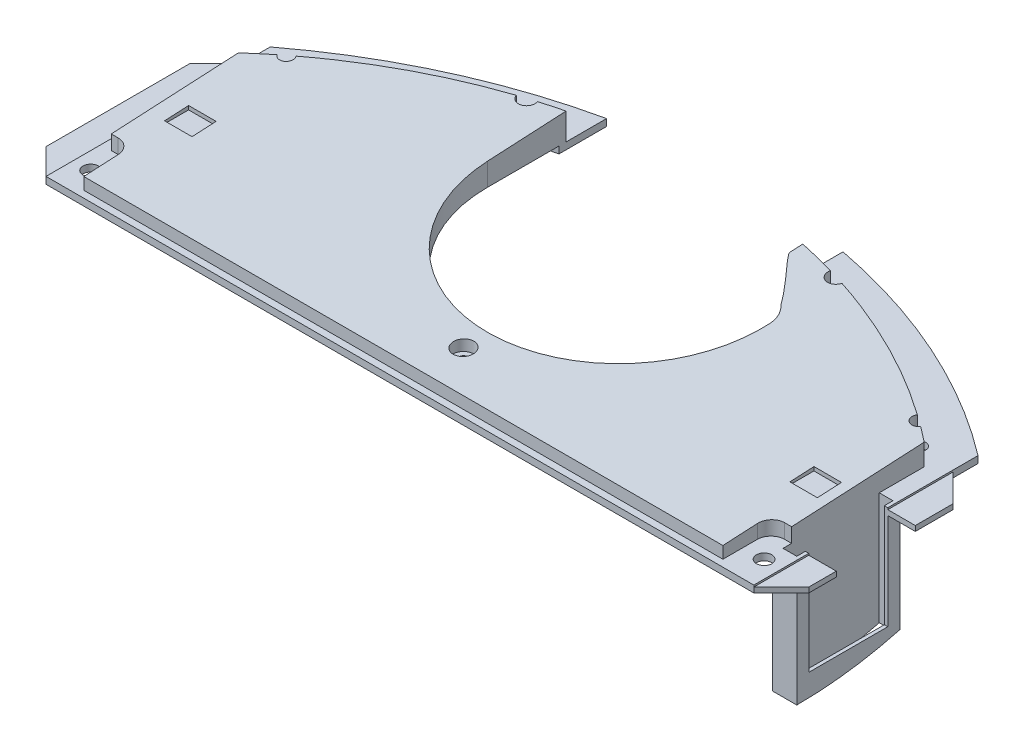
ISO-10303-21;
HEADER;
FILE_DESCRIPTION(('STEP AP214'),'2;1');
FILE_NAME('part.step','',(''),(''),'','','');
FILE_SCHEMA(('AUTOMOTIVE_DESIGN { 1 0 10303 214 1 1 1 1 }'));
ENDSEC;
DATA;
#1=APPLICATION_CONTEXT('core data for automotive mechanical design processes');
#2=APPLICATION_PROTOCOL_DEFINITION('international standard','automotive_design',2000,#1);
#3=PRODUCT_CONTEXT('',#1,'mechanical');
#4=PRODUCT('Part','Part','',(#3));
#5=PRODUCT_RELATED_PRODUCT_CATEGORY('part','',(#4));
#6=PRODUCT_DEFINITION_FORMATION('','',#4);
#7=PRODUCT_DEFINITION_CONTEXT('part definition',#1,'design');
#8=PRODUCT_DEFINITION('design','',#6,#7);
#9=PRODUCT_DEFINITION_SHAPE('','',#8);
#10=(LENGTH_UNIT() NAMED_UNIT(*) SI_UNIT(.MILLI.,.METRE.));
#11=(NAMED_UNIT(*) PLANE_ANGLE_UNIT() SI_UNIT($,.RADIAN.));
#12=(NAMED_UNIT(*) SI_UNIT($,.STERADIAN.) SOLID_ANGLE_UNIT());
#13=UNCERTAINTY_MEASURE_WITH_UNIT(LENGTH_MEASURE(1.E-05),#10,'distance_accuracy_value','');
#14=(GEOMETRIC_REPRESENTATION_CONTEXT(3) GLOBAL_UNCERTAINTY_ASSIGNED_CONTEXT((#13)) GLOBAL_UNIT_ASSIGNED_CONTEXT((#10,
#11,#12)) REPRESENTATION_CONTEXT('',''));
#15=CARTESIAN_POINT('',(0.,0.,0.));
#16=DIRECTION('',(0.,0.,1.));
#17=DIRECTION('',(1.,0.,0.));
#18=AXIS2_PLACEMENT_3D('',#15,#16,#17);
#19=CARTESIAN_POINT('',(0.,0.,0.));
#20=DIRECTION('',(0.,-1.,0.));
#21=DIRECTION('',(0.,0.,-1.));
#22=AXIS2_PLACEMENT_3D('',#19,#20,#21);
#23=PLANE('',#22);
#24=CARTESIAN_POINT('',(0.,0.,0.));
#25=DIRECTION('',(0.,-1.,0.));
#26=DIRECTION('',(0.,0.,-1.));
#27=AXIS2_PLACEMENT_3D('',#24,#25,#26);
#28=CIRCLE('',#27,156.5);
#29=CARTESIAN_POINT('',(-45.8258939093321,0.,-149.64036035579));
#30=VERTEX_POINT('',#29);
#31=CARTESIAN_POINT('',(-90.4949675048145,0.,-127.682852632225));
#32=VERTEX_POINT('',#31);
#33=EDGE_CURVE('E701',#30,#32,#28,.F.);
#34=ORIENTED_EDGE('',*,*,#33,.T.);
#35=CARTESIAN_POINT('',(-92.,0.,-129.));
#36=DIRECTION('',(0.,1.,0.));
#37=DIRECTION('',(0.,0.,-1.));
#38=AXIS2_PLACEMENT_3D('',#35,#36,#37);
#39=CIRCLE('',#38,2.);
#40=CARTESIAN_POINT('',(-91.2448851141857,0.,-127.148027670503));
#41=VERTEX_POINT('',#40);
#42=EDGE_CURVE('E687',#32,#41,#39,.T.);
#43=ORIENTED_EDGE('',*,*,#42,.T.);
#44=CARTESIAN_POINT('',(-98.,0.,-122.017416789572));
#45=VERTEX_POINT('',#44);
#46=EDGE_CURVE('E697',#41,#45,#28,.F.);
#47=ORIENTED_EDGE('',*,*,#46,.T.);
#48=DIRECTION('',(0.,0.,1.));
#49=VECTOR('',#48,1.);
#50=CARTESIAN_POINT('',(-98.,0.,0.));
#51=LINE('',#50,#49);
#52=CARTESIAN_POINT('',(-98.,0.,-88.));
#53=VERTEX_POINT('',#52);
#54=EDGE_CURVE('E729',#45,#53,#51,.T.);
#55=ORIENTED_EDGE('',*,*,#54,.T.);
#56=CARTESIAN_POINT('',(-98.,0.,-82.));
#57=DIRECTION('',(0.,-1.,0.));
#58=DIRECTION('',(0.,0.,-1.));
#59=AXIS2_PLACEMENT_3D('',#56,#57,#58);
#60=CIRCLE('',#59,6.);
#61=CARTESIAN_POINT('',(-92.,0.,-82.));
#62=VERTEX_POINT('',#61);
#63=EDGE_CURVE('E743',#62,#53,#60,.F.);
#64=ORIENTED_EDGE('',*,*,#63,.F.);
#65=DIRECTION('',(0.,0.,1.));
#66=VECTOR('',#65,1.);
#67=CARTESIAN_POINT('',(-92.0000000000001,0.,0.));
#68=LINE('',#67,#66);
#69=CARTESIAN_POINT('',(-92.,0.,-74.));
#70=VERTEX_POINT('',#69);
#71=EDGE_CURVE('E732',#62,#70,#68,.T.);
#72=ORIENTED_EDGE('',*,*,#71,.T.);
#73=DIRECTION('',(1.,0.,0.));
#74=VECTOR('',#73,1.);
#75=CARTESIAN_POINT('',(0.,0.,-74.));
#76=LINE('',#75,#74);
#77=CARTESIAN_POINT('',(3.5,0.,-74.));
#78=VERTEX_POINT('',#77);
#79=EDGE_CURVE('E754',#70,#78,#76,.T.);
#80=ORIENTED_EDGE('',*,*,#79,.T.);
#81=DIRECTION('',(-0.707106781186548,0.,-0.707106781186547));
#82=VECTOR('',#81,1.);
#83=CARTESIAN_POINT('',(0.842651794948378,0.,-76.6573482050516));
#84=LINE('',#83,#82);
#85=CARTESIAN_POINT('',(5.00000000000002,0.,-72.5));
#86=VERTEX_POINT('',#85);
#87=EDGE_CURVE('E1057',#86,#78,#84,.T.);
#88=ORIENTED_EDGE('',*,*,#87,.F.);
#89=DIRECTION('',(-0.707106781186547,0.,0.707106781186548));
#90=VECTOR('',#89,1.);
#91=CARTESIAN_POINT('',(5.00000000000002,0.,-72.5));
#92=LINE('',#91,#90);
#93=CARTESIAN_POINT('',(6.50000000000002,0.,-74.));
#94=VERTEX_POINT('',#93);
#95=EDGE_CURVE('E1060',#94,#86,#92,.T.);
#96=ORIENTED_EDGE('',*,*,#95,.F.);
#97=CARTESIAN_POINT('',(90.,0.,-74.));
#98=VERTEX_POINT('',#97);
#99=EDGE_CURVE('E736',#94,#98,#76,.T.);
#100=ORIENTED_EDGE('',*,*,#99,.T.);
#101=DIRECTION('',(0.,0.,-1.));
#102=VECTOR('',#101,1.);
#103=CARTESIAN_POINT('',(90.0000000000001,0.,0.));
#104=LINE('',#103,#102);
#105=CARTESIAN_POINT('',(90.,0.,-82.));
#106=VERTEX_POINT('',#105);
#107=EDGE_CURVE('E757',#98,#106,#104,.T.);
#108=ORIENTED_EDGE('',*,*,#107,.T.);
#109=CARTESIAN_POINT('',(96.,0.,-82.));
#110=DIRECTION('',(0.,-1.,0.));
#111=DIRECTION('',(0.,0.,-1.));
#112=AXIS2_PLACEMENT_3D('',#109,#110,#111);
#113=CIRCLE('',#112,6.);
#114=CARTESIAN_POINT('',(96.,0.,-88.));
#115=VERTEX_POINT('',#114);
#116=EDGE_CURVE('E745',#115,#106,#113,.F.);
#117=ORIENTED_EDGE('',*,*,#116,.F.);
#118=DIRECTION('',(0.,0.,-1.));
#119=VECTOR('',#118,1.);
#120=CARTESIAN_POINT('',(96.,0.,0.));
#121=LINE('',#120,#119);
#122=CARTESIAN_POINT('',(96.,0.,-82.5));
#123=VERTEX_POINT('',#122);
#124=EDGE_CURVE('E1517',#123,#115,#121,.T.);
#125=ORIENTED_EDGE('',*,*,#124,.F.);
#126=DIRECTION('',(-1.,0.,0.));
#127=VECTOR('',#126,1.);
#128=CARTESIAN_POINT('',(0.,0.,-82.5));
#129=LINE('',#128,#127);
#130=CARTESIAN_POINT('',(103.,0.,-82.5));
#131=VERTEX_POINT('',#130);
#132=EDGE_CURVE('E1510',#131,#123,#129,.T.);
#133=ORIENTED_EDGE('',*,*,#132,.F.);
#134=DIRECTION('',(0.,0.,1.));
#135=VECTOR('',#134,1.);
#136=CARTESIAN_POINT('',(103.,0.,0.));
#137=LINE('',#136,#135);
#138=CARTESIAN_POINT('',(103.,0.,-86.));
#139=VERTEX_POINT('',#138);
#140=EDGE_CURVE('E1513',#139,#131,#137,.T.);
#141=ORIENTED_EDGE('',*,*,#140,.F.);
#142=DIRECTION('',(-1.,0.,0.));
#143=VECTOR('',#142,1.);
#144=CARTESIAN_POINT('',(0.,0.,-86.));
#145=LINE('',#144,#143);
#146=CARTESIAN_POINT('',(111.,0.,-86.));
#147=VERTEX_POINT('',#146);
#148=EDGE_CURVE('E1459',#147,#139,#145,.T.);
#149=ORIENTED_EDGE('',*,*,#148,.F.);
#150=DIRECTION('',(0.,0.,1.));
#151=VECTOR('',#150,1.);
#152=CARTESIAN_POINT('',(111.,0.,-78.0000000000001));
#153=LINE('',#152,#151);
#154=CARTESIAN_POINT('',(111.,0.,-78.0000000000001));
#155=VERTEX_POINT('',#154);
#156=EDGE_CURVE('E1046',#147,#155,#153,.T.);
#157=ORIENTED_EDGE('',*,*,#156,.T.);
#158=DIRECTION('',(-0.707106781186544,0.,0.707106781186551));
#159=VECTOR('',#158,1.);
#160=CARTESIAN_POINT('',(103.,0.,-70.));
#161=LINE('',#160,#159);
#162=CARTESIAN_POINT('',(103.,0.,-70.));
#163=VERTEX_POINT('',#162);
#164=EDGE_CURVE('E978',#155,#163,#161,.T.);
#165=ORIENTED_EDGE('',*,*,#164,.T.);
#166=DIRECTION('',(-1.,0.,0.));
#167=VECTOR('',#166,1.);
#168=CARTESIAN_POINT('',(103.,0.,-70.));
#169=LINE('',#168,#167);
#170=CARTESIAN_POINT('',(-103.,0.,-70.));
#171=VERTEX_POINT('',#170);
#172=EDGE_CURVE('E1008',#163,#171,#169,.T.);
#173=ORIENTED_EDGE('',*,*,#172,.T.);
#174=DIRECTION('',(0.707106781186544,0.,0.707106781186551));
#175=VECTOR('',#174,1.);
#176=CARTESIAN_POINT('',(-103.,0.,-70.));
#177=LINE('',#176,#175);
#178=CARTESIAN_POINT('',(-111.,0.,-78.0000000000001));
#179=VERTEX_POINT('',#178);
#180=EDGE_CURVE('E1520',#179,#171,#177,.T.);
#181=ORIENTED_EDGE('',*,*,#180,.F.);
#182=DIRECTION('',(0.,0.,1.));
#183=VECTOR('',#182,1.);
#184=CARTESIAN_POINT('',(-111.,0.,-78.0000000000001));
#185=LINE('',#184,#183);
#186=CARTESIAN_POINT('',(-111.,0.,-120.));
#187=VERTEX_POINT('',#186);
#188=EDGE_CURVE('E1523',#187,#179,#185,.T.);
#189=ORIENTED_EDGE('',*,*,#188,.F.);
#190=DIRECTION('',(-0.707106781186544,0.,0.707106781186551));
#191=VECTOR('',#190,1.);
#192=CARTESIAN_POINT('',(-111.,0.,-120.));
#193=LINE('',#192,#191);
#194=CARTESIAN_POINT('',(-103.,0.,-128.));
#195=VERTEX_POINT('',#194);
#196=EDGE_CURVE('E1525',#195,#187,#193,.T.);
#197=ORIENTED_EDGE('',*,*,#196,.F.);
#198=DIRECTION('',(0.,0.,-1.));
#199=VECTOR('',#198,1.);
#200=CARTESIAN_POINT('',(-103.,0.,-135.244223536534));
#201=LINE('',#200,#199);
#202=CARTESIAN_POINT('',(-103.,0.,-135.244223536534));
#203=VERTEX_POINT('',#202);
#204=EDGE_CURVE('E1004',#195,#203,#201,.T.);
#205=ORIENTED_EDGE('',*,*,#204,.T.);
#206=CARTESIAN_POINT('',(0.,0.,0.));
#207=DIRECTION('',(0.,-1.,0.));
#208=DIRECTION('',(0.,0.,-1.));
#209=AXIS2_PLACEMENT_3D('',#206,#207,#208);
#210=CIRCLE('',#209,170.);
#211=CARTESIAN_POINT('',(-36.,0.,-166.144515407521));
#212=VERTEX_POINT('',#211);
#213=EDGE_CURVE('E1560',#203,#212,#210,.T.);
#214=ORIENTED_EDGE('',*,*,#213,.T.);
#215=DIRECTION('',(0.,0.,-1.));
#216=VECTOR('',#215,1.);
#217=CARTESIAN_POINT('',(-36.,0.,-131.5));
#218=LINE('',#217,#216);
#219=CARTESIAN_POINT('',(-36.,0.,-152.303151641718));
#220=VERTEX_POINT('',#219);
#221=EDGE_CURVE('E820',#220,#212,#218,.T.);
#222=ORIENTED_EDGE('',*,*,#221,.F.);
#223=CARTESIAN_POINT('',(-43.0226476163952,0.,-150.470268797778));
#224=VERTEX_POINT('',#223);
#225=EDGE_CURVE('E709',#220,#224,#28,.F.);
#226=ORIENTED_EDGE('',*,*,#225,.T.);
#227=CARTESIAN_POINT('',(-45.,0.,-152.));
#228=DIRECTION('',(0.,1.,0.));
#229=DIRECTION('',(0.,0.,-1.));
#230=AXIS2_PLACEMENT_3D('',#227,#228,#229);
#231=CIRCLE('',#230,2.5);
#232=EDGE_CURVE('E1812',#224,#30,#231,.T.);
#233=ORIENTED_EDGE('',*,*,#232,.T.);
#234=EDGE_LOOP('',(#34,#43,#47,#55,#64,#72,#80,#88,#96,#100,#108,#117,#125,#133,#141,#149,#157,
#165,#173,#181,#189,#197,#205,#214,#222,#226,#233));
#235=FACE_BOUND('',#234,.T.);
#236=CARTESIAN_POINT('',(98.,0.,-78.));
#237=DIRECTION('',(0.,-1.,0.));
#238=DIRECTION('',(0.,0.,-1.));
#239=AXIS2_PLACEMENT_3D('',#236,#237,#238);
#240=CIRCLE('',#239,2.25);
#241=CARTESIAN_POINT('',(98.,0.,-80.25));
#242=VERTEX_POINT('',#241);
#243=EDGE_CURVE('E1804',#242,#242,#240,.T.);
#244=ORIENTED_EDGE('',*,*,#243,.F.);
#245=EDGE_LOOP('',(#244));
#246=FACE_BOUND('',#245,.T.);
#247=CARTESIAN_POINT('',(-98.,0.,-78.));
#248=DIRECTION('',(0.,1.,0.));
#249=DIRECTION('',(0.,0.,-1.));
#250=AXIS2_PLACEMENT_3D('',#247,#248,#249);
#251=CIRCLE('',#250,2.25);
#252=CARTESIAN_POINT('',(-98.,0.,-80.25));
#253=VERTEX_POINT('',#252);
#254=EDGE_CURVE('E2126',#253,#253,#251,.T.);
#255=ORIENTED_EDGE('',*,*,#254,.T.);
#256=EDGE_LOOP('',(#255));
#257=FACE_BOUND('',#256,.T.);
#258=ADVANCED_FACE('F34',(#235,#246,#257),#23,.T.);
#259=CARTESIAN_POINT('',(0.,2.,0.));
#260=DIRECTION('',(0.,-1.,0.));
#261=DIRECTION('',(0.,0.,-1.));
#262=AXIS2_PLACEMENT_3D('',#259,#260,#261);
#263=PLANE('',#262);
#264=CARTESIAN_POINT('',(-92.,2.,-129.));
#265=DIRECTION('',(0.,-1.,0.));
#266=DIRECTION('',(0.,0.,-1.));
#267=AXIS2_PLACEMENT_3D('',#264,#265,#266);
#268=CIRCLE('',#267,2.);
#269=CARTESIAN_POINT('',(-90.3963145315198,2.,-130.195070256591));
#270=VERTEX_POINT('',#269);
#271=CARTESIAN_POINT('',(-93.6522415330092,2.,-127.873013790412));
#272=VERTEX_POINT('',#271);
#273=EDGE_CURVE('E2121',#270,#272,#268,.F.);
#274=ORIENTED_EDGE('',*,*,#273,.F.);
#275=CARTESIAN_POINT('',(0.,2.,0.));
#276=DIRECTION('',(0.,1.,0.));
#277=DIRECTION('',(0.,0.,1.));
#278=AXIS2_PLACEMENT_3D('',#275,#276,#277);
#279=CIRCLE('',#278,158.5);
#280=CARTESIAN_POINT('',(-47.3851919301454,2.,-151.251094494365));
#281=VERTEX_POINT('',#280);
#282=EDGE_CURVE('E1952',#281,#270,#279,.T.);
#283=ORIENTED_EDGE('',*,*,#282,.F.);
#284=CARTESIAN_POINT('',(-45.,2.,-152.));
#285=DIRECTION('',(0.,-1.,0.));
#286=DIRECTION('',(0.,0.,-1.));
#287=AXIS2_PLACEMENT_3D('',#284,#285,#286);
#288=CIRCLE('',#287,2.5);
#289=CARTESIAN_POINT('',(-42.591528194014,2.,-152.670271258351));
#290=VERTEX_POINT('',#289);
#291=EDGE_CURVE('E1815',#290,#281,#288,.F.);
#292=ORIENTED_EDGE('',*,*,#291,.F.);
#293=CARTESIAN_POINT('',(-36.,2.,-154.3575394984));
#294=VERTEX_POINT('',#293);
#295=EDGE_CURVE('E1607',#294,#290,#279,.T.);
#296=ORIENTED_EDGE('',*,*,#295,.F.);
#297=DIRECTION('',(0.,0.,-1.));
#298=VECTOR('',#297,1.);
#299=CARTESIAN_POINT('',(-35.9999999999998,2.,0.));
#300=LINE('',#299,#298);
#301=CARTESIAN_POINT('',(-36.,2.,-166.144515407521));
#302=VERTEX_POINT('',#301);
#303=EDGE_CURVE('E1724',#294,#302,#300,.T.);
#304=ORIENTED_EDGE('',*,*,#303,.T.);
#305=CARTESIAN_POINT('',(0.,2.,0.));
#306=DIRECTION('',(0.,-1.,0.));
#307=DIRECTION('',(0.,0.,-1.));
#308=AXIS2_PLACEMENT_3D('',#305,#306,#307);
#309=CIRCLE('',#308,170.);
#310=CARTESIAN_POINT('',(-103.,2.,-135.244223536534));
#311=VERTEX_POINT('',#310);
#312=EDGE_CURVE('E1016',#311,#302,#309,.T.);
#313=ORIENTED_EDGE('',*,*,#312,.F.);
#314=DIRECTION('',(0.,0.,-1.));
#315=VECTOR('',#314,1.);
#316=CARTESIAN_POINT('',(-103.,2.,-135.244223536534));
#317=LINE('',#316,#315);
#318=CARTESIAN_POINT('',(-103.,2.,-70.));
#319=VERTEX_POINT('',#318);
#320=EDGE_CURVE('E1024',#319,#311,#317,.T.);
#321=ORIENTED_EDGE('',*,*,#320,.F.);
#322=DIRECTION('',(-1.,0.,0.));
#323=VECTOR('',#322,1.);
#324=CARTESIAN_POINT('',(103.,2.,-70.));
#325=LINE('',#324,#323);
#326=CARTESIAN_POINT('',(103.,2.,-70.));
#327=VERTEX_POINT('',#326);
#328=EDGE_CURVE('E1021',#327,#319,#325,.T.);
#329=ORIENTED_EDGE('',*,*,#328,.F.);
#330=DIRECTION('',(0.,0.,1.));
#331=VECTOR('',#330,1.);
#332=CARTESIAN_POINT('',(103.,2.,-135.244223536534));
#333=LINE('',#332,#331);
#334=CARTESIAN_POINT('',(103.,2.,-86.));
#335=VERTEX_POINT('',#334);
#336=EDGE_CURVE('E1019',#335,#327,#333,.T.);
#337=ORIENTED_EDGE('',*,*,#336,.F.);
#338=DIRECTION('',(-1.,0.,0.));
#339=VECTOR('',#338,1.);
#340=CARTESIAN_POINT('',(111.000025,2.,-86.));
#341=LINE('',#340,#339);
#342=CARTESIAN_POINT('',(102.,2.,-86.));
#343=VERTEX_POINT('',#342);
#344=EDGE_CURVE('E1449',#335,#343,#341,.T.);
#345=ORIENTED_EDGE('',*,*,#344,.T.);
#346=DIRECTION('',(0.,0.,-1.));
#347=VECTOR('',#346,1.);
#348=CARTESIAN_POINT('',(102.,2.,-83.5));
#349=LINE('',#348,#347);
#350=CARTESIAN_POINT('',(102.,2.,-83.5));
#351=VERTEX_POINT('',#350);
#352=EDGE_CURVE('E1483',#351,#343,#349,.T.);
#353=ORIENTED_EDGE('',*,*,#352,.F.);
#354=DIRECTION('',(1.,0.,0.));
#355=VECTOR('',#354,1.);
#356=CARTESIAN_POINT('',(98.,2.,-83.5));
#357=LINE('',#356,#355);
#358=CARTESIAN_POINT('',(98.,2.,-83.5));
#359=VERTEX_POINT('',#358);
#360=EDGE_CURVE('E1479',#359,#351,#357,.T.);
#361=ORIENTED_EDGE('',*,*,#360,.F.);
#362=DIRECTION('',(0.,0.,1.));
#363=VECTOR('',#362,1.);
#364=CARTESIAN_POINT('',(98.,2.,-111.5));
#365=LINE('',#364,#363);
#366=CARTESIAN_POINT('',(98.,2.,-86.));
#367=VERTEX_POINT('',#366);
#368=EDGE_CURVE('E1476',#367,#359,#365,.T.);
#369=ORIENTED_EDGE('',*,*,#368,.F.);
#370=DIRECTION('',(1.,0.,0.));
#371=VECTOR('',#370,1.);
#372=CARTESIAN_POINT('',(98.,2.,-86.));
#373=LINE('',#372,#371);
#374=CARTESIAN_POINT('',(96.,2.,-86.));
#375=VERTEX_POINT('',#374);
#376=EDGE_CURVE('E1584',#375,#367,#373,.T.);
#377=ORIENTED_EDGE('',*,*,#376,.F.);
#378=CARTESIAN_POINT('',(96.,2.,-82.));
#379=DIRECTION('',(0.,-1.,0.));
#380=DIRECTION('',(0.,0.,-1.));
#381=AXIS2_PLACEMENT_3D('',#378,#379,#380);
#382=CIRCLE('',#381,4.);
#383=CARTESIAN_POINT('',(92.,2.,-82.));
#384=VERTEX_POINT('',#383);
#385=EDGE_CURVE('E2765',#375,#384,#382,.F.);
#386=ORIENTED_EDGE('',*,*,#385,.T.);
#387=DIRECTION('',(0.,0.,-1.));
#388=VECTOR('',#387,1.);
#389=CARTESIAN_POINT('',(92.,2.,-86.));
#390=LINE('',#389,#388);
#391=CARTESIAN_POINT('',(92.,2.,-72.));
#392=VERTEX_POINT('',#391);
#393=EDGE_CURVE('E1587',#392,#384,#390,.T.);
#394=ORIENTED_EDGE('',*,*,#393,.F.);
#395=DIRECTION('',(1.,0.,0.));
#396=VECTOR('',#395,1.);
#397=CARTESIAN_POINT('',(-94.,2.,-72.));
#398=LINE('',#397,#396);
#399=CARTESIAN_POINT('',(-94.,2.,-72.));
#400=VERTEX_POINT('',#399);
#401=EDGE_CURVE('E1590',#400,#392,#398,.T.);
#402=ORIENTED_EDGE('',*,*,#401,.F.);
#403=DIRECTION('',(0.,0.,1.));
#404=VECTOR('',#403,1.);
#405=CARTESIAN_POINT('',(-94.,2.,-86.));
#406=LINE('',#405,#404);
#407=CARTESIAN_POINT('',(-94.,2.,-82.));
#408=VERTEX_POINT('',#407);
#409=EDGE_CURVE('E1593',#408,#400,#406,.T.);
#410=ORIENTED_EDGE('',*,*,#409,.F.);
#411=CARTESIAN_POINT('',(-98.,2.,-82.));
#412=DIRECTION('',(0.,-1.,0.));
#413=DIRECTION('',(0.,0.,-1.));
#414=AXIS2_PLACEMENT_3D('',#411,#412,#413);
#415=CIRCLE('',#414,4.);
#416=CARTESIAN_POINT('',(-98.,2.,-86.));
#417=VERTEX_POINT('',#416);
#418=EDGE_CURVE('E2767',#408,#417,#415,.F.);
#419=ORIENTED_EDGE('',*,*,#418,.T.);
#420=DIRECTION('',(1.,0.,0.));
#421=VECTOR('',#420,1.);
#422=CARTESIAN_POINT('',(-100.,2.,-86.));
#423=LINE('',#422,#421);
#424=CARTESIAN_POINT('',(-100.,2.,-86.));
#425=VERTEX_POINT('',#424);
#426=EDGE_CURVE('E1596',#425,#417,#423,.T.);
#427=ORIENTED_EDGE('',*,*,#426,.F.);
#428=DIRECTION('',(0.,0.,1.));
#429=VECTOR('',#428,1.);
#430=CARTESIAN_POINT('',(-100.,2.,-122.972557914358));
#431=LINE('',#430,#429);
#432=CARTESIAN_POINT('',(-100.,2.,-122.972557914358));
#433=VERTEX_POINT('',#432);
#434=EDGE_CURVE('E1599',#433,#425,#431,.T.);
#435=ORIENTED_EDGE('',*,*,#434,.F.);
#436=EDGE_CURVE('E1606',#272,#433,#279,.T.);
#437=ORIENTED_EDGE('',*,*,#436,.F.);
#438=EDGE_LOOP('',(#274,#283,#292,#296,#304,#313,#321,#329,#337,#345,#353,#361,#369,#377,#386,
#394,#402,#410,#419,#427,#435,#437));
#439=FACE_BOUND('',#438,.T.);
#440=CARTESIAN_POINT('',(98.,2.,-78.));
#441=DIRECTION('',(0.,-1.,0.));
#442=DIRECTION('',(0.,0.,-1.));
#443=AXIS2_PLACEMENT_3D('',#440,#441,#442);
#444=CIRCLE('',#443,2.25);
#445=CARTESIAN_POINT('',(98.,2.,-80.25));
#446=VERTEX_POINT('',#445);
#447=EDGE_CURVE('E1802',#446,#446,#444,.T.);
#448=ORIENTED_EDGE('',*,*,#447,.T.);
#449=EDGE_LOOP('',(#448));
#450=FACE_BOUND('',#449,.T.);
#451=CARTESIAN_POINT('',(-98.,2.,-78.));
#452=DIRECTION('',(0.,-1.,0.));
#453=DIRECTION('',(0.,0.,-1.));
#454=AXIS2_PLACEMENT_3D('',#451,#452,#453);
#455=CIRCLE('',#454,2.25);
#456=CARTESIAN_POINT('',(-98.,2.,-80.25));
#457=VERTEX_POINT('',#456);
#458=EDGE_CURVE('E38',#457,#457,#455,.F.);
#459=ORIENTED_EDGE('',*,*,#458,.F.);
#460=EDGE_LOOP('',(#459));
#461=FACE_BOUND('',#460,.T.);
#462=ADVANCED_FACE('F864',(#439,#450,#461),#263,.F.);
#463=CARTESIAN_POINT('',(415.259162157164,5.46672709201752,-72.));
#464=DIRECTION('',(0.,0.998629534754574,0.0523359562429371));
#465=DIRECTION('',(0.,-0.0523359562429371,0.998629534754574));
#466=AXIS2_PLACEMENT_3D('',#463,#464,#465);
#467=PLANE('',#466);
#468=CARTESIAN_POINT('',(4.99999999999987,6.06941655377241,-83.5));
#469=DIRECTION('',(0.,0.998629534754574,0.0523359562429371));
#470=DIRECTION('',(0.,-0.0523359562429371,0.998629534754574));
#471=AXIS2_PLACEMENT_3D('',#468,#469,#470);
#472=ELLIPSE('',#471,3.00411703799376,3.);
#473=CARTESIAN_POINT('',(4.99999999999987,5.91219321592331,-80.5));
#474=VERTEX_POINT('',#473);
#475=EDGE_CURVE('E1077',#474,#474,#472,.T.);
#476=ORIENTED_EDGE('',*,*,#475,.F.);
#477=EDGE_LOOP('',(#476));
#478=FACE_BOUND('',#477,.T.);
#479=DIRECTION('',(0.,-0.0523359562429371,0.998629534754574));
#480=VECTOR('',#479,1.);
#481=CARTESIAN_POINT('',(87.,5.46672709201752,-72.));
#482=LINE('',#481,#480);
#483=CARTESIAN_POINT('',(87.,7.1175721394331,-103.5));
#484=VERTEX_POINT('',#483);
#485=CARTESIAN_POINT('',(87.,6.75071768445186,-96.5));
#486=VERTEX_POINT('',#485);
#487=EDGE_CURVE('E2735',#484,#486,#482,.T.);
#488=ORIENTED_EDGE('',*,*,#487,.F.);
#489=DIRECTION('',(-1.,0.,0.));
#490=VECTOR('',#489,1.);
#491=CARTESIAN_POINT('',(415.259162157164,7.1175721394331,-103.5));
#492=LINE('',#491,#490);
#493=CARTESIAN_POINT('',(95.,7.1175721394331,-103.5));
#494=VERTEX_POINT('',#493);
#495=EDGE_CURVE('E2724',#494,#484,#492,.T.);
#496=ORIENTED_EDGE('',*,*,#495,.F.);
#497=DIRECTION('',(0.,0.0523359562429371,-0.998629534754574));
#498=VECTOR('',#497,1.);
#499=CARTESIAN_POINT('',(95.,5.46672709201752,-72.));
#500=LINE('',#499,#498);
#501=CARTESIAN_POINT('',(95.,6.75071768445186,-96.5));
#502=VERTEX_POINT('',#501);
#503=EDGE_CURVE('E2730',#502,#494,#500,.T.);
#504=ORIENTED_EDGE('',*,*,#503,.F.);
#505=DIRECTION('',(1.,0.,0.));
#506=VECTOR('',#505,1.);
#507=CARTESIAN_POINT('',(415.259162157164,6.75071768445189,-96.5000000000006));
#508=LINE('',#507,#506);
#509=EDGE_CURVE('E2733',#486,#502,#508,.T.);
#510=ORIENTED_EDGE('',*,*,#509,.F.);
#511=EDGE_LOOP('',(#488,#496,#504,#510));
#512=FACE_BOUND('',#511,.T.);
#513=DIRECTION('',(1.,0.,0.));
#514=VECTOR('',#513,1.);
#515=CARTESIAN_POINT('',(415.259162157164,7.1175721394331,-103.5));
#516=LINE('',#515,#514);
#517=CARTESIAN_POINT('',(-95.,7.1175721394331,-103.5));
#518=VERTEX_POINT('',#517);
#519=CARTESIAN_POINT('',(-87.,7.1175721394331,-103.5));
#520=VERTEX_POINT('',#519);
#521=EDGE_CURVE('E2710',#518,#520,#516,.T.);
#522=ORIENTED_EDGE('',*,*,#521,.T.);
#523=DIRECTION('',(0.,-0.0523359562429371,0.998629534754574));
#524=VECTOR('',#523,1.);
#525=CARTESIAN_POINT('',(-87.,5.46672709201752,-72.));
#526=LINE('',#525,#524);
#527=CARTESIAN_POINT('',(-87.,6.75071768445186,-96.5));
#528=VERTEX_POINT('',#527);
#529=EDGE_CURVE('E2721',#520,#528,#526,.T.);
#530=ORIENTED_EDGE('',*,*,#529,.T.);
#531=DIRECTION('',(-1.,0.,0.));
#532=VECTOR('',#531,1.);
#533=CARTESIAN_POINT('',(415.259162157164,6.75071768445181,-96.4999999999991));
#534=LINE('',#533,#532);
#535=CARTESIAN_POINT('',(-95.,6.75071768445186,-96.5));
#536=VERTEX_POINT('',#535);
#537=EDGE_CURVE('E2718',#528,#536,#534,.T.);
#538=ORIENTED_EDGE('',*,*,#537,.T.);
#539=DIRECTION('',(0.,0.0523359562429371,-0.998629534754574));
#540=VECTOR('',#539,1.);
#541=CARTESIAN_POINT('',(-95.,5.46672709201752,-72.));
#542=LINE('',#541,#540);
#543=EDGE_CURVE('E2716',#536,#518,#542,.T.);
#544=ORIENTED_EDGE('',*,*,#543,.T.);
#545=EDGE_LOOP('',(#522,#530,#538,#544));
#546=FACE_BOUND('',#545,.T.);
#547=CARTESIAN_POINT('',(0.,1.69336698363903,0.));
#548=DIRECTION('',(0.,0.998629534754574,0.0523359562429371));
#549=DIRECTION('',(0.,-0.0523359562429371,0.998629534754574));
#550=AXIS2_PLACEMENT_3D('',#547,#548,#549);
#551=ELLIPSE('',#550,158.71751684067,158.5);
#552=CARTESIAN_POINT('',(-47.3851919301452,9.6201009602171,-151.251094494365));
#553=VERTEX_POINT('',#552);
#554=CARTESIAN_POINT('',(-90.3963145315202,8.51660148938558,-130.19507025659));
#555=VERTEX_POINT('',#554);
#556=EDGE_CURVE('E1940',#553,#555,#551,.T.);
#557=ORIENTED_EDGE('',*,*,#556,.T.);
#558=CARTESIAN_POINT('',(-92.,8.45397051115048,-129.));
#559=DIRECTION('',(0.,0.998629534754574,0.0523359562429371));
#560=DIRECTION('',(0.,-0.0523359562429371,0.998629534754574));
#561=AXIS2_PLACEMENT_3D('',#558,#559,#560);
#562=ELLIPSE('',#561,2.00274469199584,2.);
#563=CARTESIAN_POINT('',(-93.6522415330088,8.39490766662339,-127.873013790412));
#564=VERTEX_POINT('',#563);
#565=EDGE_CURVE('E1819',#555,#564,#562,.F.);
#566=ORIENTED_EDGE('',*,*,#565,.T.);
#567=CARTESIAN_POINT('',(-100.,8.13808565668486,-122.972557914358));
#568=VERTEX_POINT('',#567);
#569=EDGE_CURVE('E1624',#564,#568,#551,.T.);
#570=ORIENTED_EDGE('',*,*,#569,.T.);
#571=DIRECTION('',(0.,-0.0523359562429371,0.998629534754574));
#572=VECTOR('',#571,1.);
#573=CARTESIAN_POINT('',(-100.,8.14318553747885,-123.069869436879));
#574=LINE('',#573,#572);
#575=CARTESIAN_POINT('',(-100.,6.20043600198,-86.));
#576=VERTEX_POINT('',#575);
#577=EDGE_CURVE('E1626',#568,#576,#574,.T.);
#578=ORIENTED_EDGE('',*,*,#577,.T.);
#579=DIRECTION('',(1.,0.,0.));
#580=VECTOR('',#579,1.);
#581=CARTESIAN_POINT('',(-100.,6.20043600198,-86.));
#582=LINE('',#581,#580);
#583=CARTESIAN_POINT('',(-98.,6.20043600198,-86.));
#584=VERTEX_POINT('',#583);
#585=EDGE_CURVE('E1629',#576,#584,#582,.T.);
#586=ORIENTED_EDGE('',*,*,#585,.T.);
#587=CARTESIAN_POINT('',(-98.,5.99080488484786,-82.));
#588=DIRECTION('',(0.,0.998629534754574,0.0523359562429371));
#589=DIRECTION('',(0.,0.0523359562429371,-0.998629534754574));
#590=AXIS2_PLACEMENT_3D('',#587,#588,#589);
#591=ELLIPSE('',#590,4.00548938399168,4.);
#592=CARTESIAN_POINT('',(-94.,5.99080488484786,-82.));
#593=VERTEX_POINT('',#592);
#594=EDGE_CURVE('E2754',#584,#593,#591,.F.);
#595=ORIENTED_EDGE('',*,*,#594,.T.);
#596=DIRECTION('',(0.,-0.0523359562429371,0.998629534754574));
#597=VECTOR('',#596,1.);
#598=CARTESIAN_POINT('',(-94.,6.21084320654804,-86.1985812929));
#599=LINE('',#598,#597);
#600=CARTESIAN_POINT('',(-94.,5.46672709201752,-72.));
#601=VERTEX_POINT('',#600);
#602=EDGE_CURVE('E1632',#593,#601,#599,.T.);
#603=ORIENTED_EDGE('',*,*,#602,.T.);
#604=DIRECTION('',(-1.,0.,0.));
#605=VECTOR('',#604,1.);
#606=CARTESIAN_POINT('',(415.259162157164,5.46672709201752,-72.));
#607=LINE('',#606,#605);
#608=CARTESIAN_POINT('',(92.,5.46672709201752,-72.));
#609=VERTEX_POINT('',#608);
#610=EDGE_CURVE('E1635',#609,#601,#607,.T.);
#611=ORIENTED_EDGE('',*,*,#610,.F.);
#612=DIRECTION('',(0.,0.0523359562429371,-0.998629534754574));
#613=VECTOR('',#612,1.);
#614=CARTESIAN_POINT('',(92.,6.21084320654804,-86.1985812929));
#615=LINE('',#614,#613);
#616=CARTESIAN_POINT('',(92.,5.99080488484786,-82.));
#617=VERTEX_POINT('',#616);
#618=EDGE_CURVE('E1608',#609,#617,#615,.T.);
#619=ORIENTED_EDGE('',*,*,#618,.T.);
#620=CARTESIAN_POINT('',(96.,5.99080488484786,-82.));
#621=DIRECTION('',(0.,0.998629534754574,0.0523359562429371));
#622=DIRECTION('',(0.,0.0523359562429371,-0.998629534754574));
#623=AXIS2_PLACEMENT_3D('',#620,#621,#622);
#624=ELLIPSE('',#623,4.00548938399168,4.);
#625=CARTESIAN_POINT('',(96.,6.20043600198,-86.));
#626=VERTEX_POINT('',#625);
#627=EDGE_CURVE('E1611',#617,#626,#624,.F.);
#628=ORIENTED_EDGE('',*,*,#627,.T.);
#629=DIRECTION('',(1.,0.,0.));
#630=VECTOR('',#629,1.);
#631=CARTESIAN_POINT('',(98.,6.20043600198,-86.));
#632=LINE('',#631,#630);
#633=CARTESIAN_POINT('',(98.,6.20043600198,-86.));
#634=VERTEX_POINT('',#633);
#635=EDGE_CURVE('E1614',#626,#634,#632,.T.);
#636=ORIENTED_EDGE('',*,*,#635,.T.);
#637=DIRECTION('',(0.,0.0523359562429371,-0.998629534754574));
#638=VECTOR('',#637,1.);
#639=CARTESIAN_POINT('',(98.,6.21084320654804,-86.1985812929));
#640=LINE('',#639,#638);
#641=CARTESIAN_POINT('',(98.,8.22192291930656,-124.572268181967));
#642=VERTEX_POINT('',#641);
#643=EDGE_CURVE('E1617',#634,#642,#640,.T.);
#644=ORIENTED_EDGE('',*,*,#643,.T.);
#645=CARTESIAN_POINT('',(93.6522415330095,8.39490766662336,-127.873013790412));
#646=VERTEX_POINT('',#645);
#647=EDGE_CURVE('E1620',#642,#646,#551,.T.);
#648=ORIENTED_EDGE('',*,*,#647,.T.);
#649=CARTESIAN_POINT('',(92.,8.45397051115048,-129.));
#650=DIRECTION('',(0.,0.998629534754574,0.0523359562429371));
#651=DIRECTION('',(0.,-0.0523359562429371,0.998629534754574));
#652=AXIS2_PLACEMENT_3D('',#649,#650,#651);
#653=ELLIPSE('',#652,2.00274469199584,2.);
#654=CARTESIAN_POINT('',(90.3963145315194,8.51660148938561,-130.195070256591));
#655=VERTEX_POINT('',#654);
#656=EDGE_CURVE('E1386',#655,#646,#653,.T.);
#657=ORIENTED_EDGE('',*,*,#656,.F.);
#658=CARTESIAN_POINT('',(47.3851919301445,9.62010096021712,-151.251094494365));
#659=VERTEX_POINT('',#658);
#660=EDGE_CURVE('E1623',#655,#659,#551,.T.);
#661=ORIENTED_EDGE('',*,*,#660,.T.);
#662=CARTESIAN_POINT('',(45.,9.65934943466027,-152.));
#663=DIRECTION('',(0.,0.998629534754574,0.0523359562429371));
#664=DIRECTION('',(0.,-0.0523359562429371,0.998629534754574));
#665=AXIS2_PLACEMENT_3D('',#662,#663,#664);
#666=ELLIPSE('',#665,2.5034308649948,2.5);
#667=CARTESIAN_POINT('',(42.5915281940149,9.69447686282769,-152.670271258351));
#668=VERTEX_POINT('',#667);
#669=EDGE_CURVE('E1411',#668,#659,#666,.T.);
#670=ORIENTED_EDGE('',*,*,#669,.F.);
#671=CARTESIAN_POINT('',(32.,9.82894679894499,-155.236110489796));
#672=VERTEX_POINT('',#671);
#673=EDGE_CURVE('E1699',#668,#672,#551,.T.);
#674=ORIENTED_EDGE('',*,*,#673,.T.);
#675=DIRECTION('',(0.,0.0523359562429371,-0.998629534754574));
#676=VECTOR('',#675,1.);
#677=CARTESIAN_POINT('',(32.,5.46672709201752,-72.));
#678=LINE('',#677,#676);
#679=CARTESIAN_POINT('',(32.,9.63444750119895,-151.524842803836));
#680=VERTEX_POINT('',#679);
#681=EDGE_CURVE('E853',#680,#672,#678,.T.);
#682=ORIENTED_EDGE('',*,*,#681,.F.);
#683=CARTESIAN_POINT('',(43.3430808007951,8.90073859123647,-137.524842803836));
#684=CARTESIAN_POINT('',(43.2538810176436,8.90753680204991,-137.654560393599));
#685=CARTESIAN_POINT('',(43.1638614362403,8.91430535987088,-137.78371217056));
#686=CARTESIAN_POINT('',(42.982334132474,8.92778734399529,-138.040963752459));
#687=CARTESIAN_POINT('',(42.8908264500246,8.93450077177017,-138.169063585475));
#688=CARTESIAN_POINT('',(42.614316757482,8.95456330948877,-138.551879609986));
#689=CARTESIAN_POINT('',(42.4273032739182,8.96783655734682,-138.805148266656));
#690=CARTESIAN_POINT('',(42.0489471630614,8.99420227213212,-139.308236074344));
#691=CARTESIAN_POINT('',(41.8576066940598,9.00729482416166,-139.558056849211));
#692=CARTESIAN_POINT('',(41.4712168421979,9.0333297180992,-140.054832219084));
#693=CARTESIAN_POINT('',(41.2761673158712,9.04627205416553,-140.301786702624));
#694=CARTESIAN_POINT('',(40.6867874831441,9.08487590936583,-141.038392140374));
#695=CARTESIAN_POINT('',(40.2878089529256,9.11034304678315,-141.524334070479));
#696=CARTESIAN_POINT('',(39.4809657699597,9.160892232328,-142.488869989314));
#697=CARTESIAN_POINT('',(39.0730999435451,9.18597422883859,-142.967462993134));
#698=CARTESIAN_POINT('',(38.3769956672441,9.22822587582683,-143.773672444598));
#699=CARTESIAN_POINT('',(38.0903505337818,9.24546764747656,-144.102665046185));
#700=CARTESIAN_POINT('',(37.5149373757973,9.27985234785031,-144.758764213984));
#701=CARTESIAN_POINT('',(37.2261694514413,9.29699528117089,-145.085870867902));
#702=CARTESIAN_POINT('',(36.647368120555,9.33122192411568,-145.738954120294));
#703=CARTESIAN_POINT('',(36.3573347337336,9.34830563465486,-146.064930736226));
#704=CARTESIAN_POINT('',(35.7770073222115,9.38246115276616,-146.716656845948));
#705=CARTESIAN_POINT('',(35.4867132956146,9.39953296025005,-147.042406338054));
#706=CARTESIAN_POINT('',(35.0526420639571,9.42515462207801,-147.53129676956));
#707=CARTESIAN_POINT('',(34.9084145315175,9.43368355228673,-147.694038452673));
#708=CARTESIAN_POINT('',(34.6205253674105,9.45076753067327,-148.020020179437));
#709=CARTESIAN_POINT('',(34.4768637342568,9.45932257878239,-148.183260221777));
#710=CARTESIAN_POINT('',(34.1903937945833,9.47647910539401,-148.51062625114));
#711=CARTESIAN_POINT('',(34.0475859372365,9.48508060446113,-148.674752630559));
#712=CARTESIAN_POINT('',(33.7634223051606,9.50234893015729,-149.004251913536));
#713=CARTESIAN_POINT('',(33.6220664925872,9.51101575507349,-149.16962478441));
#714=CARTESIAN_POINT('',(33.4092294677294,9.52425246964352,-149.422196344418));
#715=CARTESIAN_POINT('',(33.3368924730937,9.52878463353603,-149.508675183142));
#716=CARTESIAN_POINT('',(33.1930472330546,9.53788480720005,-149.682316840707));
#717=CARTESIAN_POINT('',(33.1215389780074,9.54245281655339,-149.769479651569));
#718=CARTESIAN_POINT('',(32.9797137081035,9.55162980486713,-149.944587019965));
#719=CARTESIAN_POINT('',(32.9093952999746,9.55623872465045,-150.032530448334));
#720=CARTESIAN_POINT('',(32.7702941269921,9.56551918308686,-150.209612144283));
#721=CARTESIAN_POINT('',(32.7015112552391,9.57019071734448,-150.298750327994));
#722=CARTESIAN_POINT('',(32.5626846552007,9.57986377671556,-150.483323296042));
#723=CARTESIAN_POINT('',(32.4927573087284,9.58486993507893,-150.578846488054));
#724=CARTESIAN_POINT('',(32.3908330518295,9.59250126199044,-150.724460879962));
#725=CARTESIAN_POINT('',(32.3572977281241,9.59506990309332,-150.773473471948));
#726=CARTESIAN_POINT('',(32.2916838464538,9.60025734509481,-150.872455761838));
#727=CARTESIAN_POINT('',(32.2596051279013,9.60287614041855,-150.922425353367));
#728=CARTESIAN_POINT('',(32.195756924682,9.60833439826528,-151.026575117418));
#729=CARTESIAN_POINT('',(32.1641105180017,9.61117790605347,-151.080832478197));
#730=CARTESIAN_POINT('',(32.1197686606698,9.61551822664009,-151.163650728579));
#731=CARTESIAN_POINT('',(32.1055534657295,9.61697231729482,-151.191396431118));
#732=CARTESIAN_POINT('',(32.0785344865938,9.61991574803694,-151.247560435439));
#733=CARTESIAN_POINT('',(32.0657299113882,9.62140506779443,-151.275978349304));
#734=CARTESIAN_POINT('',(32.0468736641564,9.62383316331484,-151.322309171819));
#735=CARTESIAN_POINT('',(32.0401498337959,9.62475751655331,-151.33994688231));
#736=CARTESIAN_POINT('',(32.0277739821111,9.62662387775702,-151.375559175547));
#737=CARTESIAN_POINT('',(32.0221198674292,9.6275658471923,-151.393533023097));
#738=CARTESIAN_POINT('',(32.0122385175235,9.62948316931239,-151.430117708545));
#739=CARTESIAN_POINT('',(32.0080288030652,9.6304587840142,-151.448733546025));
#740=CARTESIAN_POINT('',(32.0034468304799,9.63194045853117,-151.47700558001));
#741=CARTESIAN_POINT('',(32.0022071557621,9.63243895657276,-151.48651748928));
#742=CARTESIAN_POINT('',(32.0004873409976,9.63344049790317,-151.505628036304));
#743=CARTESIAN_POINT('',(32.00000885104,9.63394354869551,-151.515226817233));
#744=CARTESIAN_POINT('',(32.,9.63444750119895,-151.524842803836));
#745=B_SPLINE_CURVE_WITH_KNOTS('',3,(#683,#684,#685,#686,#687,#688,#689,#690,#691,#692,#693,
#694,#695,#696,#697,#698,#699,#700,#701,#702,#703,#704,#705,#706,#707,#708,#709,#710,#711,#712,
#713,#714,#715,#716,#717,#718,#719,#720,#721,#722,#723,#724,#725,#726,#727,#728,#729,#730,#731,
#732,#733,#734,#735,#736,#737,#738,#739,#740,#741,#742,#743,#744),.UNSPECIFIED.,.F.,.F.,(4,2,2,
2,2,2,2,2,2,2,2,2,2,2,2,2,2,2,2,2,2,2,2,2,2,2,2,2,2,2,4),(0.,0.472713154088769,
0.945413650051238,1.89068350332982,2.8354918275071,3.78033677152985,5.66795738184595,
7.55582880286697,8.86589004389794,10.1758898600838,11.485869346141,12.7958584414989,
13.4487226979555,14.1015852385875,14.75476541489,15.407928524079,15.7464301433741,
16.0849278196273,16.4229970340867,16.7610426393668,17.1164328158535,17.2947414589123,
17.47303039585,17.6615368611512,17.7551403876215,17.848691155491,17.9053617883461,
17.9619203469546,18.0191425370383,18.0479315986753,18.0767829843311),.UNSPECIFIED.);
#746=CARTESIAN_POINT('',(43.3430808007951,8.90073859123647,-137.524842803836));
#747=VERTEX_POINT('',#746);
#748=EDGE_CURVE('E845',#747,#680,#745,.T.);
#749=ORIENTED_EDGE('',*,*,#748,.F.);
#750=CARTESIAN_POINT('',(37.8967766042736,8.58629191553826,-131.524842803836));
#751=DIRECTION('',(0.,0.998629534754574,0.0523359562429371));
#752=DIRECTION('',(0.,-0.0523359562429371,0.998629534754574));
#753=AXIS2_PLACEMENT_3D('',#750,#751,#752);
#754=ELLIPSE('',#753,8.11434382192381,8.10322339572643);
#755=CARTESIAN_POINT('',(45.9999976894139,8.58661261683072,-131.530962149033));
#756=VERTEX_POINT('',#755);
#757=EDGE_CURVE('E852',#756,#747,#754,.T.);
#758=ORIENTED_EDGE('',*,*,#757,.F.);
#759=CARTESIAN_POINT('',(5.00000000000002,8.58498995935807,-131.5));
#760=DIRECTION('',(0.,0.998629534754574,0.0523359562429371));
#761=DIRECTION('',(0.,-0.0523359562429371,0.998629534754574));
#762=AXIS2_PLACEMENT_3D('',#759,#760,#761);
#763=ELLIPSE('',#762,41.056270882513,41.0000046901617);
#764=CARTESIAN_POINT('',(-36.,8.58498995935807,-131.5));
#765=VERTEX_POINT('',#764);
#766=EDGE_CURVE('E1676',#765,#756,#763,.T.);
#767=ORIENTED_EDGE('',*,*,#766,.F.);
#768=DIRECTION('',(0.,-0.0523359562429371,0.998629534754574));
#769=VECTOR('',#768,1.);
#770=CARTESIAN_POINT('',(-35.9999999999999,5.46672709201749,-71.9999999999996));
#771=LINE('',#770,#769);
#772=CARTESIAN_POINT('',(-36.,9.78290284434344,-154.3575394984));
#773=VERTEX_POINT('',#772);
#774=EDGE_CURVE('E1709',#773,#765,#771,.T.);
#775=ORIENTED_EDGE('',*,*,#774,.F.);
#776=CARTESIAN_POINT('',(-42.5915281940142,9.6944768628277,-152.670271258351));
#777=VERTEX_POINT('',#776);
#778=EDGE_CURVE('E1625',#773,#777,#551,.T.);
#779=ORIENTED_EDGE('',*,*,#778,.T.);
#780=CARTESIAN_POINT('',(-45.,9.65934943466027,-152.));
#781=DIRECTION('',(0.,0.998629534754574,0.0523359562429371));
#782=DIRECTION('',(0.,-0.0523359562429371,0.998629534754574));
#783=AXIS2_PLACEMENT_3D('',#780,#781,#782);
#784=ELLIPSE('',#783,2.5034308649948,2.5);
#785=EDGE_CURVE('E1826',#777,#553,#784,.F.);
#786=ORIENTED_EDGE('',*,*,#785,.T.);
#787=EDGE_LOOP('',(#557,#566,#570,#578,#586,#595,#603,#611,#619,#628,#636,#644,#648,#657,#661,
#670,#674,#682,#749,#758,#767,#775,#779,#786));
#788=FACE_BOUND('',#787,.T.);
#789=ADVANCED_FACE('F858',(#478,#512,#546,#788),#467,.T.);
#790=CARTESIAN_POINT('',(0.,10.,0.));
#791=DIRECTION('',(0.,-1.,0.));
#792=DIRECTION('',(0.,0.,-1.));
#793=AXIS2_PLACEMENT_3D('',#790,#791,#792);
#794=CYLINDRICAL_SURFACE('',#793,158.5);
#795=DIRECTION('',(0.,-1.,0.));
#796=VECTOR('',#795,1.);
#797=CARTESIAN_POINT('',(-90.3963145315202,5.,-130.19507025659));
#798=LINE('',#797,#796);
#799=EDGE_CURVE('E50',#555,#270,#798,.T.);
#800=ORIENTED_EDGE('',*,*,#799,.F.);
#801=ORIENTED_EDGE('',*,*,#556,.F.);
#802=DIRECTION('',(0.,-1.,0.));
#803=VECTOR('',#802,1.);
#804=CARTESIAN_POINT('',(-47.3851919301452,5.06916664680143,-151.251094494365));
#805=LINE('',#804,#803);
#806=EDGE_CURVE('E1817',#281,#553,#805,.F.);
#807=ORIENTED_EDGE('',*,*,#806,.F.);
#808=ORIENTED_EDGE('',*,*,#282,.T.);
#809=EDGE_LOOP('',(#800,#801,#807,#808));
#810=FACE_BOUND('',#809,.T.);
#811=ADVANCED_FACE('F863',(#810),#794,.T.);
#812=DIRECTION('',(0.,-1.,0.));
#813=VECTOR('',#812,1.);
#814=CARTESIAN_POINT('',(-93.6522415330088,5.,-127.873013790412));
#815=LINE('',#814,#813);
#816=EDGE_CURVE('E1951',#272,#564,#815,.F.);
#817=ORIENTED_EDGE('',*,*,#816,.F.);
#818=ORIENTED_EDGE('',*,*,#436,.T.);
#819=DIRECTION('',(0.,-1.,0.));
#820=VECTOR('',#819,1.);
#821=CARTESIAN_POINT('',(-100.,10.,-122.972557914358));
#822=LINE('',#821,#820);
#823=EDGE_CURVE('E1565',#568,#433,#822,.T.);
#824=ORIENTED_EDGE('',*,*,#823,.F.);
#825=ORIENTED_EDGE('',*,*,#569,.F.);
#826=EDGE_LOOP('',(#817,#818,#824,#825));
#827=FACE_BOUND('',#826,.T.);
#828=ADVANCED_FACE('F1193',(#827),#794,.T.);
#829=CARTESIAN_POINT('',(415.259162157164,3.46946802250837,-72.1046719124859));
#830=DIRECTION('',(0.,0.998629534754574,0.0523359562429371));
#831=DIRECTION('',(0.,-0.0523359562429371,0.998629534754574));
#832=AXIS2_PLACEMENT_3D('',#829,#830,#831);
#833=PLANE('',#832);
#834=DIRECTION('',(1.,0.,0.));
#835=VECTOR('',#834,1.);
#836=CARTESIAN_POINT('',(415.259162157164,5.21964300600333,-105.5));
#837=LINE('',#836,#835);
#838=CARTESIAN_POINT('',(-97.,5.21964300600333,-105.5));
#839=VERTEX_POINT('',#838);
#840=CARTESIAN_POINT('',(-85.,5.21964300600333,-105.5));
#841=VERTEX_POINT('',#840);
#842=EDGE_CURVE('E1310',#839,#841,#837,.T.);
#843=ORIENTED_EDGE('',*,*,#842,.F.);
#844=DIRECTION('',(0.,0.0523359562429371,-0.998629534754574));
#845=VECTOR('',#844,1.);
#846=CARTESIAN_POINT('',(-97.,3.46946802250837,-72.1046719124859));
#847=LINE('',#846,#845);
#848=CARTESIAN_POINT('',(-97.,4.64315743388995,-94.5));
#849=VERTEX_POINT('',#848);
#850=EDGE_CURVE('E1307',#849,#839,#847,.T.);
#851=ORIENTED_EDGE('',*,*,#850,.F.);
#852=DIRECTION('',(-1.,0.,0.));
#853=VECTOR('',#852,1.);
#854=CARTESIAN_POINT('',(415.259162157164,4.6431574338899,-94.4999999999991));
#855=LINE('',#854,#853);
#856=CARTESIAN_POINT('',(-85.,4.64315743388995,-94.5));
#857=VERTEX_POINT('',#856);
#858=EDGE_CURVE('E1311',#857,#849,#855,.T.);
#859=ORIENTED_EDGE('',*,*,#858,.F.);
#860=DIRECTION('',(0.,-0.0523359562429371,0.998629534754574));
#861=VECTOR('',#860,1.);
#862=CARTESIAN_POINT('',(-85.,3.46946802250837,-72.1046719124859));
#863=LINE('',#862,#861);
#864=EDGE_CURVE('E1314',#841,#857,#863,.T.);
#865=ORIENTED_EDGE('',*,*,#864,.F.);
#866=EDGE_LOOP('',(#843,#851,#859,#865));
#867=FACE_BOUND('',#866,.T.);
#868=CARTESIAN_POINT('',(-92.,6.45122581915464,-129.));
#869=DIRECTION('',(0.,0.998629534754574,0.0523359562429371));
#870=DIRECTION('',(0.,-0.0523359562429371,0.998629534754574));
#871=AXIS2_PLACEMENT_3D('',#868,#869,#870);
#872=ELLIPSE('',#871,2.00274469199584,2.);
#873=CARTESIAN_POINT('',(-90.4949675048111,6.3821970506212,-127.682852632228));
#874=VERTEX_POINT('',#873);
#875=CARTESIAN_POINT('',(-91.2448851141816,6.35416806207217,-127.148027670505));
#876=VERTEX_POINT('',#875);
#877=EDGE_CURVE('E58',#874,#876,#872,.F.);
#878=ORIENTED_EDGE('',*,*,#877,.F.);
#879=CARTESIAN_POINT('',(0.,-0.309377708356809,0.));
#880=DIRECTION('',(0.,0.998629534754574,0.0523359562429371));
#881=DIRECTION('',(0.,-0.0523359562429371,0.998629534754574));
#882=AXIS2_PLACEMENT_3D('',#879,#880,#881);
#883=ELLIPSE('',#882,156.714772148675,156.5);
#884=CARTESIAN_POINT('',(-45.8258939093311,7.53294126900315,-149.64036035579));
#885=VERTEX_POINT('',#884);
#886=EDGE_CURVE('E1346',#885,#874,#883,.T.);
#887=ORIENTED_EDGE('',*,*,#886,.F.);
#888=CARTESIAN_POINT('',(-45.,7.65660474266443,-152.));
#889=DIRECTION('',(0.,0.998629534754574,0.0523359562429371));
#890=DIRECTION('',(0.,-0.0523359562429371,0.998629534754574));
#891=AXIS2_PLACEMENT_3D('',#888,#889,#890);
#892=ELLIPSE('',#891,2.5034308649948,2.5);
#893=CARTESIAN_POINT('',(-43.0226476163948,7.576434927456,-150.470268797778));
#894=VERTEX_POINT('',#893);
#895=EDGE_CURVE('E1811',#894,#885,#892,.F.);
#896=ORIENTED_EDGE('',*,*,#895,.F.);
#897=CARTESIAN_POINT('',(-38.,7.64698797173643,-151.816501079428));
#898=VERTEX_POINT('',#897);
#899=EDGE_CURVE('E1344',#898,#894,#883,.T.);
#900=ORIENTED_EDGE('',*,*,#899,.F.);
#901=DIRECTION('',(0.,-0.0523359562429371,0.998629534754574));
#902=VECTOR('',#901,1.);
#903=CARTESIAN_POINT('',(-37.9999999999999,3.46946802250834,-72.1046719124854));
#904=LINE('',#903,#902);
#905=CARTESIAN_POINT('',(-38.,6.79187638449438,-135.5));
#906=VERTEX_POINT('',#905);
#907=EDGE_CURVE('E1299',#898,#906,#904,.T.);
#908=ORIENTED_EDGE('',*,*,#907,.T.);
#909=DIRECTION('',(-1.,0.,0.));
#910=VECTOR('',#909,1.);
#911=CARTESIAN_POINT('',(415.259162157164,6.79187638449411,-135.499999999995));
#912=LINE('',#911,#910);
#913=CARTESIAN_POINT('',(-43.,6.7918763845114,-135.5));
#914=VERTEX_POINT('',#913);
#915=EDGE_CURVE('E1853',#906,#914,#912,.T.);
#916=ORIENTED_EDGE('',*,*,#915,.T.);
#917=CARTESIAN_POINT('',(-43.,6.58224526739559,-131.5));
#918=DIRECTION('',(0.,0.998629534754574,0.0523359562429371));
#919=DIRECTION('',(0.,-0.0523359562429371,0.998629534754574));
#920=AXIS2_PLACEMENT_3D('',#917,#918,#919);
#921=ELLIPSE('',#920,4.0054893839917,4.00000000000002);
#922=CARTESIAN_POINT('',(-43.,6.37261415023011,-127.5));
#923=VERTEX_POINT('',#922);
#924=EDGE_CURVE('E1902',#914,#923,#921,.T.);
#925=ORIENTED_EDGE('',*,*,#924,.T.);
#926=DIRECTION('',(1.,0.,0.));
#927=VECTOR('',#926,1.);
#928=CARTESIAN_POINT('',(415.259162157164,6.37261415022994,-127.499999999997));
#929=LINE('',#928,#927);
#930=CARTESIAN_POINT('',(-37.8135539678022,6.3726141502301,-127.5));
#931=VERTEX_POINT('',#930);
#932=EDGE_CURVE('E1900',#923,#931,#929,.T.);
#933=ORIENTED_EDGE('',*,*,#932,.T.);
#934=CARTESIAN_POINT('',(5.00000000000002,6.58224526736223,-131.5));
#935=DIRECTION('',(0.,0.998629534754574,0.0523359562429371));
#936=DIRECTION('',(0.,-0.0523359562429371,0.998629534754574));
#937=AXIS2_PLACEMENT_3D('',#934,#935,#936);
#938=ELLIPSE('',#937,43.0590155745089,43.0000046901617);
#939=CARTESIAN_POINT('',(0.999999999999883,4.33848198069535,-88.6864460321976));
#940=VERTEX_POINT('',#939);
#941=EDGE_CURVE('E807',#931,#940,#938,.T.);
#942=ORIENTED_EDGE('',*,*,#941,.T.);
#943=DIRECTION('',(0.,-0.0523359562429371,0.998629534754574));
#944=VECTOR('',#943,1.);
#945=CARTESIAN_POINT('',(0.999999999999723,3.46946802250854,-72.1046719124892));
#946=LINE('',#945,#944);
#947=CARTESIAN_POINT('',(0.999999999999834,4.06667186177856,-83.5));
#948=VERTEX_POINT('',#947);
#949=EDGE_CURVE('E1865',#940,#948,#946,.T.);
#950=ORIENTED_EDGE('',*,*,#949,.T.);
#951=CARTESIAN_POINT('',(4.99999999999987,4.06667186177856,-83.5));
#952=DIRECTION('',(0.,0.998629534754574,0.0523359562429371));
#953=DIRECTION('',(0.,-0.0523359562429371,0.998629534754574));
#954=AXIS2_PLACEMENT_3D('',#951,#952,#953);
#955=ELLIPSE('',#954,4.0054893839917,4.00000000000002);
#956=CARTESIAN_POINT('',(8.99999999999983,4.06667186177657,-83.5));
#957=VERTEX_POINT('',#956);
#958=EDGE_CURVE('E1890',#948,#957,#955,.T.);
#959=ORIENTED_EDGE('',*,*,#958,.T.);
#960=DIRECTION('',(0.,0.0523359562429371,-0.998629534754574));
#961=VECTOR('',#960,1.);
#962=CARTESIAN_POINT('',(8.99999999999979,3.46946802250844,-72.1046719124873));
#963=LINE('',#962,#961);
#964=CARTESIAN_POINT('',(8.99999999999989,4.33848198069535,-88.6864460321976));
#965=VERTEX_POINT('',#964);
#966=EDGE_CURVE('E1863',#957,#965,#963,.T.);
#967=ORIENTED_EDGE('',*,*,#966,.T.);
#968=CARTESIAN_POINT('',(47.8135539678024,6.37261415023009,-127.5));
#969=VERTEX_POINT('',#968);
#970=EDGE_CURVE('E1347',#965,#969,#938,.T.);
#971=ORIENTED_EDGE('',*,*,#970,.T.);
#972=DIRECTION('',(1.,0.,0.));
#973=VECTOR('',#972,1.);
#974=CARTESIAN_POINT('',(415.259162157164,6.37261415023,-127.499999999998));
#975=LINE('',#974,#973);
#976=CARTESIAN_POINT('',(53.,6.37261415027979,-127.5));
#977=VERTEX_POINT('',#976);
#978=EDGE_CURVE('E773',#969,#977,#975,.T.);
#979=ORIENTED_EDGE('',*,*,#978,.T.);
#980=CARTESIAN_POINT('',(53.,6.58224526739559,-131.5));
#981=DIRECTION('',(0.,0.998629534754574,0.0523359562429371));
#982=DIRECTION('',(0.,-0.0523359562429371,0.998629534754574));
#983=AXIS2_PLACEMENT_3D('',#980,#981,#982);
#984=ELLIPSE('',#983,4.0054893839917,4.00000000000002);
#985=CARTESIAN_POINT('',(53.,6.79187638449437,-135.5));
#986=VERTEX_POINT('',#985);
#987=EDGE_CURVE('E1875',#977,#986,#984,.T.);
#988=ORIENTED_EDGE('',*,*,#987,.T.);
#989=DIRECTION('',(-1.,0.,0.));
#990=VECTOR('',#989,1.);
#991=CARTESIAN_POINT('',(415.259162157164,6.79187638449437,-135.5));
#992=LINE('',#991,#990);
#993=CARTESIAN_POINT('',(47.185115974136,6.79187638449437,-135.5));
#994=VERTEX_POINT('',#993);
#995=EDGE_CURVE('E1361',#986,#994,#992,.T.);
#996=ORIENTED_EDGE('',*,*,#995,.T.);
#997=CARTESIAN_POINT('',(37.8967766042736,6.58354722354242,-131.524842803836));
#998=DIRECTION('',(0.,0.998629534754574,0.0523359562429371));
#999=DIRECTION('',(0.,-0.0523359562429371,0.998629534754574));
#1000=AXIS2_PLACEMENT_3D('',#997,#998,#999);
#1001=ELLIPSE('',#1000,10.1170885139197,10.1032233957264);
#1002=CARTESIAN_POINT('',(44.8645416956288,6.96696796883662,-138.840946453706));
#1003=VERTEX_POINT('',#1002);
#1004=EDGE_CURVE('E1203',#994,#1003,#1001,.T.);
#1005=ORIENTED_EDGE('',*,*,#1004,.T.);
#1006=CARTESIAN_POINT('',(44.8645416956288,6.96696796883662,-138.840946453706));
#1007=CARTESIAN_POINT('',(44.7548997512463,6.97522501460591,-138.998500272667));
#1008=CARTESIAN_POINT('',(44.6441544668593,6.98344163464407,-139.155282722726));
#1009=CARTESIAN_POINT('',(44.420677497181,6.99980015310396,-139.467421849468));
#1010=CARTESIAN_POINT('',(44.3079458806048,7.00794205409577,-139.622778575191));
#1011=CARTESIAN_POINT('',(43.9671907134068,7.03225856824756,-140.08676530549));
#1012=CARTESIAN_POINT('',(43.7365097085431,7.04833126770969,-140.393450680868));
#1013=CARTESIAN_POINT('',(43.2694360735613,7.08024452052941,-141.002391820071));
#1014=CARTESIAN_POINT('',(43.0330439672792,7.09608509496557,-141.304647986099));
#1015=CARTESIAN_POINT('',(42.555917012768,7.12754683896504,-141.904973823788));
#1016=CARTESIAN_POINT('',(42.3151892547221,7.14316830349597,-142.203049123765));
#1017=CARTESIAN_POINT('',(41.8298493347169,7.17424736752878,-142.796072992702));
#1018=CARTESIAN_POINT('',(41.5852367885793,7.18970495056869,-143.091021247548));
#1019=CARTESIAN_POINT('',(41.092833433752,7.22048138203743,-143.678270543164));
#1020=CARTESIAN_POINT('',(40.8450425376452,7.23580022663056,-143.970571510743));
#1021=CARTESIAN_POINT('',(40.413536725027,7.2622393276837,-144.475059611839));
#1022=CARTESIAN_POINT('',(40.2304174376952,7.27338625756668,-144.687755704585));
#1023=CARTESIAN_POINT('',(39.8630265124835,7.29562707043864,-145.112135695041));
#1024=CARTESIAN_POINT('',(39.6787549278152,7.306720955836,-145.323819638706));
#1025=CARTESIAN_POINT('',(39.3092694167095,7.32886518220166,-145.746356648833));
#1026=CARTESIAN_POINT('',(39.1240555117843,7.33991552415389,-145.95720973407));
#1027=CARTESIAN_POINT('',(38.7528593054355,7.36198489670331,-146.378318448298));
#1028=CARTESIAN_POINT('',(38.5668768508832,7.37300392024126,-146.588573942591));
#1029=CARTESIAN_POINT('',(38.194409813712,7.39501916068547,-147.00864975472));
#1030=CARTESIAN_POINT('',(38.0079252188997,7.40601537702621,-147.218470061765));
#1031=CARTESIAN_POINT('',(37.6347100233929,7.42799749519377,-147.637913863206));
#1032=CARTESIAN_POINT('',(37.4479794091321,7.43898339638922,-147.847537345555));
#1033=CARTESIAN_POINT('',(37.0745890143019,7.46095979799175,-148.266872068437));
#1034=CARTESIAN_POINT('',(36.8879292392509,7.4719502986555,-148.476583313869));
#1035=CARTESIAN_POINT('',(36.5151141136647,7.49395368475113,-148.896432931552));
#1036=CARTESIAN_POINT('',(36.32895873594,7.50496656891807,-149.106571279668));
#1037=CARTESIAN_POINT('',(36.0505648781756,7.52152297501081,-149.422486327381));
#1038=CARTESIAN_POINT('',(35.9579143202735,7.52704750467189,-149.527900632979));
#1039=CARTESIAN_POINT('',(35.772997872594,7.53811403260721,-149.739062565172));
#1040=CARTESIAN_POINT('',(35.6807319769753,7.54365603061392,-149.844810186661));
#1041=CARTESIAN_POINT('',(35.4967081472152,7.55476436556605,-150.056769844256));
#1042=CARTESIAN_POINT('',(35.404950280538,7.56033070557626,-150.162981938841));
#1043=CARTESIAN_POINT('',(35.222139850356,7.57149557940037,-150.37602042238));
#1044=CARTESIAN_POINT('',(35.1310873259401,7.57709411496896,-150.482846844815));
#1045=CARTESIAN_POINT('',(34.9499536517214,7.58833523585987,-150.697340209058));
#1046=CARTESIAN_POINT('',(34.859872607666,7.59397782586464,-150.805007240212));
#1047=CARTESIAN_POINT('',(34.7258261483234,7.60248736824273,-150.967378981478));
#1048=CARTESIAN_POINT('',(34.681326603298,7.60533126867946,-151.021643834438));
#1049=CARTESIAN_POINT('',(34.5927672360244,7.61103792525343,-151.130533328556));
#1050=CARTESIAN_POINT('',(34.5487074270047,7.61390068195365,-151.185157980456));
#1051=CARTESIAN_POINT('',(34.4610885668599,7.61965281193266,-151.294915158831));
#1052=CARTESIAN_POINT('',(34.417530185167,7.62254221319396,-151.350048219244));
#1053=CARTESIAN_POINT('',(34.3311404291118,7.62835030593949,-151.460873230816));
#1054=CARTESIAN_POINT('',(34.2883089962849,7.63126899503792,-151.516565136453));
#1055=CARTESIAN_POINT('',(34.2036107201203,7.63714701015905,-151.628724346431));
#1056=CARTESIAN_POINT('',(34.1617443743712,7.64010635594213,-151.685192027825));
#1057=CARTESIAN_POINT('',(34.1000553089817,7.64458795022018,-151.770705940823));
#1058=CARTESIAN_POINT('',(34.0796747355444,7.64608911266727,-151.799349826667));
#1059=CARTESIAN_POINT('',(34.0394214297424,7.64911017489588,-151.856995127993));
#1060=CARTESIAN_POINT('',(34.0195487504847,7.65063007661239,-151.885996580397));
#1061=CARTESIAN_POINT('',(34.,7.65216152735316,-151.915218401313));
#1062=B_SPLINE_CURVE_WITH_KNOTS('',3,(#1006,#1007,#1008,#1009,#1010,#1011,#1012,#1013,#1014,
#1015,#1016,#1017,#1018,#1019,#1020,#1021,#1022,#1023,#1024,#1025,#1026,#1027,#1028,#1029,#1030,
#1031,#1032,#1033,#1034,#1035,#1036,#1037,#1038,#1039,#1040,#1041,#1042,#1043,#1044,#1045,#1046,
#1047,#1048,#1049,#1050,#1051,#1052,#1053,#1054,#1055,#1056,#1057,#1058,#1059,#1060,#1061),
.UNSPECIFIED.,.F.,.F.,(4,2,2,2,2,2,2,2,2,2,2,2,2,2,2,2,2,2,2,2,2,2,2,2,2,2,2,4),(0.,
0.576368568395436,1.15271723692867,2.30490595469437,3.45698938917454,4.60733462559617,
5.75779434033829,6.90828576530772,7.75093733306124,8.59355027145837,9.43614405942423,
10.2789147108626,11.1217060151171,11.9645459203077,12.8074417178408,13.6502911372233,
14.0716470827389,14.4929966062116,14.9144008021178,15.3358281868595,15.7573009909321,
15.9680045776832,16.1787144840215,16.3896790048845,16.6006264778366,16.8116803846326,
16.9172353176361,17.0228012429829),.UNSPECIFIED.);
#1063=CARTESIAN_POINT('',(34.,7.65216152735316,-151.915218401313));
#1064=VERTEX_POINT('',#1063);
#1065=EDGE_CURVE('E1196',#1003,#1064,#1062,.T.);
#1066=ORIENTED_EDGE('',*,*,#1065,.T.);
#1067=DIRECTION('',(0.,0.0523359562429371,-0.998629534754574));
#1068=VECTOR('',#1067,1.);
#1069=CARTESIAN_POINT('',(34.,3.46946802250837,-72.1046719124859));
#1070=LINE('',#1069,#1068);
#1071=CARTESIAN_POINT('',(34.,7.69654313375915,-152.762069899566));
#1072=VERTEX_POINT('',#1071);
#1073=EDGE_CURVE('E1204',#1064,#1072,#1070,.T.);
#1074=ORIENTED_EDGE('',*,*,#1073,.T.);
#1075=CARTESIAN_POINT('',(0.,-0.309377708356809,0.));
#1076=DIRECTION('',(0.,0.998629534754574,0.0523359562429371));
#1077=DIRECTION('',(0.,-0.0523359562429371,0.998629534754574));
#1078=AXIS2_PLACEMENT_3D('',#1075,#1076,#1077);
#1079=ELLIPSE('',#1078,156.714772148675,156.5);
#1080=CARTESIAN_POINT('',(43.0226476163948,7.576434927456,-150.470268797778));
#1081=VERTEX_POINT('',#1080);
#1082=EDGE_CURVE('E1345',#1081,#1072,#1079,.T.);
#1083=ORIENTED_EDGE('',*,*,#1082,.F.);
#1084=CARTESIAN_POINT('',(45.,7.65660474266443,-152.));
#1085=DIRECTION('',(0.,0.998629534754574,0.0523359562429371));
#1086=DIRECTION('',(0.,-0.0523359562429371,0.998629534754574));
#1087=AXIS2_PLACEMENT_3D('',#1084,#1085,#1086);
#1088=ELLIPSE('',#1087,2.5034308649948,2.5);
#1089=CARTESIAN_POINT('',(45.8258939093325,7.53294126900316,-149.64036035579));
#1090=VERTEX_POINT('',#1089);
#1091=EDGE_CURVE('E1797',#1081,#1090,#1088,.T.);
#1092=ORIENTED_EDGE('',*,*,#1091,.T.);
#1093=CARTESIAN_POINT('',(90.4949675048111,6.3821970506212,-127.682852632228));
#1094=VERTEX_POINT('',#1093);
#1095=EDGE_CURVE('E1373',#1094,#1090,#1079,.T.);
#1096=ORIENTED_EDGE('',*,*,#1095,.F.);
#1097=CARTESIAN_POINT('',(92.,6.45122581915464,-129.));
#1098=DIRECTION('',(0.,0.998629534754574,0.0523359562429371));
#1099=DIRECTION('',(0.,-0.0523359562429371,0.998629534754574));
#1100=AXIS2_PLACEMENT_3D('',#1097,#1098,#1099);
#1101=ELLIPSE('',#1100,2.00274469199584,2.);
#1102=CARTESIAN_POINT('',(91.2448851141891,6.35416806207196,-127.148027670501));
#1103=VERTEX_POINT('',#1102);
#1104=EDGE_CURVE('E1793',#1094,#1103,#1101,.T.);
#1105=ORIENTED_EDGE('',*,*,#1104,.T.);
#1106=CARTESIAN_POINT('',(96.,6.16807328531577,-123.597127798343));
#1107=VERTEX_POINT('',#1106);
#1108=EDGE_CURVE('E1371',#1107,#1103,#1079,.T.);
#1109=ORIENTED_EDGE('',*,*,#1108,.F.);
#1110=DIRECTION('',(0.,0.0523359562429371,-0.998629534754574));
#1111=VECTOR('',#1110,1.);
#1112=CARTESIAN_POINT('',(96.,4.21358413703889,-86.3032532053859));
#1113=LINE('',#1112,#1111);
#1114=CARTESIAN_POINT('',(96.,5.21964300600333,-105.5));
#1115=VERTEX_POINT('',#1114);
#1116=EDGE_CURVE('E1329',#1115,#1107,#1113,.T.);
#1117=ORIENTED_EDGE('',*,*,#1116,.F.);
#1118=DIRECTION('',(-1.,0.,0.));
#1119=VECTOR('',#1118,1.);
#1120=CARTESIAN_POINT('',(415.259162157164,5.21964300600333,-105.5));
#1121=LINE('',#1120,#1119);
#1122=CARTESIAN_POINT('',(85.,5.21964300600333,-105.5));
#1123=VERTEX_POINT('',#1122);
#1124=EDGE_CURVE('E1317',#1115,#1123,#1121,.T.);
#1125=ORIENTED_EDGE('',*,*,#1124,.T.);
#1126=DIRECTION('',(0.,-0.0523359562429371,0.998629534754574));
#1127=VECTOR('',#1126,1.);
#1128=CARTESIAN_POINT('',(85.,3.46946802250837,-72.1046719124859));
#1129=LINE('',#1128,#1127);
#1130=CARTESIAN_POINT('',(85.,4.64315743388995,-94.5));
#1131=VERTEX_POINT('',#1130);
#1132=EDGE_CURVE('E777',#1123,#1131,#1129,.T.);
#1133=ORIENTED_EDGE('',*,*,#1132,.T.);
#1134=DIRECTION('',(1.,0.,0.));
#1135=VECTOR('',#1134,1.);
#1136=CARTESIAN_POINT('',(415.259162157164,4.64315743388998,-94.5000000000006));
#1137=LINE('',#1136,#1135);
#1138=CARTESIAN_POINT('',(96.,4.64315743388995,-94.5));
#1139=VERTEX_POINT('',#1138);
#1140=EDGE_CURVE('E1320',#1131,#1139,#1137,.T.);
#1141=ORIENTED_EDGE('',*,*,#1140,.T.);
#1142=CARTESIAN_POINT('',(96.,4.30250686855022,-88.));
#1143=VERTEX_POINT('',#1142);
#1144=EDGE_CURVE('E1326',#1143,#1139,#1113,.T.);
#1145=ORIENTED_EDGE('',*,*,#1144,.F.);
#1146=CARTESIAN_POINT('',(96.,3.98806019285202,-82.));
#1147=DIRECTION('',(0.,0.998629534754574,0.0523359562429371));
#1148=DIRECTION('',(0.,0.0523359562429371,-0.998629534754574));
#1149=AXIS2_PLACEMENT_3D('',#1146,#1147,#1148);
#1150=ELLIPSE('',#1149,6.00823407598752,6.);
#1151=CARTESIAN_POINT('',(90.,3.98806019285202,-82.));
#1152=VERTEX_POINT('',#1151);
#1153=EDGE_CURVE('E711',#1152,#1143,#1150,.F.);
#1154=ORIENTED_EDGE('',*,*,#1153,.F.);
#1155=DIRECTION('',(0.,0.0523359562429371,-0.998629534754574));
#1156=VECTOR('',#1155,1.);
#1157=CARTESIAN_POINT('',(90.,4.21358413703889,-86.3032532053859));
#1158=LINE('',#1157,#1156);
#1159=CARTESIAN_POINT('',(90.,3.56879795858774,-74.));
#1160=VERTEX_POINT('',#1159);
#1161=EDGE_CURVE('E707',#1160,#1152,#1158,.T.);
#1162=ORIENTED_EDGE('',*,*,#1161,.F.);
#1163=DIRECTION('',(-1.,0.,0.));
#1164=VECTOR('',#1163,1.);
#1165=CARTESIAN_POINT('',(415.259162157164,3.56879795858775,-74.0000000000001));
#1166=LINE('',#1165,#1164);
#1167=CARTESIAN_POINT('',(6.50000000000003,3.56879795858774,-74.));
#1168=VERTEX_POINT('',#1167);
#1169=EDGE_CURVE('E1332',#1160,#1168,#1166,.T.);
#1170=ORIENTED_EDGE('',*,*,#1169,.T.);
#1171=DIRECTION('',(-0.706621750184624,-0.0370324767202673,0.706621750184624));
#1172=VECTOR('',#1171,1.);
#1173=CARTESIAN_POINT('',(5.24627787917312,3.50309316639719,-72.7462778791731));
#1174=LINE('',#1173,#1172);
#1175=CARTESIAN_POINT('',(5.00000000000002,3.49018628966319,-72.5));
#1176=VERTEX_POINT('',#1175);
#1177=EDGE_CURVE('E1059',#1168,#1176,#1174,.T.);
#1178=ORIENTED_EDGE('',*,*,#1177,.T.);
#1179=DIRECTION('',(-0.706621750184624,0.0370324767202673,-0.706621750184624));
#1180=VECTOR('',#1179,1.);
#1181=CARTESIAN_POINT('',(0.60207532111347,3.72067175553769,-76.8979246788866));
#1182=LINE('',#1181,#1180);
#1183=CARTESIAN_POINT('',(3.50000000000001,3.56879795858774,-74.));
#1184=VERTEX_POINT('',#1183);
#1185=EDGE_CURVE('E1064',#1176,#1184,#1182,.T.);
#1186=ORIENTED_EDGE('',*,*,#1185,.T.);
#1187=CARTESIAN_POINT('',(-92.,3.56879795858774,-74.));
#1188=VERTEX_POINT('',#1187);
#1189=EDGE_CURVE('E780',#1184,#1188,#1166,.T.);
#1190=ORIENTED_EDGE('',*,*,#1189,.T.);
#1191=DIRECTION('',(0.,-0.0523359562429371,0.998629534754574));
#1192=VECTOR('',#1191,1.);
#1193=CARTESIAN_POINT('',(-92.,4.21358413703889,-86.3032532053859));
#1194=LINE('',#1193,#1192);
#1195=CARTESIAN_POINT('',(-92.,3.98806019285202,-82.));
#1196=VERTEX_POINT('',#1195);
#1197=EDGE_CURVE('E1335',#1196,#1188,#1194,.T.);
#1198=ORIENTED_EDGE('',*,*,#1197,.F.);
#1199=CARTESIAN_POINT('',(-98.,3.98806019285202,-82.));
#1200=DIRECTION('',(0.,0.998629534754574,0.0523359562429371));
#1201=DIRECTION('',(0.,0.0523359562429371,-0.998629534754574));
#1202=AXIS2_PLACEMENT_3D('',#1199,#1200,#1201);
#1203=ELLIPSE('',#1202,6.00823407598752,6.);
#1204=CARTESIAN_POINT('',(-98.,4.30250686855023,-88.));
#1205=VERTEX_POINT('',#1204);
#1206=EDGE_CURVE('E748',#1205,#1196,#1203,.F.);
#1207=ORIENTED_EDGE('',*,*,#1206,.F.);
#1208=DIRECTION('',(0.,-0.0523359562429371,0.998629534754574));
#1209=VECTOR('',#1208,1.);
#1210=CARTESIAN_POINT('',(-98.,6.1459264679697,-123.174541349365));
#1211=LINE('',#1210,#1209);
#1212=CARTESIAN_POINT('',(-98.,6.08528413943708,-122.017416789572));
#1213=VERTEX_POINT('',#1212);
#1214=EDGE_CURVE('E1338',#1213,#1205,#1211,.T.);
#1215=ORIENTED_EDGE('',*,*,#1214,.F.);
#1216=EDGE_CURVE('E1343',#876,#1213,#883,.T.);
#1217=ORIENTED_EDGE('',*,*,#1216,.F.);
#1218=EDGE_LOOP('',(#878,#887,#896,#900,#908,#916,#925,#933,#942,#950,#959,#967,#971,#979,#988,
#996,#1005,#1066,#1074,#1083,#1092,#1096,#1105,#1109,#1117,#1125,#1133,#1141,#1145,#1154,#1162,
#1170,#1178,#1186,#1190,#1198,#1207,#1215,#1217));
#1219=FACE_BOUND('',#1218,.T.);
#1220=ADVANCED_FACE('F1189',(#867,#1219),#833,.F.);
#1221=CARTESIAN_POINT('',(0.,10.,0.));
#1222=DIRECTION('',(0.,-1.,0.));
#1223=DIRECTION('',(0.,0.,-1.));
#1224=AXIS2_PLACEMENT_3D('',#1221,#1222,#1223);
#1225=CYLINDRICAL_SURFACE('',#1224,156.5);
#1226=ORIENTED_EDGE('',*,*,#886,.T.);
#1227=DIRECTION('',(0.,-1.,0.));
#1228=VECTOR('',#1227,1.);
#1229=CARTESIAN_POINT('',(-90.4949675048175,5.,-127.682852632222));
#1230=LINE('',#1229,#1228);
#1231=EDGE_CURVE('E12',#874,#32,#1230,.T.);
#1232=ORIENTED_EDGE('',*,*,#1231,.T.);
#1233=ORIENTED_EDGE('',*,*,#33,.F.);
#1234=DIRECTION('',(0.,-1.,0.));
#1235=VECTOR('',#1234,1.);
#1236=CARTESIAN_POINT('',(-45.8258939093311,5.06916664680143,-149.64036035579));
#1237=LINE('',#1236,#1235);
#1238=EDGE_CURVE('E1796',#30,#885,#1237,.F.);
#1239=ORIENTED_EDGE('',*,*,#1238,.T.);
#1240=EDGE_LOOP('',(#1226,#1232,#1233,#1239));
#1241=FACE_BOUND('',#1240,.T.);
#1242=ADVANCED_FACE('F1192',(#1241),#1225,.F.);
#1243=ORIENTED_EDGE('',*,*,#46,.F.);
#1244=DIRECTION('',(0.,-1.,0.));
#1245=VECTOR('',#1244,1.);
#1246=CARTESIAN_POINT('',(-91.2448851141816,5.,-127.148027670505));
#1247=LINE('',#1246,#1245);
#1248=EDGE_CURVE('E43',#41,#876,#1247,.F.);
#1249=ORIENTED_EDGE('',*,*,#1248,.T.);
#1250=ORIENTED_EDGE('',*,*,#1216,.T.);
#1251=DIRECTION('',(0.,-1.,0.));
#1252=VECTOR('',#1251,1.);
#1253=CARTESIAN_POINT('',(-98.,6.08528413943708,-122.017416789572));
#1254=LINE('',#1253,#1252);
#1255=EDGE_CURVE('E706',#1213,#45,#1254,.T.);
#1256=ORIENTED_EDGE('',*,*,#1255,.T.);
#1257=EDGE_LOOP('',(#1243,#1249,#1250,#1256));
#1258=FACE_BOUND('',#1257,.T.);
#1259=ADVANCED_FACE('F704',(#1258),#1225,.F.);
#1260=DIRECTION('',(0.,-1.,0.));
#1261=VECTOR('',#1260,1.);
#1262=CARTESIAN_POINT('',(-42.5915281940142,5.06916664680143,-152.670271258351));
#1263=LINE('',#1262,#1261);
#1264=EDGE_CURVE('E1824',#777,#290,#1263,.T.);
#1265=ORIENTED_EDGE('',*,*,#1264,.F.);
#1266=ORIENTED_EDGE('',*,*,#778,.F.);
#1267=DIRECTION('',(0.,-1.,0.));
#1268=VECTOR('',#1267,1.);
#1269=CARTESIAN_POINT('',(-36.,10.,-154.3575394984));
#1270=LINE('',#1269,#1268);
#1271=EDGE_CURVE('E1726',#773,#294,#1270,.T.);
#1272=ORIENTED_EDGE('',*,*,#1271,.T.);
#1273=ORIENTED_EDGE('',*,*,#295,.T.);
#1274=EDGE_LOOP('',(#1265,#1266,#1272,#1273));
#1275=FACE_BOUND('',#1274,.T.);
#1276=ADVANCED_FACE('F905',(#1275),#794,.T.);
#1277=ORIENTED_EDGE('',*,*,#899,.T.);
#1278=DIRECTION('',(0.,-1.,0.));
#1279=VECTOR('',#1278,1.);
#1280=CARTESIAN_POINT('',(-43.0226476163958,5.06916664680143,-150.470268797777));
#1281=LINE('',#1280,#1279);
#1282=EDGE_CURVE('E691',#894,#224,#1281,.T.);
#1283=ORIENTED_EDGE('',*,*,#1282,.T.);
#1284=ORIENTED_EDGE('',*,*,#225,.F.);
#1285=DIRECTION('',(0.,-1.,0.));
#1286=VECTOR('',#1285,1.);
#1287=CARTESIAN_POINT('',(-36.,2.,-152.303151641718));
#1288=LINE('',#1287,#1286);
#1289=CARTESIAN_POINT('',(-36.,2.,-152.303151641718));
#1290=VERTEX_POINT('',#1289);
#1291=EDGE_CURVE('E1842',#1290,#220,#1288,.T.);
#1292=ORIENTED_EDGE('',*,*,#1291,.F.);
#1293=CARTESIAN_POINT('',(0.,2.,0.));
#1294=DIRECTION('',(0.,-1.,0.));
#1295=DIRECTION('',(0.,0.,-1.));
#1296=AXIS2_PLACEMENT_3D('',#1293,#1294,#1295);
#1297=CIRCLE('',#1296,156.5);
#1298=CARTESIAN_POINT('',(-38.,2.,-151.816501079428));
#1299=VERTEX_POINT('',#1298);
#1300=EDGE_CURVE('E1079',#1299,#1290,#1297,.T.);
#1301=ORIENTED_EDGE('',*,*,#1300,.F.);
#1302=DIRECTION('',(0.,-1.,0.));
#1303=VECTOR('',#1302,1.);
#1304=CARTESIAN_POINT('',(-38.,7.64698797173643,-151.816501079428));
#1305=LINE('',#1304,#1303);
#1306=EDGE_CURVE('E772',#898,#1299,#1305,.T.);
#1307=ORIENTED_EDGE('',*,*,#1306,.F.);
#1308=EDGE_LOOP('',(#1277,#1283,#1284,#1292,#1301,#1307));
#1309=FACE_BOUND('',#1308,.T.);
#1310=ADVANCED_FACE('F908',(#1309),#1225,.F.);
#1311=CARTESIAN_POINT('',(98.,2.,-124.572268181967));
#1312=VERTEX_POINT('',#1311);
#1313=CARTESIAN_POINT('',(93.6522415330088,2.,-127.873013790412));
#1314=VERTEX_POINT('',#1313);
#1315=EDGE_CURVE('E1602',#1312,#1314,#279,.T.);
#1316=ORIENTED_EDGE('',*,*,#1315,.T.);
#1317=DIRECTION('',(0.,-1.,0.));
#1318=VECTOR('',#1317,1.);
#1319=CARTESIAN_POINT('',(93.6522415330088,5.,-127.873013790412));
#1320=LINE('',#1319,#1318);
#1321=EDGE_CURVE('E1397',#1314,#646,#1320,.F.);
#1322=ORIENTED_EDGE('',*,*,#1321,.T.);
#1323=ORIENTED_EDGE('',*,*,#647,.F.);
#1324=DIRECTION('',(0.,-1.,0.));
#1325=VECTOR('',#1324,1.);
#1326=CARTESIAN_POINT('',(98.,10.,-124.572268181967));
#1327=LINE('',#1326,#1325);
#1328=EDGE_CURVE('E1579',#642,#1312,#1327,.T.);
#1329=ORIENTED_EDGE('',*,*,#1328,.T.);
#1330=EDGE_LOOP('',(#1316,#1322,#1323,#1329));
#1331=FACE_BOUND('',#1330,.T.);
#1332=ADVANCED_FACE('F1935',(#1331),#794,.T.);
#1333=DIRECTION('',(0.,-1.,0.));
#1334=VECTOR('',#1333,1.);
#1335=CARTESIAN_POINT('',(91.2448851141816,5.,-127.148027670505));
#1336=LINE('',#1335,#1334);
#1337=CARTESIAN_POINT('',(91.2448851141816,0.,-127.148027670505));
#1338=VERTEX_POINT('',#1337);
#1339=EDGE_CURVE('E1383',#1338,#1103,#1336,.F.);
#1340=ORIENTED_EDGE('',*,*,#1339,.F.);
#1341=CARTESIAN_POINT('',(0.,0.,0.));
#1342=DIRECTION('',(0.,-1.,0.));
#1343=DIRECTION('',(0.,0.,-1.));
#1344=AXIS2_PLACEMENT_3D('',#1341,#1342,#1343);
#1345=CIRCLE('',#1344,156.5);
#1346=CARTESIAN_POINT('',(96.,0.,-123.597127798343));
#1347=VERTEX_POINT('',#1346);
#1348=EDGE_CURVE('E720',#1347,#1338,#1345,.F.);
#1349=ORIENTED_EDGE('',*,*,#1348,.F.);
#1350=DIRECTION('',(0.,-1.,0.));
#1351=VECTOR('',#1350,1.);
#1352=CARTESIAN_POINT('',(96.,6.16807328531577,-123.597127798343));
#1353=LINE('',#1352,#1351);
#1354=EDGE_CURVE('E760',#1107,#1347,#1353,.T.);
#1355=ORIENTED_EDGE('',*,*,#1354,.F.);
#1356=ORIENTED_EDGE('',*,*,#1108,.T.);
#1357=EDGE_LOOP('',(#1340,#1349,#1355,#1356));
#1358=FACE_BOUND('',#1357,.T.);
#1359=ADVANCED_FACE('F955',(#1358),#1225,.F.);
#1360=ORIENTED_EDGE('',*,*,#660,.F.);
#1361=DIRECTION('',(0.,-1.,0.));
#1362=VECTOR('',#1361,1.);
#1363=CARTESIAN_POINT('',(90.3963145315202,5.,-130.19507025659));
#1364=LINE('',#1363,#1362);
#1365=CARTESIAN_POINT('',(90.3963145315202,2.,-130.19507025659));
#1366=VERTEX_POINT('',#1365);
#1367=EDGE_CURVE('E1389',#655,#1366,#1364,.T.);
#1368=ORIENTED_EDGE('',*,*,#1367,.T.);
#1369=CARTESIAN_POINT('',(47.3851919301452,2.,-151.251094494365));
#1370=VERTEX_POINT('',#1369);
#1371=EDGE_CURVE('E1605',#1366,#1370,#279,.T.);
#1372=ORIENTED_EDGE('',*,*,#1371,.T.);
#1373=DIRECTION('',(0.,-1.,0.));
#1374=VECTOR('',#1373,1.);
#1375=CARTESIAN_POINT('',(47.3851919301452,5.06916664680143,-151.251094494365));
#1376=LINE('',#1375,#1374);
#1377=EDGE_CURVE('E1417',#1370,#659,#1376,.F.);
#1378=ORIENTED_EDGE('',*,*,#1377,.T.);
#1379=EDGE_LOOP('',(#1360,#1368,#1372,#1378));
#1380=FACE_BOUND('',#1379,.T.);
#1381=ADVANCED_FACE('F951',(#1380),#794,.T.);
#1382=DIRECTION('',(0.,-1.,0.));
#1383=VECTOR('',#1382,1.);
#1384=CARTESIAN_POINT('',(90.4949675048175,5.,-127.682852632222));
#1385=LINE('',#1384,#1383);
#1386=CARTESIAN_POINT('',(90.4949675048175,0.,-127.682852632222));
#1387=VERTEX_POINT('',#1386);
#1388=EDGE_CURVE('E1387',#1094,#1387,#1385,.T.);
#1389=ORIENTED_EDGE('',*,*,#1388,.F.);
#1390=ORIENTED_EDGE('',*,*,#1095,.T.);
#1391=DIRECTION('',(0.,-1.,0.));
#1392=VECTOR('',#1391,1.);
#1393=CARTESIAN_POINT('',(45.8258939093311,5.06916664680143,-149.64036035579));
#1394=LINE('',#1393,#1392);
#1395=CARTESIAN_POINT('',(45.8258939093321,0.,-149.64036035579));
#1396=VERTEX_POINT('',#1395);
#1397=EDGE_CURVE('E1408',#1396,#1090,#1394,.F.);
#1398=ORIENTED_EDGE('',*,*,#1397,.F.);
#1399=EDGE_CURVE('E718',#1387,#1396,#1345,.F.);
#1400=ORIENTED_EDGE('',*,*,#1399,.F.);
#1401=EDGE_LOOP('',(#1389,#1390,#1398,#1400));
#1402=FACE_BOUND('',#1401,.T.);
#1403=ADVANCED_FACE('F945',(#1402),#1225,.F.);
#1404=CARTESIAN_POINT('',(103.,2.,-135.244223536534));
#1405=DIRECTION('',(1.,0.,0.));
#1406=DIRECTION('',(0.,0.,-1.));
#1407=AXIS2_PLACEMENT_3D('',#1404,#1405,#1406);
#1408=PLANE('',#1407);
#1409=DIRECTION('',(0.,1.,0.));
#1410=VECTOR('',#1409,1.);
#1411=CARTESIAN_POINT('',(103.,2.,-109.));
#1412=LINE('',#1411,#1410);
#1413=CARTESIAN_POINT('',(103.,1.5,-109.));
#1414=VERTEX_POINT('',#1413);
#1415=CARTESIAN_POINT('',(103.,2.,-109.));
#1416=VERTEX_POINT('',#1415);
#1417=EDGE_CURVE('E958',#1414,#1416,#1412,.T.);
#1418=ORIENTED_EDGE('',*,*,#1417,.F.);
#1419=DIRECTION('',(0.,0.,-1.));
#1420=VECTOR('',#1419,1.);
#1421=CARTESIAN_POINT('',(103.,1.5,-128.));
#1422=LINE('',#1421,#1420);
#1423=CARTESIAN_POINT('',(103.,1.5,-128.));
#1424=VERTEX_POINT('',#1423);
#1425=EDGE_CURVE('E961',#1414,#1424,#1422,.T.);
#1426=ORIENTED_EDGE('',*,*,#1425,.T.);
#1427=DIRECTION('',(0.,-1.,0.));
#1428=VECTOR('',#1427,1.);
#1429=CARTESIAN_POINT('',(103.,1.5,-128.));
#1430=LINE('',#1429,#1428);
#1431=CARTESIAN_POINT('',(103.,0.,-128.));
#1432=VERTEX_POINT('',#1431);
#1433=EDGE_CURVE('E1000',#1424,#1432,#1430,.T.);
#1434=ORIENTED_EDGE('',*,*,#1433,.T.);
#1435=DIRECTION('',(0.,0.,1.));
#1436=VECTOR('',#1435,1.);
#1437=CARTESIAN_POINT('',(103.,0.,-135.244223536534));
#1438=LINE('',#1437,#1436);
#1439=CARTESIAN_POINT('',(103.,0.,-135.244223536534));
#1440=VERTEX_POINT('',#1439);
#1441=EDGE_CURVE('E1041',#1440,#1432,#1438,.T.);
#1442=ORIENTED_EDGE('',*,*,#1441,.F.);
#1443=DIRECTION('',(0.,-1.,0.));
#1444=VECTOR('',#1443,1.);
#1445=CARTESIAN_POINT('',(103.,2.,-135.244223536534));
#1446=LINE('',#1445,#1444);
#1447=CARTESIAN_POINT('',(103.,2.,-135.244223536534));
#1448=VERTEX_POINT('',#1447);
#1449=EDGE_CURVE('E1027',#1448,#1440,#1446,.T.);
#1450=ORIENTED_EDGE('',*,*,#1449,.F.);
#1451=EDGE_CURVE('E965',#1448,#1416,#333,.T.);
#1452=ORIENTED_EDGE('',*,*,#1451,.T.);
#1453=EDGE_LOOP('',(#1418,#1426,#1434,#1442,#1450,#1452));
#1454=FACE_BOUND('',#1453,.T.);
#1455=ADVANCED_FACE('F930',(#1454),#1408,.T.);
#1456=CARTESIAN_POINT('',(92.,0.,-129.));
#1457=DIRECTION('',(0.,-1.,0.));
#1458=DIRECTION('',(0.,0.,-1.));
#1459=AXIS2_PLACEMENT_3D('',#1456,#1457,#1458);
#1460=CIRCLE('',#1459,2.);
#1461=EDGE_CURVE('E1391',#1387,#1338,#1460,.T.);
#1462=ORIENTED_EDGE('',*,*,#1461,.F.);
#1463=ORIENTED_EDGE('',*,*,#1399,.T.);
#1464=CARTESIAN_POINT('',(45.,0.,-152.));
#1465=DIRECTION('',(0.,-1.,0.));
#1466=DIRECTION('',(0.,0.,-1.));
#1467=AXIS2_PLACEMENT_3D('',#1464,#1465,#1466);
#1468=CIRCLE('',#1467,2.5);
#1469=CARTESIAN_POINT('',(43.0226476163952,0.,-150.470268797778));
#1470=VERTEX_POINT('',#1469);
#1471=EDGE_CURVE('E1403',#1470,#1396,#1468,.T.);
#1472=ORIENTED_EDGE('',*,*,#1471,.F.);
#1473=CARTESIAN_POINT('',(32.,0.,-153.193505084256));
#1474=VERTEX_POINT('',#1473);
#1475=EDGE_CURVE('E716',#1470,#1474,#1345,.F.);
#1476=ORIENTED_EDGE('',*,*,#1475,.T.);
#1477=DIRECTION('',(0.,0.,1.));
#1478=VECTOR('',#1477,1.);
#1479=CARTESIAN_POINT('',(32.,0.,-151.524842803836));
#1480=LINE('',#1479,#1478);
#1481=CARTESIAN_POINT('',(31.9999999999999,0.,-166.961073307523));
#1482=VERTEX_POINT('',#1481);
#1483=EDGE_CURVE('E822',#1482,#1474,#1480,.T.);
#1484=ORIENTED_EDGE('',*,*,#1483,.F.);
#1485=EDGE_CURVE('E1558',#1482,#1440,#210,.T.);
#1486=ORIENTED_EDGE('',*,*,#1485,.T.);
#1487=ORIENTED_EDGE('',*,*,#1441,.T.);
#1488=DIRECTION('',(0.707106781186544,0.,0.707106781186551));
#1489=VECTOR('',#1488,1.);
#1490=CARTESIAN_POINT('',(111.,0.,-120.));
#1491=LINE('',#1490,#1489);
#1492=CARTESIAN_POINT('',(111.,0.,-120.));
#1493=VERTEX_POINT('',#1492);
#1494=EDGE_CURVE('E1043',#1432,#1493,#1491,.T.);
#1495=ORIENTED_EDGE('',*,*,#1494,.T.);
#1496=CARTESIAN_POINT('',(111.,0.,-109.));
#1497=VERTEX_POINT('',#1496);
#1498=EDGE_CURVE('E983',#1493,#1497,#153,.T.);
#1499=ORIENTED_EDGE('',*,*,#1498,.T.);
#1500=DIRECTION('',(1.,0.,0.));
#1501=VECTOR('',#1500,1.);
#1502=CARTESIAN_POINT('',(0.,0.,-109.));
#1503=LINE('',#1502,#1501);
#1504=CARTESIAN_POINT('',(103.,0.,-109.));
#1505=VERTEX_POINT('',#1504);
#1506=EDGE_CURVE('E1469',#1505,#1497,#1503,.T.);
#1507=ORIENTED_EDGE('',*,*,#1506,.F.);
#1508=CARTESIAN_POINT('',(103.,0.,-112.5));
#1509=VERTEX_POINT('',#1508);
#1510=EDGE_CURVE('E1514',#1509,#1505,#137,.T.);
#1511=ORIENTED_EDGE('',*,*,#1510,.F.);
#1512=DIRECTION('',(1.,0.,0.));
#1513=VECTOR('',#1512,1.);
#1514=CARTESIAN_POINT('',(0.,0.,-112.5));
#1515=LINE('',#1514,#1513);
#1516=CARTESIAN_POINT('',(96.,0.,-112.5));
#1517=VERTEX_POINT('',#1516);
#1518=EDGE_CURVE('E1501',#1517,#1509,#1515,.T.);
#1519=ORIENTED_EDGE('',*,*,#1518,.F.);
#1520=DIRECTION('',(0.,0.,-1.));
#1521=VECTOR('',#1520,1.);
#1522=CARTESIAN_POINT('',(96.,0.,0.));
#1523=LINE('',#1522,#1521);
#1524=EDGE_CURVE('E763',#1517,#1347,#1523,.T.);
#1525=ORIENTED_EDGE('',*,*,#1524,.T.);
#1526=ORIENTED_EDGE('',*,*,#1348,.T.);
#1527=EDGE_LOOP('',(#1462,#1463,#1472,#1476,#1484,#1486,#1487,#1495,#1499,#1507,#1511,#1519,
#1525,#1526));
#1528=FACE_BOUND('',#1527,.T.);
#1529=ADVANCED_FACE('F913',(#1528),#23,.T.);
#1530=ORIENTED_EDGE('',*,*,#1371,.F.);
#1531=CARTESIAN_POINT('',(92.,2.,-129.));
#1532=DIRECTION('',(0.,-1.,0.));
#1533=DIRECTION('',(0.,0.,-1.));
#1534=AXIS2_PLACEMENT_3D('',#1531,#1532,#1533);
#1535=CIRCLE('',#1534,2.);
#1536=EDGE_CURVE('E1400',#1366,#1314,#1535,.T.);
#1537=ORIENTED_EDGE('',*,*,#1536,.T.);
#1538=ORIENTED_EDGE('',*,*,#1315,.F.);
#1539=DIRECTION('',(0.,0.,-1.));
#1540=VECTOR('',#1539,1.);
#1541=CARTESIAN_POINT('',(98.,2.,-86.));
#1542=LINE('',#1541,#1540);
#1543=CARTESIAN_POINT('',(98.,2.,-111.5));
#1544=VERTEX_POINT('',#1543);
#1545=EDGE_CURVE('E1582',#1544,#1312,#1542,.T.);
#1546=ORIENTED_EDGE('',*,*,#1545,.F.);
#1547=DIRECTION('',(-1.,0.,0.));
#1548=VECTOR('',#1547,1.);
#1549=CARTESIAN_POINT('',(102.,2.,-111.5));
#1550=LINE('',#1549,#1548);
#1551=CARTESIAN_POINT('',(102.,2.,-111.5));
#1552=VERTEX_POINT('',#1551);
#1553=EDGE_CURVE('E968',#1552,#1544,#1550,.T.);
#1554=ORIENTED_EDGE('',*,*,#1553,.F.);
#1555=CARTESIAN_POINT('',(102.,2.,-109.));
#1556=VERTEX_POINT('',#1555);
#1557=EDGE_CURVE('E1482',#1556,#1552,#349,.T.);
#1558=ORIENTED_EDGE('',*,*,#1557,.F.);
#1559=DIRECTION('',(-1.,0.,0.));
#1560=VECTOR('',#1559,1.);
#1561=CARTESIAN_POINT('',(111.000025,2.,-109.));
#1562=LINE('',#1561,#1560);
#1563=EDGE_CURVE('E1446',#1416,#1556,#1562,.T.);
#1564=ORIENTED_EDGE('',*,*,#1563,.F.);
#1565=ORIENTED_EDGE('',*,*,#1451,.F.);
#1566=CARTESIAN_POINT('',(31.9999999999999,2.,-166.961073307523));
#1567=VERTEX_POINT('',#1566);
#1568=EDGE_CURVE('E1007',#1567,#1448,#309,.T.);
#1569=ORIENTED_EDGE('',*,*,#1568,.F.);
#1570=DIRECTION('',(0.,0.,1.));
#1571=VECTOR('',#1570,1.);
#1572=CARTESIAN_POINT('',(32.,2.,0.));
#1573=LINE('',#1572,#1571);
#1574=CARTESIAN_POINT('',(32.,2.,-155.236110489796));
#1575=VERTEX_POINT('',#1574);
#1576=EDGE_CURVE('E1704',#1567,#1575,#1573,.T.);
#1577=ORIENTED_EDGE('',*,*,#1576,.T.);
#1578=CARTESIAN_POINT('',(42.5915281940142,2.,-152.670271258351));
#1579=VERTEX_POINT('',#1578);
#1580=EDGE_CURVE('E1957',#1579,#1575,#279,.T.);
#1581=ORIENTED_EDGE('',*,*,#1580,.F.);
#1582=CARTESIAN_POINT('',(45.,2.,-152.));
#1583=DIRECTION('',(0.,-1.,0.));
#1584=DIRECTION('',(0.,0.,-1.));
#1585=AXIS2_PLACEMENT_3D('',#1582,#1583,#1584);
#1586=CIRCLE('',#1585,2.5);
#1587=EDGE_CURVE('E1420',#1579,#1370,#1586,.T.);
#1588=ORIENTED_EDGE('',*,*,#1587,.T.);
#1589=EDGE_LOOP('',(#1530,#1537,#1538,#1546,#1554,#1558,#1564,#1565,#1569,#1577,#1581,#1588));
#1590=FACE_BOUND('',#1589,.T.);
#1591=ADVANCED_FACE('F917',(#1590),#263,.F.);
#1592=CARTESIAN_POINT('',(111.,1.5,-78.0000000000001));
#1593=DIRECTION('',(1.,0.,0.));
#1594=DIRECTION('',(0.,0.,-1.));
#1595=AXIS2_PLACEMENT_3D('',#1592,#1593,#1594);
#1596=PLANE('',#1595);
#1597=DIRECTION('',(0.,1.,0.));
#1598=VECTOR('',#1597,1.);
#1599=CARTESIAN_POINT('',(111.,1.5,-109.));
#1600=LINE('',#1599,#1598);
#1601=CARTESIAN_POINT('',(111.,1.5,-109.));
#1602=VERTEX_POINT('',#1601);
#1603=EDGE_CURVE('E1471',#1497,#1602,#1600,.T.);
#1604=ORIENTED_EDGE('',*,*,#1603,.F.);
#1605=ORIENTED_EDGE('',*,*,#1498,.F.);
#1606=DIRECTION('',(0.,-1.,0.));
#1607=VECTOR('',#1606,1.);
#1608=CARTESIAN_POINT('',(111.,1.5,-120.));
#1609=LINE('',#1608,#1607);
#1610=CARTESIAN_POINT('',(111.,1.5,-120.));
#1611=VERTEX_POINT('',#1610);
#1612=EDGE_CURVE('E1051',#1611,#1493,#1609,.T.);
#1613=ORIENTED_EDGE('',*,*,#1612,.F.);
#1614=DIRECTION('',(0.,0.,1.));
#1615=VECTOR('',#1614,1.);
#1616=CARTESIAN_POINT('',(111.,1.5,-78.0000000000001));
#1617=LINE('',#1616,#1615);
#1618=EDGE_CURVE('E1001',#1611,#1602,#1617,.T.);
#1619=ORIENTED_EDGE('',*,*,#1618,.T.);
#1620=EDGE_LOOP('',(#1604,#1605,#1613,#1619));
#1621=FACE_BOUND('',#1620,.T.);
#1622=ADVANCED_FACE('F939',(#1621),#1596,.T.);
#1623=CARTESIAN_POINT('',(103.,1.5,-70.));
#1624=DIRECTION('',(0.,1.,0.));
#1625=DIRECTION('',(0.,0.,1.));
#1626=AXIS2_PLACEMENT_3D('',#1623,#1624,#1625);
#1627=PLANE('',#1626);
#1628=DIRECTION('',(-1.,0.,0.));
#1629=VECTOR('',#1628,1.);
#1630=CARTESIAN_POINT('',(103.,1.5,-109.));
#1631=LINE('',#1630,#1629);
#1632=EDGE_CURVE('E969',#1602,#1414,#1631,.T.);
#1633=ORIENTED_EDGE('',*,*,#1632,.F.);
#1634=ORIENTED_EDGE('',*,*,#1618,.F.);
#1635=DIRECTION('',(0.707106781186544,0.,0.707106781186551));
#1636=VECTOR('',#1635,1.);
#1637=CARTESIAN_POINT('',(111.,1.5,-120.));
#1638=LINE('',#1637,#1636);
#1639=EDGE_CURVE('E976',#1424,#1611,#1638,.T.);
#1640=ORIENTED_EDGE('',*,*,#1639,.F.);
#1641=ORIENTED_EDGE('',*,*,#1425,.F.);
#1642=EDGE_LOOP('',(#1633,#1634,#1640,#1641));
#1643=FACE_BOUND('',#1642,.T.);
#1644=ADVANCED_FACE('F928',(#1643),#1627,.T.);
#1645=DIRECTION('',(0.,-1.,0.));
#1646=VECTOR('',#1645,1.);
#1647=CARTESIAN_POINT('',(103.,2.,-86.));
#1648=LINE('',#1647,#1646);
#1649=CARTESIAN_POINT('',(103.,1.5,-86.));
#1650=VERTEX_POINT('',#1649);
#1651=EDGE_CURVE('E1465',#335,#1650,#1648,.T.);
#1652=ORIENTED_EDGE('',*,*,#1651,.F.);
#1653=ORIENTED_EDGE('',*,*,#336,.T.);
#1654=DIRECTION('',(0.,-1.,0.));
#1655=VECTOR('',#1654,1.);
#1656=CARTESIAN_POINT('',(103.,2.,-70.));
#1657=LINE('',#1656,#1655);
#1658=CARTESIAN_POINT('',(103.,1.5,-70.));
#1659=VERTEX_POINT('',#1658);
#1660=EDGE_CURVE('E1037',#327,#1659,#1657,.T.);
#1661=ORIENTED_EDGE('',*,*,#1660,.T.);
#1662=EDGE_CURVE('E977',#1659,#1650,#1422,.T.);
#1663=ORIENTED_EDGE('',*,*,#1662,.T.);
#1664=EDGE_LOOP('',(#1652,#1653,#1661,#1663));
#1665=FACE_BOUND('',#1664,.T.);
#1666=ADVANCED_FACE('F925',(#1665),#1408,.T.);
#1667=CARTESIAN_POINT('',(-94.,10.,-74.));
#1668=DIRECTION('',(0.,0.,-1.));
#1669=DIRECTION('',(-1.,0.,0.));
#1670=AXIS2_PLACEMENT_3D('',#1667,#1668,#1669);
#1671=PLANE('',#1670);
#1672=DIRECTION('',(0.,-1.,0.));
#1673=VECTOR('',#1672,1.);
#1674=CARTESIAN_POINT('',(6.50000000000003,10.,-74.));
#1675=LINE('',#1674,#1673);
#1676=EDGE_CURVE('E1911',#1168,#94,#1675,.T.);
#1677=ORIENTED_EDGE('',*,*,#1676,.F.);
#1678=ORIENTED_EDGE('',*,*,#1169,.F.);
#1679=DIRECTION('',(0.,-1.,0.));
#1680=VECTOR('',#1679,1.);
#1681=CARTESIAN_POINT('',(90.,10.,-74.));
#1682=LINE('',#1681,#1680);
#1683=EDGE_CURVE('E753',#1160,#98,#1682,.T.);
#1684=ORIENTED_EDGE('',*,*,#1683,.T.);
#1685=ORIENTED_EDGE('',*,*,#99,.F.);
#1686=EDGE_LOOP('',(#1677,#1678,#1684,#1685));
#1687=FACE_BOUND('',#1686,.T.);
#1688=ADVANCED_FACE('F927',(#1687),#1671,.T.);
#1689=CARTESIAN_POINT('',(5.00000000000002,10.,-131.5));
#1690=DIRECTION('',(0.,-1.,0.));
#1691=DIRECTION('',(0.,0.,-1.));
#1692=AXIS2_PLACEMENT_3D('',#1689,#1690,#1691);
#1693=CYLINDRICAL_SURFACE('',#1692,43.0000046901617);
#1694=DIRECTION('',(0.,-1.,0.));
#1695=VECTOR('',#1694,1.);
#1696=CARTESIAN_POINT('',(-37.8135539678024,10.,-127.5));
#1697=LINE('',#1696,#1695);
#1698=CARTESIAN_POINT('',(-37.8135539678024,2.00000000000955,-127.5));
#1699=VERTEX_POINT('',#1698);
#1700=EDGE_CURVE('E1855',#1699,#931,#1697,.F.);
#1701=ORIENTED_EDGE('',*,*,#1700,.F.);
#1702=CARTESIAN_POINT('',(5.00000000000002,2.,-131.5));
#1703=DIRECTION('',(0.,-1.,0.));
#1704=DIRECTION('',(0.,0.,-1.));
#1705=AXIS2_PLACEMENT_3D('',#1702,#1703,#1704);
#1706=CIRCLE('',#1705,43.0000046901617);
#1707=CARTESIAN_POINT('',(0.999999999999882,2.,-88.6864460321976));
#1708=VERTEX_POINT('',#1707);
#1709=EDGE_CURVE('E1087',#1699,#1708,#1706,.F.);
#1710=ORIENTED_EDGE('',*,*,#1709,.T.);
#1711=DIRECTION('',(0.,-1.,0.));
#1712=VECTOR('',#1711,1.);
#1713=CARTESIAN_POINT('',(0.999999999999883,10.,-88.6864460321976));
#1714=LINE('',#1713,#1712);
#1715=EDGE_CURVE('E1887',#940,#1708,#1714,.T.);
#1716=ORIENTED_EDGE('',*,*,#1715,.F.);
#1717=ORIENTED_EDGE('',*,*,#941,.F.);
#1718=EDGE_LOOP('',(#1701,#1710,#1716,#1717));
#1719=FACE_BOUND('',#1718,.T.);
#1720=ADVANCED_FACE('F935',(#1719),#1693,.T.);
#1721=CARTESIAN_POINT('',(5.00000000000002,10.,-131.5));
#1722=DIRECTION('',(0.,-1.,0.));
#1723=DIRECTION('',(0.,0.,-1.));
#1724=AXIS2_PLACEMENT_3D('',#1721,#1722,#1723);
#1725=CYLINDRICAL_SURFACE('',#1724,41.0000046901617);
#1726=CARTESIAN_POINT('',(5.00000000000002,2.,-131.5));
#1727=DIRECTION('',(0.,-1.,0.));
#1728=DIRECTION('',(0.,0.,-1.));
#1729=AXIS2_PLACEMENT_3D('',#1726,#1727,#1728);
#1730=CIRCLE('',#1729,41.0000046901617);
#1731=CARTESIAN_POINT('',(-36.,2.,-131.5));
#1732=VERTEX_POINT('',#1731);
#1733=CARTESIAN_POINT('',(45.9999929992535,2.,-131.530962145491));
#1734=VERTEX_POINT('',#1733);
#1735=EDGE_CURVE('E1737',#1732,#1734,#1730,.F.);
#1736=ORIENTED_EDGE('',*,*,#1735,.F.);
#1737=DIRECTION('',(0.,-1.,0.));
#1738=VECTOR('',#1737,1.);
#1739=CARTESIAN_POINT('',(-36.,10.,-131.5));
#1740=LINE('',#1739,#1738);
#1741=EDGE_CURVE('E1716',#765,#1732,#1740,.T.);
#1742=ORIENTED_EDGE('',*,*,#1741,.F.);
#1743=ORIENTED_EDGE('',*,*,#766,.T.);
#1744=DIRECTION('',(0.,-1.,0.));
#1745=VECTOR('',#1744,1.);
#1746=CARTESIAN_POINT('',(45.9999976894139,10.,-131.530962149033));
#1747=LINE('',#1746,#1745);
#1748=EDGE_CURVE('E827',#756,#1734,#1747,.T.);
#1749=ORIENTED_EDGE('',*,*,#1748,.T.);
#1750=EDGE_LOOP('',(#1736,#1742,#1743,#1749));
#1751=FACE_BOUND('',#1750,.T.);
#1752=ADVANCED_FACE('F1282',(#1751),#1725,.F.);
#1753=CARTESIAN_POINT('',(37.8967766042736,10.,-131.524842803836));
#1754=DIRECTION('',(0.,-1.,0.));
#1755=DIRECTION('',(0.,0.,-1.));
#1756=AXIS2_PLACEMENT_3D('',#1753,#1754,#1755);
#1757=CYLINDRICAL_SURFACE('',#1756,8.10322339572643);
#1758=CARTESIAN_POINT('',(37.8967766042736,2.,-131.524842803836));
#1759=DIRECTION('',(0.,-1.,0.));
#1760=DIRECTION('',(0.,0.,-1.));
#1761=AXIS2_PLACEMENT_3D('',#1758,#1759,#1760);
#1762=CIRCLE('',#1761,8.10322339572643);
#1763=CARTESIAN_POINT('',(43.3430808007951,2.,-137.524842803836));
#1764=VERTEX_POINT('',#1763);
#1765=EDGE_CURVE('E2054',#1734,#1764,#1762,.F.);
#1766=ORIENTED_EDGE('',*,*,#1765,.F.);
#1767=ORIENTED_EDGE('',*,*,#1748,.F.);
#1768=ORIENTED_EDGE('',*,*,#757,.T.);
#1769=DIRECTION('',(0.,-1.,0.));
#1770=VECTOR('',#1769,1.);
#1771=CARTESIAN_POINT('',(43.3430808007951,10.,-137.524842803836));
#1772=LINE('',#1771,#1770);
#1773=EDGE_CURVE('E854',#747,#1764,#1772,.T.);
#1774=ORIENTED_EDGE('',*,*,#1773,.T.);
#1775=EDGE_LOOP('',(#1766,#1767,#1768,#1774));
#1776=FACE_BOUND('',#1775,.T.);
#1777=ADVANCED_FACE('F839',(#1776),#1757,.F.);
#1778=CARTESIAN_POINT('',(32.,10.,-151.524842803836));
#1779=CARTESIAN_POINT('',(32.,10.,-150.350970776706));
#1780=CARTESIAN_POINT('',(39.2829243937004,10.,-143.429557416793));
#1781=CARTESIAN_POINT('',(43.3430808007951,10.,-137.524842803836));
#1782=B_SPLINE_CURVE_WITH_KNOTS('',3,(#1778,#1779,#1780,#1781),.UNSPECIFIED.,.F.,.F.,(4,4),
(0.278744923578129,1.),.UNSPECIFIED.);
#1783=DIRECTION('',(0.,-1.,0.));
#1784=VECTOR('',#1783,1.);
#1785=SURFACE_OF_LINEAR_EXTRUSION('',#1782,#1784);
#1786=CARTESIAN_POINT('',(32.,2.,-151.524842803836));
#1787=CARTESIAN_POINT('',(32.,2.,-150.350970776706));
#1788=CARTESIAN_POINT('',(39.2829243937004,2.,-143.429557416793));
#1789=CARTESIAN_POINT('',(43.3430808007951,2.,-137.524842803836));
#1790=B_SPLINE_CURVE_WITH_KNOTS('',3,(#1786,#1787,#1788,#1789),.UNSPECIFIED.,.F.,.F.,(4,4),
(0.278744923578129,1.),.UNSPECIFIED.);
#1791=CARTESIAN_POINT('',(32.,2.,-151.524842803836));
#1792=VERTEX_POINT('',#1791);
#1793=EDGE_CURVE('E1692',#1764,#1792,#1790,.F.);
#1794=ORIENTED_EDGE('',*,*,#1793,.F.);
#1795=ORIENTED_EDGE('',*,*,#1773,.F.);
#1796=ORIENTED_EDGE('',*,*,#748,.T.);
#1797=DIRECTION('',(0.,-1.,0.));
#1798=VECTOR('',#1797,1.);
#1799=CARTESIAN_POINT('',(32.,10.,-151.524842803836));
#1800=LINE('',#1799,#1798);
#1801=EDGE_CURVE('E1693',#680,#1792,#1800,.T.);
#1802=ORIENTED_EDGE('',*,*,#1801,.T.);
#1803=EDGE_LOOP('',(#1794,#1795,#1796,#1802));
#1804=FACE_BOUND('',#1803,.T.);
#1805=ADVANCED_FACE('F833',(#1804),#1785,.F.);
#1806=DIRECTION('',(0.,-1.,0.));
#1807=VECTOR('',#1806,1.);
#1808=CARTESIAN_POINT('',(8.99999999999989,10.,-88.6864460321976));
#1809=LINE('',#1808,#1807);
#1810=CARTESIAN_POINT('',(8.99999999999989,2.00000000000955,-88.6864460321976));
#1811=VERTEX_POINT('',#1810);
#1812=EDGE_CURVE('E1879',#1811,#965,#1809,.F.);
#1813=ORIENTED_EDGE('',*,*,#1812,.F.);
#1814=CARTESIAN_POINT('',(5.00000000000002,2.,-131.5));
#1815=DIRECTION('',(0.,-1.,0.));
#1816=DIRECTION('',(0.,0.,-1.));
#1817=AXIS2_PLACEMENT_3D('',#1814,#1815,#1816);
#1818=CIRCLE('',#1817,43.0000046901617);
#1819=CARTESIAN_POINT('',(47.8135539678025,2.,-127.5));
#1820=VERTEX_POINT('',#1819);
#1821=EDGE_CURVE('E1105',#1811,#1820,#1818,.F.);
#1822=ORIENTED_EDGE('',*,*,#1821,.T.);
#1823=DIRECTION('',(0.,-1.,0.));
#1824=VECTOR('',#1823,1.);
#1825=CARTESIAN_POINT('',(47.8135539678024,10.,-127.5));
#1826=LINE('',#1825,#1824);
#1827=EDGE_CURVE('E1882',#969,#1820,#1826,.T.);
#1828=ORIENTED_EDGE('',*,*,#1827,.F.);
#1829=ORIENTED_EDGE('',*,*,#970,.F.);
#1830=EDGE_LOOP('',(#1813,#1822,#1828,#1829));
#1831=FACE_BOUND('',#1830,.T.);
#1832=ADVANCED_FACE('F838',(#1831),#1693,.T.);
#1833=CARTESIAN_POINT('',(37.8967766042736,10.,-131.524842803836));
#1834=DIRECTION('',(0.,-1.,0.));
#1835=DIRECTION('',(0.,0.,-1.));
#1836=AXIS2_PLACEMENT_3D('',#1833,#1834,#1835);
#1837=CYLINDRICAL_SURFACE('',#1836,10.1032233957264);
#1838=DIRECTION('',(0.,-1.,0.));
#1839=VECTOR('',#1838,1.);
#1840=CARTESIAN_POINT('',(47.185115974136,10.,-135.5));
#1841=LINE('',#1840,#1839);
#1842=CARTESIAN_POINT('',(47.185115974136,2.00000000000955,-135.5));
#1843=VERTEX_POINT('',#1842);
#1844=EDGE_CURVE('E2737',#1843,#994,#1841,.F.);
#1845=ORIENTED_EDGE('',*,*,#1844,.F.);
#1846=CARTESIAN_POINT('',(37.8967766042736,2.,-131.524842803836));
#1847=DIRECTION('',(0.,-1.,0.));
#1848=DIRECTION('',(0.,0.,-1.));
#1849=AXIS2_PLACEMENT_3D('',#1846,#1847,#1848);
#1850=CIRCLE('',#1849,10.1032233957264);
#1851=CARTESIAN_POINT('',(44.8645416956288,2.,-138.840946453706));
#1852=VERTEX_POINT('',#1851);
#1853=EDGE_CURVE('E1117',#1843,#1852,#1850,.F.);
#1854=ORIENTED_EDGE('',*,*,#1853,.T.);
#1855=DIRECTION('',(0.,-1.,0.));
#1856=VECTOR('',#1855,1.);
#1857=CARTESIAN_POINT('',(44.8645416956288,6.96696796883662,-138.840946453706));
#1858=LINE('',#1857,#1856);
#1859=EDGE_CURVE('E769',#1003,#1852,#1858,.T.);
#1860=ORIENTED_EDGE('',*,*,#1859,.F.);
#1861=ORIENTED_EDGE('',*,*,#1004,.F.);
#1862=EDGE_LOOP('',(#1845,#1854,#1860,#1861));
#1863=FACE_BOUND('',#1862,.T.);
#1864=ADVANCED_FACE('F1284',(#1863),#1837,.T.);
#1865=CARTESIAN_POINT('',(32.1024046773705,10.,-151.198275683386));
#1866=CARTESIAN_POINT('',(32.9986979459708,10.,-149.391924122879));
#1867=CARTESIAN_POINT('',(39.5656626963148,10.,-143.018369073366));
#1868=CARTESIAN_POINT('',(43.3430808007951,10.,-137.524842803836));
#1869=B_SPLINE_CURVE_WITH_KNOTS('',3,(#1865,#1866,#1867,#1868),.UNSPECIFIED.,.F.,.F.,(4,4),
(0.328971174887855,1.),.UNSPECIFIED.);
#1870=DIRECTION('',(0.,-1.,0.));
#1871=VECTOR('',#1870,1.);
#1872=SURFACE_OF_LINEAR_EXTRUSION('',#1869,#1871);
#1873=OFFSET_SURFACE('',#1872,2.,.F.);
#1874=ORIENTED_EDGE('',*,*,#1859,.T.);
#1875=CARTESIAN_POINT('',(44.8645416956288,2.,-138.840946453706));
#1876=CARTESIAN_POINT('',(44.7547976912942,2.,-138.998646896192));
#1877=CARTESIAN_POINT('',(44.6439493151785,2.,-139.155573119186));
#1878=CARTESIAN_POINT('',(44.4202645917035,2.,-139.4679946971));
#1879=CARTESIAN_POINT('',(44.3074283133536,2.,-139.623490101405));
#1880=CARTESIAN_POINT('',(43.9663578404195,2.,-140.087885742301));
#1881=CARTESIAN_POINT('',(43.7354645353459,2.,-140.394834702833));
#1882=CARTESIAN_POINT('',(43.2679644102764,2.,-141.004288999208));
#1883=CARTESIAN_POINT('',(43.0313581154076,2.,-141.306794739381));
#1884=CARTESIAN_POINT('',(42.5538029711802,2.,-141.90760797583));
#1885=CARTESIAN_POINT('',(42.3128612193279,2.,-142.205921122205));
#1886=CARTESIAN_POINT('',(41.8270937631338,2.,-142.799412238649));
#1887=CARTESIAN_POINT('',(41.5822676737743,2.,-143.094589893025));
#1888=CARTESIAN_POINT('',(41.0894384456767,2.,-143.682291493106));
#1889=CARTESIAN_POINT('',(40.8414352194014,2.,-143.974815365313));
#1890=CARTESIAN_POINT('',(40.4098134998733,2.,-144.479392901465));
#1891=CARTESIAN_POINT('',(40.2267921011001,2.,-144.691958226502));
#1892=CARTESIAN_POINT('',(39.8596010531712,2.,-145.116077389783));
#1893=CARTESIAN_POINT('',(39.6754314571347,2.,-145.327631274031));
#1894=CARTESIAN_POINT('',(39.3061534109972,2.,-145.749908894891));
#1895=CARTESIAN_POINT('',(39.1210449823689,2.,-145.960632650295));
#1896=CARTESIAN_POINT('',(38.7500627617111,2.,-146.381483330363));
#1897=CARTESIAN_POINT('',(38.5641888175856,2.,-146.591610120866));
#1898=CARTESIAN_POINT('',(38.1919411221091,2.,-147.011429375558));
#1899=CARTESIAN_POINT('',(38.0055673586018,2.,-147.22112182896));
#1900=CARTESIAN_POINT('',(37.6325755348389,2.,-147.640310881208));
#1901=CARTESIAN_POINT('',(37.4459574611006,2.,-147.849807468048));
#1902=CARTESIAN_POINT('',(37.0727930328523,2.,-148.26888966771));
#1903=CARTESIAN_POINT('',(36.8862466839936,2.,-148.478475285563));
#1904=CARTESIAN_POINT('',(36.513658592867,2.,-148.89807500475));
#1905=CARTESIAN_POINT('',(36.3276168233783,2.,-149.108089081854));
#1906=CARTESIAN_POINT('',(36.0493926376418,2.,-149.423819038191));
#1907=CARTESIAN_POINT('',(35.9567985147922,2.,-149.529171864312));
#1908=CARTESIAN_POINT('',(35.7719944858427,2.,-149.740211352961));
#1909=CARTESIAN_POINT('',(35.6797845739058,2.,-149.845898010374));
#1910=CARTESIAN_POINT('',(35.4958719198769,2.,-150.057736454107));
#1911=CARTESIAN_POINT('',(35.4041692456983,2.,-150.163888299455));
#1912=CARTESIAN_POINT('',(35.2214681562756,2.,-150.376807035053));
#1913=CARTESIAN_POINT('',(35.1304697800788,2.,-150.483573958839));
#1914=CARTESIAN_POINT('',(34.9494428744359,2.,-150.697949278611));
#1915=CARTESIAN_POINT('',(34.8594144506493,2.,-150.805557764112));
#1916=CARTESIAN_POINT('',(34.7254452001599,2.,-150.967842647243));
#1917=CARTESIAN_POINT('',(34.6809711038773,2.,-151.022078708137));
#1918=CARTESIAN_POINT('',(34.5924619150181,2.,-151.130911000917));
#1919=CARTESIAN_POINT('',(34.5484268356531,2.,-151.18550724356));
#1920=CARTESIAN_POINT('',(34.4608565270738,2.,-151.295208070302));
#1921=CARTESIAN_POINT('',(34.4173219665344,2.,-151.350313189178));
#1922=CARTESIAN_POINT('',(34.3309786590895,2.,-151.46108291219));
#1923=CARTESIAN_POINT('',(34.288169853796,2.,-151.516747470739));
#1924=CARTESIAN_POINT('',(34.2035152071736,2.,-151.628852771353));
#1925=CARTESIAN_POINT('',(34.1616698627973,2.,-151.685293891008));
#1926=CARTESIAN_POINT('',(34.1000104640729,2.,-151.770768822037));
#1927=CARTESIAN_POINT('',(34.0796394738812,2.,-151.799399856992));
#1928=CARTESIAN_POINT('',(34.0394044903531,2.,-151.857019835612));
#1929=CARTESIAN_POINT('',(34.0195405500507,2.,-151.886008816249));
#1930=CARTESIAN_POINT('',(34.,2.,-151.915218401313));
#1931=B_SPLINE_CURVE_WITH_KNOTS('',3,(#1875,#1876,#1877,#1878,#1879,#1880,#1881,#1882,#1883,
#1884,#1885,#1886,#1887,#1888,#1889,#1890,#1891,#1892,#1893,#1894,#1895,#1896,#1897,#1898,#1899,
#1900,#1901,#1902,#1903,#1904,#1905,#1906,#1907,#1908,#1909,#1910,#1911,#1912,#1913,#1914,#1915,
#1916,#1917,#1918,#1919,#1920,#1921,#1922,#1923,#1924,#1925,#1926,#1927,#1928,#1929,#1930),
.UNSPECIFIED.,.F.,.F.,(4,2,2,2,2,2,2,2,2,2,2,2,2,2,2,2,2,2,2,2,2,2,2,2,2,2,2,4),(0.,
0.576371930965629,1.15272389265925,2.30491791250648,3.45700642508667,4.60735511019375,
5.75781853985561,6.90831373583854,7.74981261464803,8.59127284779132,9.43271392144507,
10.2743311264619,11.1159689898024,11.9576554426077,12.7993983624,13.6410949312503,
14.0618744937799,14.4826476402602,14.9034758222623,15.3243271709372,15.7452239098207,
15.9556394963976,16.1660613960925,16.376737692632,16.5873969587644,16.7981625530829,
16.903573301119,17.0089950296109),.UNSPECIFIED.);
#1932=CARTESIAN_POINT('',(34.,2.,-151.915218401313));
#1933=VERTEX_POINT('',#1932);
#1934=EDGE_CURVE('E1120',#1852,#1933,#1931,.T.);
#1935=ORIENTED_EDGE('',*,*,#1934,.T.);
#1936=DIRECTION('',(0.,-1.,0.));
#1937=VECTOR('',#1936,1.);
#1938=CARTESIAN_POINT('',(34.,0.,-151.915218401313));
#1939=LINE('',#1938,#1937);
#1940=EDGE_CURVE('E774',#1933,#1064,#1939,.F.);
#1941=ORIENTED_EDGE('',*,*,#1940,.T.);
#1942=ORIENTED_EDGE('',*,*,#1065,.F.);
#1943=EDGE_LOOP('',(#1874,#1935,#1941,#1942));
#1944=FACE_BOUND('',#1943,.T.);
#1945=ADVANCED_FACE('F1130',(#1944),#1873,.T.);
#1946=CARTESIAN_POINT('',(34.,10.,-151.524842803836));
#1947=DIRECTION('',(1.,0.,0.));
#1948=DIRECTION('',(0.,0.,-1.));
#1949=AXIS2_PLACEMENT_3D('',#1946,#1947,#1948);
#1950=PLANE('',#1949);
#1951=ORIENTED_EDGE('',*,*,#1940,.F.);
#1952=DIRECTION('',(0.,0.,-1.));
#1953=VECTOR('',#1952,1.);
#1954=CARTESIAN_POINT('',(34.,2.,-151.524842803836));
#1955=LINE('',#1954,#1953);
#1956=CARTESIAN_POINT('',(34.,2.,-152.762069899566));
#1957=VERTEX_POINT('',#1956);
#1958=EDGE_CURVE('E1128',#1933,#1957,#1955,.T.);
#1959=ORIENTED_EDGE('',*,*,#1958,.T.);
#1960=DIRECTION('',(0.,-1.,0.));
#1961=VECTOR('',#1960,1.);
#1962=CARTESIAN_POINT('',(34.,0.,-152.762069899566));
#1963=LINE('',#1962,#1961);
#1964=EDGE_CURVE('E1304',#1957,#1072,#1963,.F.);
#1965=ORIENTED_EDGE('',*,*,#1964,.T.);
#1966=ORIENTED_EDGE('',*,*,#1073,.F.);
#1967=EDGE_LOOP('',(#1951,#1959,#1965,#1966));
#1968=FACE_BOUND('',#1967,.T.);
#1969=ADVANCED_FACE('F1288',(#1968),#1950,.T.);
#1970=CARTESIAN_POINT('',(-38.,10.,-131.5));
#1971=DIRECTION('',(-1.,0.,0.));
#1972=DIRECTION('',(0.,0.,1.));
#1973=AXIS2_PLACEMENT_3D('',#1970,#1971,#1972);
#1974=PLANE('',#1973);
#1975=ORIENTED_EDGE('',*,*,#1306,.T.);
#1976=DIRECTION('',(0.,0.,1.));
#1977=VECTOR('',#1976,1.);
#1978=CARTESIAN_POINT('',(-38.,2.,-131.5));
#1979=LINE('',#1978,#1977);
#1980=CARTESIAN_POINT('',(-38.,2.00000000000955,-135.5));
#1981=VERTEX_POINT('',#1980);
#1982=EDGE_CURVE('E1099',#1299,#1981,#1979,.T.);
#1983=ORIENTED_EDGE('',*,*,#1982,.T.);
#1984=DIRECTION('',(0.,-1.,0.));
#1985=VECTOR('',#1984,1.);
#1986=CARTESIAN_POINT('',(-38.,10.,-135.5));
#1987=LINE('',#1986,#1985);
#1988=EDGE_CURVE('E1895',#906,#1981,#1987,.T.);
#1989=ORIENTED_EDGE('',*,*,#1988,.F.);
#1990=ORIENTED_EDGE('',*,*,#907,.F.);
#1991=EDGE_LOOP('',(#1975,#1983,#1989,#1990));
#1992=FACE_BOUND('',#1991,.T.);
#1993=ADVANCED_FACE('F1185',(#1992),#1974,.T.);
#1994=CARTESIAN_POINT('',(53.,500000.,-131.5));
#1995=DIRECTION('',(0.,-1.,0.));
#1996=DIRECTION('',(0.,0.,-1.));
#1997=AXIS2_PLACEMENT_3D('',#1994,#1995,#1996);
#1998=CYLINDRICAL_SURFACE('',#1997,4.00000000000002);
#1999=DIRECTION('',(0.,-1.,0.));
#2000=VECTOR('',#1999,1.);
#2001=CARTESIAN_POINT('',(53.,500000.,-127.5));
#2002=LINE('',#2001,#2000);
#2003=CARTESIAN_POINT('',(53.,2.00000000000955,-127.5));
#2004=VERTEX_POINT('',#2003);
#2005=EDGE_CURVE('E1870',#977,#2004,#2002,.T.);
#2006=ORIENTED_EDGE('',*,*,#2005,.T.);
#2007=CARTESIAN_POINT('',(53.,2.00000000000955,-131.5));
#2008=DIRECTION('',(0.,-1.,0.));
#2009=DIRECTION('',(0.,0.,-1.));
#2010=AXIS2_PLACEMENT_3D('',#2007,#2008,#2009);
#2011=CIRCLE('',#2010,4.00000000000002);
#2012=CARTESIAN_POINT('',(53.,2.00000000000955,-135.5));
#2013=VERTEX_POINT('',#2012);
#2014=EDGE_CURVE('E1111',#2004,#2013,#2011,.F.);
#2015=ORIENTED_EDGE('',*,*,#2014,.T.);
#2016=DIRECTION('',(0.,-1.,0.));
#2017=VECTOR('',#2016,1.);
#2018=CARTESIAN_POINT('',(53.,500000.,-135.5));
#2019=LINE('',#2018,#2017);
#2020=EDGE_CURVE('E1867',#986,#2013,#2019,.T.);
#2021=ORIENTED_EDGE('',*,*,#2020,.F.);
#2022=ORIENTED_EDGE('',*,*,#987,.F.);
#2023=EDGE_LOOP('',(#2006,#2015,#2021,#2022));
#2024=FACE_BOUND('',#2023,.T.);
#2025=ADVANCED_FACE('F1182',(#2024),#1998,.T.);
#2026=CARTESIAN_POINT('',(46.8090899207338,500000.,-127.5));
#2027=DIRECTION('',(0.,0.,1.));
#2028=DIRECTION('',(1.,0.,0.));
#2029=AXIS2_PLACEMENT_3D('',#2026,#2027,#2028);
#2030=PLANE('',#2029);
#2031=ORIENTED_EDGE('',*,*,#1827,.T.);
#2032=DIRECTION('',(1.,0.,0.));
#2033=VECTOR('',#2032,1.);
#2034=CARTESIAN_POINT('',(46.8090899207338,2.00000000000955,-127.5));
#2035=LINE('',#2034,#2033);
#2036=EDGE_CURVE('E1108',#1820,#2004,#2035,.T.);
#2037=ORIENTED_EDGE('',*,*,#2036,.T.);
#2038=ORIENTED_EDGE('',*,*,#2005,.F.);
#2039=ORIENTED_EDGE('',*,*,#978,.F.);
#2040=EDGE_LOOP('',(#2031,#2037,#2038,#2039));
#2041=FACE_BOUND('',#2040,.T.);
#2042=ADVANCED_FACE('F1180',(#2041),#2030,.T.);
#2043=CARTESIAN_POINT('',(53.,500000.,-135.5));
#2044=DIRECTION('',(0.,0.,-1.));
#2045=DIRECTION('',(-1.,0.,0.));
#2046=AXIS2_PLACEMENT_3D('',#2043,#2044,#2045);
#2047=PLANE('',#2046);
#2048=ORIENTED_EDGE('',*,*,#2020,.T.);
#2049=DIRECTION('',(-1.,0.,0.));
#2050=VECTOR('',#2049,1.);
#2051=CARTESIAN_POINT('',(53.,2.00000000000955,-135.5));
#2052=LINE('',#2051,#2050);
#2053=EDGE_CURVE('E1114',#2013,#1843,#2052,.T.);
#2054=ORIENTED_EDGE('',*,*,#2053,.T.);
#2055=ORIENTED_EDGE('',*,*,#1844,.T.);
#2056=ORIENTED_EDGE('',*,*,#995,.F.);
#2057=EDGE_LOOP('',(#2048,#2054,#2055,#2056));
#2058=FACE_BOUND('',#2057,.T.);
#2059=ADVANCED_FACE('F1169',(#2058),#2047,.T.);
#2060=CARTESIAN_POINT('',(4.99999999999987,500000.,-83.5));
#2061=DIRECTION('',(0.,-1.,0.));
#2062=DIRECTION('',(0.,0.,-1.));
#2063=AXIS2_PLACEMENT_3D('',#2060,#2061,#2062);
#2064=CYLINDRICAL_SURFACE('',#2063,4.00000000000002);
#2065=DIRECTION('',(0.,-1.,0.));
#2066=VECTOR('',#2065,1.);
#2067=CARTESIAN_POINT('',(0.999999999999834,500000.,-83.5));
#2068=LINE('',#2067,#2066);
#2069=CARTESIAN_POINT('',(0.99999999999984,2.00000000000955,-83.5));
#2070=VERTEX_POINT('',#2069);
#2071=EDGE_CURVE('E1860',#948,#2070,#2068,.T.);
#2072=ORIENTED_EDGE('',*,*,#2071,.T.);
#2073=CARTESIAN_POINT('',(4.99999999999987,2.00000000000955,-83.5));
#2074=DIRECTION('',(0.,-1.,0.));
#2075=DIRECTION('',(0.,0.,-1.));
#2076=AXIS2_PLACEMENT_3D('',#2073,#2074,#2075);
#2077=CIRCLE('',#2076,4.00000000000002);
#2078=CARTESIAN_POINT('',(8.99999999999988,2.00000000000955,-83.5));
#2079=VERTEX_POINT('',#2078);
#2080=EDGE_CURVE('E1096',#2070,#2079,#2077,.F.);
#2081=ORIENTED_EDGE('',*,*,#2080,.T.);
#2082=DIRECTION('',(0.,-1.,0.));
#2083=VECTOR('',#2082,1.);
#2084=CARTESIAN_POINT('',(8.9999999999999,500000.,-83.5));
#2085=LINE('',#2084,#2083);
#2086=EDGE_CURVE('E1857',#957,#2079,#2085,.T.);
#2087=ORIENTED_EDGE('',*,*,#2086,.F.);
#2088=ORIENTED_EDGE('',*,*,#958,.F.);
#2089=EDGE_LOOP('',(#2072,#2081,#2087,#2088));
#2090=FACE_BOUND('',#2089,.T.);
#2091=ADVANCED_FACE('F1166',(#2090),#2064,.T.);
#2092=CARTESIAN_POINT('',(0.99999999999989,500000.,-89.6909100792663));
#2093=DIRECTION('',(-1.,0.,0.));
#2094=DIRECTION('',(0.,0.,1.));
#2095=AXIS2_PLACEMENT_3D('',#2092,#2093,#2094);
#2096=PLANE('',#2095);
#2097=ORIENTED_EDGE('',*,*,#1715,.T.);
#2098=DIRECTION('',(0.,0.,1.));
#2099=VECTOR('',#2098,1.);
#2100=CARTESIAN_POINT('',(0.99999999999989,2.00000000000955,-89.6909100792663));
#2101=LINE('',#2100,#2099);
#2102=EDGE_CURVE('E1093',#1708,#2070,#2101,.T.);
#2103=ORIENTED_EDGE('',*,*,#2102,.T.);
#2104=ORIENTED_EDGE('',*,*,#2071,.F.);
#2105=ORIENTED_EDGE('',*,*,#949,.F.);
#2106=EDGE_LOOP('',(#2097,#2103,#2104,#2105));
#2107=FACE_BOUND('',#2106,.T.);
#2108=ADVANCED_FACE('F1164',(#2107),#2096,.T.);
#2109=CARTESIAN_POINT('',(8.99999999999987,500000.,-83.5));
#2110=DIRECTION('',(1.,0.,0.));
#2111=DIRECTION('',(0.,0.,-1.));
#2112=AXIS2_PLACEMENT_3D('',#2109,#2110,#2111);
#2113=PLANE('',#2112);
#2114=ORIENTED_EDGE('',*,*,#2086,.T.);
#2115=DIRECTION('',(0.,0.,-1.));
#2116=VECTOR('',#2115,1.);
#2117=CARTESIAN_POINT('',(8.99999999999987,2.00000000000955,-83.5));
#2118=LINE('',#2117,#2116);
#2119=EDGE_CURVE('E1102',#2079,#1811,#2118,.T.);
#2120=ORIENTED_EDGE('',*,*,#2119,.T.);
#2121=ORIENTED_EDGE('',*,*,#1812,.T.);
#2122=ORIENTED_EDGE('',*,*,#966,.F.);
#2123=EDGE_LOOP('',(#2114,#2120,#2121,#2122));
#2124=FACE_BOUND('',#2123,.T.);
#2125=ADVANCED_FACE('F1160',(#2124),#2113,.T.);
#2126=CARTESIAN_POINT('',(-43.,500000.,-131.5));
#2127=DIRECTION('',(0.,-1.,0.));
#2128=DIRECTION('',(0.,0.,-1.));
#2129=AXIS2_PLACEMENT_3D('',#2126,#2127,#2128);
#2130=CYLINDRICAL_SURFACE('',#2129,4.00000000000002);
#2131=DIRECTION('',(0.,-1.,0.));
#2132=VECTOR('',#2131,1.);
#2133=CARTESIAN_POINT('',(-43.,500000.,-135.5));
#2134=LINE('',#2133,#2132);
#2135=CARTESIAN_POINT('',(-43.,2.00000000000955,-135.5));
#2136=VERTEX_POINT('',#2135);
#2137=EDGE_CURVE('E1845',#914,#2136,#2134,.T.);
#2138=ORIENTED_EDGE('',*,*,#2137,.T.);
#2139=CARTESIAN_POINT('',(-43.,2.00000000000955,-131.5));
#2140=DIRECTION('',(0.,-1.,0.));
#2141=DIRECTION('',(0.,0.,-1.));
#2142=AXIS2_PLACEMENT_3D('',#2139,#2140,#2141);
#2143=CIRCLE('',#2142,4.00000000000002);
#2144=CARTESIAN_POINT('',(-43.,2.00000000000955,-127.5));
#2145=VERTEX_POINT('',#2144);
#2146=EDGE_CURVE('E1083',#2136,#2145,#2143,.F.);
#2147=ORIENTED_EDGE('',*,*,#2146,.T.);
#2148=DIRECTION('',(0.,-1.,0.));
#2149=VECTOR('',#2148,1.);
#2150=CARTESIAN_POINT('',(-43.,500000.,-127.5));
#2151=LINE('',#2150,#2149);
#2152=EDGE_CURVE('E1841',#923,#2145,#2151,.T.);
#2153=ORIENTED_EDGE('',*,*,#2152,.F.);
#2154=ORIENTED_EDGE('',*,*,#924,.F.);
#2155=EDGE_LOOP('',(#2138,#2147,#2153,#2154));
#2156=FACE_BOUND('',#2155,.T.);
#2157=ADVANCED_FACE('F1153',(#2156),#2130,.T.);
#2158=CARTESIAN_POINT('',(-36.8090899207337,500000.,-135.5));
#2159=DIRECTION('',(0.,0.,-1.));
#2160=DIRECTION('',(-1.,0.,0.));
#2161=AXIS2_PLACEMENT_3D('',#2158,#2159,#2160);
#2162=PLANE('',#2161);
#2163=ORIENTED_EDGE('',*,*,#1988,.T.);
#2164=DIRECTION('',(-1.,0.,0.));
#2165=VECTOR('',#2164,1.);
#2166=CARTESIAN_POINT('',(-36.8090899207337,2.00000000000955,-135.5));
#2167=LINE('',#2166,#2165);
#2168=EDGE_CURVE('E1090',#1981,#2136,#2167,.T.);
#2169=ORIENTED_EDGE('',*,*,#2168,.T.);
#2170=ORIENTED_EDGE('',*,*,#2137,.F.);
#2171=ORIENTED_EDGE('',*,*,#915,.F.);
#2172=EDGE_LOOP('',(#2163,#2169,#2170,#2171));
#2173=FACE_BOUND('',#2172,.T.);
#2174=ADVANCED_FACE('F1149',(#2173),#2162,.T.);
#2175=CARTESIAN_POINT('',(-43.,500000.,-127.5));
#2176=DIRECTION('',(0.,0.,1.));
#2177=DIRECTION('',(1.,0.,0.));
#2178=AXIS2_PLACEMENT_3D('',#2175,#2176,#2177);
#2179=PLANE('',#2178);
#2180=ORIENTED_EDGE('',*,*,#2152,.T.);
#2181=DIRECTION('',(1.,0.,0.));
#2182=VECTOR('',#2181,1.);
#2183=CARTESIAN_POINT('',(-43.,2.00000000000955,-127.5));
#2184=LINE('',#2183,#2182);
#2185=EDGE_CURVE('E1080',#2145,#1699,#2184,.T.);
#2186=ORIENTED_EDGE('',*,*,#2185,.T.);
#2187=ORIENTED_EDGE('',*,*,#1700,.T.);
#2188=ORIENTED_EDGE('',*,*,#932,.F.);
#2189=EDGE_LOOP('',(#2180,#2186,#2187,#2188));
#2190=FACE_BOUND('',#2189,.T.);
#2191=ADVANCED_FACE('F1152',(#2190),#2179,.T.);
#2192=ORIENTED_EDGE('',*,*,#673,.F.);
#2193=DIRECTION('',(0.,-1.,0.));
#2194=VECTOR('',#2193,1.);
#2195=CARTESIAN_POINT('',(42.5915281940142,5.06916664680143,-152.670271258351));
#2196=LINE('',#2195,#2194);
#2197=EDGE_CURVE('E1414',#668,#1579,#2196,.T.);
#2198=ORIENTED_EDGE('',*,*,#2197,.T.);
#2199=ORIENTED_EDGE('',*,*,#1580,.T.);
#2200=DIRECTION('',(0.,-1.,0.));
#2201=VECTOR('',#2200,1.);
#2202=CARTESIAN_POINT('',(32.,10.,-155.236110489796));
#2203=LINE('',#2202,#2201);
#2204=EDGE_CURVE('E1703',#1575,#672,#2203,.F.);
#2205=ORIENTED_EDGE('',*,*,#2204,.T.);
#2206=EDGE_LOOP('',(#2192,#2198,#2199,#2205));
#2207=FACE_BOUND('',#2206,.T.);
#2208=ADVANCED_FACE('F910',(#2207),#794,.T.);
#2209=CARTESIAN_POINT('',(0.,2.,0.));
#2210=DIRECTION('',(0.,-1.,0.));
#2211=DIRECTION('',(0.,0.,-1.));
#2212=AXIS2_PLACEMENT_3D('',#2209,#2210,#2211);
#2213=CYLINDRICAL_SURFACE('',#2212,170.);
#2214=DIRECTION('',(0.,-1.,0.));
#2215=VECTOR('',#2214,1.);
#2216=CARTESIAN_POINT('',(31.9999999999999,10.,-166.961073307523));
#2217=LINE('',#2216,#2215);
#2218=EDGE_CURVE('E1712',#1567,#1482,#2217,.T.);
#2219=ORIENTED_EDGE('',*,*,#2218,.F.);
#2220=ORIENTED_EDGE('',*,*,#1568,.T.);
#2221=ORIENTED_EDGE('',*,*,#1449,.T.);
#2222=ORIENTED_EDGE('',*,*,#1485,.F.);
#2223=EDGE_LOOP('',(#2219,#2220,#2221,#2222));
#2224=FACE_BOUND('',#2223,.T.);
#2225=ADVANCED_FACE('F903',(#2224),#2213,.T.);
#2226=CARTESIAN_POINT('',(-100.,10.,-122.972557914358));
#2227=DIRECTION('',(1.,0.,0.));
#2228=DIRECTION('',(0.,0.,-1.));
#2229=AXIS2_PLACEMENT_3D('',#2226,#2227,#2228);
#2230=PLANE('',#2229);
#2231=ORIENTED_EDGE('',*,*,#577,.F.);
#2232=ORIENTED_EDGE('',*,*,#823,.T.);
#2233=ORIENTED_EDGE('',*,*,#434,.T.);
#2234=DIRECTION('',(0.,-1.,0.));
#2235=VECTOR('',#2234,1.);
#2236=CARTESIAN_POINT('',(-100.,10.,-86.));
#2237=LINE('',#2236,#2235);
#2238=EDGE_CURVE('E1570',#576,#425,#2237,.T.);
#2239=ORIENTED_EDGE('',*,*,#2238,.F.);
#2240=EDGE_LOOP('',(#2231,#2232,#2233,#2239));
#2241=FACE_BOUND('',#2240,.T.);
#2242=ADVANCED_FACE('F899',(#2241),#2230,.F.);
#2243=CARTESIAN_POINT('',(-100.,10.,-86.));
#2244=DIRECTION('',(0.,0.,-1.));
#2245=DIRECTION('',(-1.,0.,0.));
#2246=AXIS2_PLACEMENT_3D('',#2243,#2244,#2245);
#2247=PLANE('',#2246);
#2248=ORIENTED_EDGE('',*,*,#585,.F.);
#2249=ORIENTED_EDGE('',*,*,#2238,.T.);
#2250=ORIENTED_EDGE('',*,*,#426,.T.);
#2251=DIRECTION('',(0.,-1.,0.));
#2252=VECTOR('',#2251,1.);
#2253=CARTESIAN_POINT('',(-98.,10.,-86.));
#2254=LINE('',#2253,#2252);
#2255=EDGE_CURVE('E2757',#417,#584,#2254,.F.);
#2256=ORIENTED_EDGE('',*,*,#2255,.T.);
#2257=EDGE_LOOP('',(#2248,#2249,#2250,#2256));
#2258=FACE_BOUND('',#2257,.T.);
#2259=ADVANCED_FACE('F895',(#2258),#2247,.F.);
#2260=CARTESIAN_POINT('',(-94.,10.,-86.));
#2261=DIRECTION('',(1.,0.,0.));
#2262=DIRECTION('',(0.,0.,-1.));
#2263=AXIS2_PLACEMENT_3D('',#2260,#2261,#2262);
#2264=PLANE('',#2263);
#2265=ORIENTED_EDGE('',*,*,#602,.F.);
#2266=DIRECTION('',(0.,-1.,0.));
#2267=VECTOR('',#2266,1.);
#2268=CARTESIAN_POINT('',(-94.,2.,-82.));
#2269=LINE('',#2268,#2267);
#2270=EDGE_CURVE('E2760',#593,#408,#2269,.T.);
#2271=ORIENTED_EDGE('',*,*,#2270,.T.);
#2272=ORIENTED_EDGE('',*,*,#409,.T.);
#2273=DIRECTION('',(0.,-1.,0.));
#2274=VECTOR('',#2273,1.);
#2275=CARTESIAN_POINT('',(-94.,10.,-72.));
#2276=LINE('',#2275,#2274);
#2277=EDGE_CURVE('E1572',#601,#400,#2276,.T.);
#2278=ORIENTED_EDGE('',*,*,#2277,.F.);
#2279=EDGE_LOOP('',(#2265,#2271,#2272,#2278));
#2280=FACE_BOUND('',#2279,.T.);
#2281=ADVANCED_FACE('F891',(#2280),#2264,.F.);
#2282=CARTESIAN_POINT('',(-94.,10.,-72.));
#2283=DIRECTION('',(0.,0.,-1.));
#2284=DIRECTION('',(-1.,0.,0.));
#2285=AXIS2_PLACEMENT_3D('',#2282,#2283,#2284);
#2286=PLANE('',#2285);
#2287=ORIENTED_EDGE('',*,*,#610,.T.);
#2288=ORIENTED_EDGE('',*,*,#2277,.T.);
#2289=ORIENTED_EDGE('',*,*,#401,.T.);
#2290=DIRECTION('',(0.,-1.,0.));
#2291=VECTOR('',#2290,1.);
#2292=CARTESIAN_POINT('',(92.,10.,-72.));
#2293=LINE('',#2292,#2291);
#2294=EDGE_CURVE('E1574',#609,#392,#2293,.T.);
#2295=ORIENTED_EDGE('',*,*,#2294,.F.);
#2296=EDGE_LOOP('',(#2287,#2288,#2289,#2295));
#2297=FACE_BOUND('',#2296,.T.);
#2298=ADVANCED_FACE('F887',(#2297),#2286,.F.);
#2299=CARTESIAN_POINT('',(92.,10.,-86.));
#2300=DIRECTION('',(-1.,0.,0.));
#2301=DIRECTION('',(0.,0.,1.));
#2302=AXIS2_PLACEMENT_3D('',#2299,#2300,#2301);
#2303=PLANE('',#2302);
#2304=ORIENTED_EDGE('',*,*,#618,.F.);
#2305=ORIENTED_EDGE('',*,*,#2294,.T.);
#2306=ORIENTED_EDGE('',*,*,#393,.T.);
#2307=DIRECTION('',(0.,-1.,0.));
#2308=VECTOR('',#2307,1.);
#2309=CARTESIAN_POINT('',(92.,10.,-82.));
#2310=LINE('',#2309,#2308);
#2311=EDGE_CURVE('E2762',#384,#617,#2310,.F.);
#2312=ORIENTED_EDGE('',*,*,#2311,.T.);
#2313=EDGE_LOOP('',(#2304,#2305,#2306,#2312));
#2314=FACE_BOUND('',#2313,.T.);
#2315=ADVANCED_FACE('F883',(#2314),#2303,.F.);
#2316=CARTESIAN_POINT('',(98.,10.,-86.));
#2317=DIRECTION('',(0.,0.,-1.));
#2318=DIRECTION('',(-1.,0.,0.));
#2319=AXIS2_PLACEMENT_3D('',#2316,#2317,#2318);
#2320=PLANE('',#2319);
#2321=ORIENTED_EDGE('',*,*,#635,.F.);
#2322=DIRECTION('',(0.,-1.,0.));
#2323=VECTOR('',#2322,1.);
#2324=CARTESIAN_POINT('',(96.,2.,-86.));
#2325=LINE('',#2324,#2323);
#2326=EDGE_CURVE('E1030',#626,#375,#2325,.T.);
#2327=ORIENTED_EDGE('',*,*,#2326,.T.);
#2328=ORIENTED_EDGE('',*,*,#376,.T.);
#2329=DIRECTION('',(0.,-1.,0.));
#2330=VECTOR('',#2329,1.);
#2331=CARTESIAN_POINT('',(98.,10.,-86.));
#2332=LINE('',#2331,#2330);
#2333=EDGE_CURVE('E1576',#634,#367,#2332,.T.);
#2334=ORIENTED_EDGE('',*,*,#2333,.F.);
#2335=EDGE_LOOP('',(#2321,#2327,#2328,#2334));
#2336=FACE_BOUND('',#2335,.T.);
#2337=ADVANCED_FACE('F879',(#2336),#2320,.F.);
#2338=CARTESIAN_POINT('',(98.,10.,-86.));
#2339=DIRECTION('',(-1.,0.,0.));
#2340=DIRECTION('',(0.,0.,1.));
#2341=AXIS2_PLACEMENT_3D('',#2338,#2339,#2340);
#2342=PLANE('',#2341);
#2343=DIRECTION('',(0.,1.,0.));
#2344=VECTOR('',#2343,1.);
#2345=CARTESIAN_POINT('',(98.,-34.5,-83.5));
#2346=LINE('',#2345,#2344);
#2347=CARTESIAN_POINT('',(98.,-34.4956331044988,-83.5));
#2348=VERTEX_POINT('',#2347);
#2349=EDGE_CURVE('E1492',#2348,#359,#2346,.T.);
#2350=ORIENTED_EDGE('',*,*,#2349,.F.);
#2351=CARTESIAN_POINT('',(98.,80.,-82.5));
#2352=DIRECTION('',(-1.,0.,0.));
#2353=DIRECTION('',(0.,0.,1.));
#2354=AXIS2_PLACEMENT_3D('',#2351,#2352,#2353);
#2355=CIRCLE('',#2354,114.5);
#2356=CARTESIAN_POINT('',(98.,-30.766646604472,-111.5));
#2357=VERTEX_POINT('',#2356);
#2358=EDGE_CURVE('E1431',#2348,#2357,#2355,.F.);
#2359=ORIENTED_EDGE('',*,*,#2358,.T.);
#2360=DIRECTION('',(0.,1.,0.));
#2361=VECTOR('',#2360,1.);
#2362=CARTESIAN_POINT('',(98.,-34.5,-111.5));
#2363=LINE('',#2362,#2361);
#2364=EDGE_CURVE('E1486',#2357,#1544,#2363,.T.);
#2365=ORIENTED_EDGE('',*,*,#2364,.T.);
#2366=ORIENTED_EDGE('',*,*,#1545,.T.);
#2367=ORIENTED_EDGE('',*,*,#1328,.F.);
#2368=ORIENTED_EDGE('',*,*,#643,.F.);
#2369=ORIENTED_EDGE('',*,*,#2333,.T.);
#2370=ORIENTED_EDGE('',*,*,#368,.T.);
#2371=EDGE_LOOP('',(#2350,#2359,#2365,#2366,#2367,#2368,#2369,#2370));
#2372=FACE_BOUND('',#2371,.T.);
#2373=ADVANCED_FACE('F875',(#2372),#2342,.F.);
#2374=CARTESIAN_POINT('',(96.,10.,-82.));
#2375=DIRECTION('',(0.,1.,0.));
#2376=DIRECTION('',(0.,0.,1.));
#2377=AXIS2_PLACEMENT_3D('',#2374,#2375,#2376);
#2378=CYLINDRICAL_SURFACE('',#2377,4.);
#2379=ORIENTED_EDGE('',*,*,#627,.F.);
#2380=ORIENTED_EDGE('',*,*,#2311,.F.);
#2381=ORIENTED_EDGE('',*,*,#385,.F.);
#2382=ORIENTED_EDGE('',*,*,#2326,.F.);
#2383=EDGE_LOOP('',(#2379,#2380,#2381,#2382));
#2384=FACE_BOUND('',#2383,.T.);
#2385=ADVANCED_FACE('F871',(#2384),#2378,.F.);
#2386=CARTESIAN_POINT('',(-98.,10.,-82.));
#2387=DIRECTION('',(0.,1.,0.));
#2388=DIRECTION('',(0.,0.,1.));
#2389=AXIS2_PLACEMENT_3D('',#2386,#2387,#2388);
#2390=CYLINDRICAL_SURFACE('',#2389,4.);
#2391=ORIENTED_EDGE('',*,*,#594,.F.);
#2392=ORIENTED_EDGE('',*,*,#2255,.F.);
#2393=ORIENTED_EDGE('',*,*,#418,.F.);
#2394=ORIENTED_EDGE('',*,*,#2270,.F.);
#2395=EDGE_LOOP('',(#2391,#2392,#2393,#2394));
#2396=FACE_BOUND('',#2395,.T.);
#2397=ADVANCED_FACE('F868',(#2396),#2390,.F.);
#2398=DIRECTION('',(0.,-1.,0.));
#2399=VECTOR('',#2398,1.);
#2400=CARTESIAN_POINT('',(-36.,10.,-166.144515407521));
#2401=LINE('',#2400,#2399);
#2402=EDGE_CURVE('E1738',#302,#212,#2401,.T.);
#2403=ORIENTED_EDGE('',*,*,#2402,.T.);
#2404=ORIENTED_EDGE('',*,*,#213,.F.);
#2405=DIRECTION('',(0.,-1.,0.));
#2406=VECTOR('',#2405,1.);
#2407=CARTESIAN_POINT('',(-103.,2.,-135.244223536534));
#2408=LINE('',#2407,#2406);
#2409=EDGE_CURVE('E1028',#311,#203,#2408,.T.);
#2410=ORIENTED_EDGE('',*,*,#2409,.F.);
#2411=ORIENTED_EDGE('',*,*,#312,.T.);
#2412=EDGE_LOOP('',(#2403,#2404,#2410,#2411));
#2413=FACE_BOUND('',#2412,.T.);
#2414=ADVANCED_FACE('F36',(#2413),#2213,.T.);
#2415=CARTESIAN_POINT('',(-103.,2.,-135.244223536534));
#2416=DIRECTION('',(-1.,0.,0.));
#2417=DIRECTION('',(0.,0.,1.));
#2418=AXIS2_PLACEMENT_3D('',#2415,#2416,#2417);
#2419=PLANE('',#2418);
#2420=DIRECTION('',(0.,-1.,0.));
#2421=VECTOR('',#2420,1.);
#2422=CARTESIAN_POINT('',(-103.,1.5,-128.));
#2423=LINE('',#2422,#2421);
#2424=CARTESIAN_POINT('',(-103.,1.5,-128.));
#2425=VERTEX_POINT('',#2424);
#2426=EDGE_CURVE('E988',#2425,#195,#2423,.T.);
#2427=ORIENTED_EDGE('',*,*,#2426,.F.);
#2428=DIRECTION('',(0.,0.,-1.));
#2429=VECTOR('',#2428,1.);
#2430=CARTESIAN_POINT('',(-103.,1.5,-128.));
#2431=LINE('',#2430,#2429);
#2432=CARTESIAN_POINT('',(-103.,1.5,-70.));
#2433=VERTEX_POINT('',#2432);
#2434=EDGE_CURVE('E2086',#2433,#2425,#2431,.T.);
#2435=ORIENTED_EDGE('',*,*,#2434,.F.);
#2436=DIRECTION('',(0.,-1.,0.));
#2437=VECTOR('',#2436,1.);
#2438=CARTESIAN_POINT('',(-103.,2.,-70.));
#2439=LINE('',#2438,#2437);
#2440=EDGE_CURVE('E1009',#319,#2433,#2439,.T.);
#2441=ORIENTED_EDGE('',*,*,#2440,.F.);
#2442=ORIENTED_EDGE('',*,*,#320,.T.);
#2443=ORIENTED_EDGE('',*,*,#2409,.T.);
#2444=ORIENTED_EDGE('',*,*,#204,.F.);
#2445=EDGE_LOOP('',(#2427,#2435,#2441,#2442,#2443,#2444));
#2446=FACE_BOUND('',#2445,.T.);
#2447=ADVANCED_FACE('F918',(#2446),#2419,.T.);
#2448=CARTESIAN_POINT('',(103.,2.,-70.));
#2449=DIRECTION('',(0.,0.,1.));
#2450=DIRECTION('',(1.,0.,0.));
#2451=AXIS2_PLACEMENT_3D('',#2448,#2449,#2450);
#2452=PLANE('',#2451);
#2453=ORIENTED_EDGE('',*,*,#172,.F.);
#2454=DIRECTION('',(0.,-1.,0.));
#2455=VECTOR('',#2454,1.);
#2456=CARTESIAN_POINT('',(103.,1.5,-70.));
#2457=LINE('',#2456,#2455);
#2458=EDGE_CURVE('E1052',#1659,#163,#2457,.T.);
#2459=ORIENTED_EDGE('',*,*,#2458,.F.);
#2460=ORIENTED_EDGE('',*,*,#1660,.F.);
#2461=ORIENTED_EDGE('',*,*,#328,.T.);
#2462=ORIENTED_EDGE('',*,*,#2440,.T.);
#2463=DIRECTION('',(0.,-1.,0.));
#2464=VECTOR('',#2463,1.);
#2465=CARTESIAN_POINT('',(-103.,1.5,-70.));
#2466=LINE('',#2465,#2464);
#2467=EDGE_CURVE('E1530',#2433,#171,#2466,.T.);
#2468=ORIENTED_EDGE('',*,*,#2467,.T.);
#2469=EDGE_LOOP('',(#2453,#2459,#2460,#2461,#2462,#2468));
#2470=FACE_BOUND('',#2469,.T.);
#2471=ADVANCED_FACE('F921',(#2470),#2452,.T.);
#2472=CARTESIAN_POINT('',(-87.,10.,-96.5));
#2473=DIRECTION('',(-1.,0.,0.));
#2474=DIRECTION('',(0.,0.,1.));
#2475=AXIS2_PLACEMENT_3D('',#2472,#2473,#2474);
#2476=PLANE('',#2475);
#2477=DIRECTION('',(0.,-1.,0.));
#2478=VECTOR('',#2477,1.);
#2479=CARTESIAN_POINT('',(-87.,10.,-103.5));
#2480=LINE('',#2479,#2478);
#2481=CARTESIAN_POINT('',(-87.,6.,-103.5));
#2482=VERTEX_POINT('',#2481);
#2483=EDGE_CURVE('E1637',#520,#2482,#2480,.T.);
#2484=ORIENTED_EDGE('',*,*,#2483,.T.);
#2485=DIRECTION('',(0.,0.,-1.));
#2486=VECTOR('',#2485,1.);
#2487=CARTESIAN_POINT('',(-87.,6.,-96.5));
#2488=LINE('',#2487,#2486);
#2489=CARTESIAN_POINT('',(-87.,6.,-96.5));
#2490=VERTEX_POINT('',#2489);
#2491=EDGE_CURVE('E1654',#2490,#2482,#2488,.T.);
#2492=ORIENTED_EDGE('',*,*,#2491,.F.);
#2493=DIRECTION('',(0.,-1.,0.));
#2494=VECTOR('',#2493,1.);
#2495=CARTESIAN_POINT('',(-87.,10.,-96.5));
#2496=LINE('',#2495,#2494);
#2497=EDGE_CURVE('E1643',#528,#2490,#2496,.T.);
#2498=ORIENTED_EDGE('',*,*,#2497,.F.);
#2499=ORIENTED_EDGE('',*,*,#529,.F.);
#2500=EDGE_LOOP('',(#2484,#2492,#2498,#2499));
#2501=FACE_BOUND('',#2500,.T.);
#2502=ADVANCED_FACE('F866',(#2501),#2476,.T.);
#2503=CARTESIAN_POINT('',(-87.,10.,-103.5));
#2504=DIRECTION('',(0.,0.,1.));
#2505=DIRECTION('',(1.,0.,0.));
#2506=AXIS2_PLACEMENT_3D('',#2503,#2504,#2505);
#2507=PLANE('',#2506);
#2508=DIRECTION('',(0.,-1.,0.));
#2509=VECTOR('',#2508,1.);
#2510=CARTESIAN_POINT('',(-95.,10.,-103.5));
#2511=LINE('',#2510,#2509);
#2512=CARTESIAN_POINT('',(-95.,6.,-103.5));
#2513=VERTEX_POINT('',#2512);
#2514=EDGE_CURVE('E1639',#518,#2513,#2511,.T.);
#2515=ORIENTED_EDGE('',*,*,#2514,.T.);
#2516=DIRECTION('',(-1.,0.,0.));
#2517=VECTOR('',#2516,1.);
#2518=CARTESIAN_POINT('',(-87.,6.,-103.5));
#2519=LINE('',#2518,#2517);
#2520=EDGE_CURVE('E1651',#2482,#2513,#2519,.T.);
#2521=ORIENTED_EDGE('',*,*,#2520,.F.);
#2522=ORIENTED_EDGE('',*,*,#2483,.F.);
#2523=ORIENTED_EDGE('',*,*,#521,.F.);
#2524=EDGE_LOOP('',(#2515,#2521,#2522,#2523));
#2525=FACE_BOUND('',#2524,.T.);
#2526=ADVANCED_FACE('F2698',(#2525),#2507,.T.);
#2527=CARTESIAN_POINT('',(-95.,10.,-96.5));
#2528=DIRECTION('',(1.,0.,0.));
#2529=DIRECTION('',(0.,0.,-1.));
#2530=AXIS2_PLACEMENT_3D('',#2527,#2528,#2529);
#2531=PLANE('',#2530);
#2532=DIRECTION('',(0.,-1.,0.));
#2533=VECTOR('',#2532,1.);
#2534=CARTESIAN_POINT('',(-95.,10.,-96.5));
#2535=LINE('',#2534,#2533);
#2536=CARTESIAN_POINT('',(-95.,6.,-96.5));
#2537=VERTEX_POINT('',#2536);
#2538=EDGE_CURVE('E1641',#536,#2537,#2535,.T.);
#2539=ORIENTED_EDGE('',*,*,#2538,.T.);
#2540=DIRECTION('',(0.,0.,1.));
#2541=VECTOR('',#2540,1.);
#2542=CARTESIAN_POINT('',(-95.,6.,-96.5));
#2543=LINE('',#2542,#2541);
#2544=EDGE_CURVE('E1648',#2513,#2537,#2543,.T.);
#2545=ORIENTED_EDGE('',*,*,#2544,.F.);
#2546=ORIENTED_EDGE('',*,*,#2514,.F.);
#2547=ORIENTED_EDGE('',*,*,#543,.F.);
#2548=EDGE_LOOP('',(#2539,#2545,#2546,#2547));
#2549=FACE_BOUND('',#2548,.T.);
#2550=ADVANCED_FACE('F2695',(#2549),#2531,.T.);
#2551=CARTESIAN_POINT('',(-87.,10.,-96.5));
#2552=DIRECTION('',(0.,0.,-1.));
#2553=DIRECTION('',(-1.,0.,0.));
#2554=AXIS2_PLACEMENT_3D('',#2551,#2552,#2553);
#2555=PLANE('',#2554);
#2556=ORIENTED_EDGE('',*,*,#2497,.T.);
#2557=DIRECTION('',(1.,0.,0.));
#2558=VECTOR('',#2557,1.);
#2559=CARTESIAN_POINT('',(-87.,6.,-96.5));
#2560=LINE('',#2559,#2558);
#2561=EDGE_CURVE('E1645',#2537,#2490,#2560,.T.);
#2562=ORIENTED_EDGE('',*,*,#2561,.F.);
#2563=ORIENTED_EDGE('',*,*,#2538,.F.);
#2564=ORIENTED_EDGE('',*,*,#537,.F.);
#2565=EDGE_LOOP('',(#2556,#2562,#2563,#2564));
#2566=FACE_BOUND('',#2565,.T.);
#2567=ADVANCED_FACE('F2691',(#2566),#2555,.T.);
#2568=CARTESIAN_POINT('',(-87.,6.,-103.5));
#2569=DIRECTION('',(0.,1.,0.));
#2570=DIRECTION('',(0.,0.,1.));
#2571=AXIS2_PLACEMENT_3D('',#2568,#2569,#2570);
#2572=PLANE('',#2571);
#2573=ORIENTED_EDGE('',*,*,#2491,.T.);
#2574=ORIENTED_EDGE('',*,*,#2520,.T.);
#2575=ORIENTED_EDGE('',*,*,#2544,.T.);
#2576=ORIENTED_EDGE('',*,*,#2561,.T.);
#2577=EDGE_LOOP('',(#2573,#2574,#2575,#2576));
#2578=FACE_BOUND('',#2577,.T.);
#2579=ADVANCED_FACE('F2687',(#2578),#2572,.T.);
#2580=CARTESIAN_POINT('',(87.,10.,-96.5));
#2581=DIRECTION('',(-1.,0.,0.));
#2582=DIRECTION('',(0.,0.,1.));
#2583=AXIS2_PLACEMENT_3D('',#2580,#2581,#2582);
#2584=PLANE('',#2583);
#2585=ORIENTED_EDGE('',*,*,#487,.T.);
#2586=DIRECTION('',(0.,-1.,0.));
#2587=VECTOR('',#2586,1.);
#2588=CARTESIAN_POINT('',(87.,10.,-96.5));
#2589=LINE('',#2588,#2587);
#2590=CARTESIAN_POINT('',(87.,6.,-96.5));
#2591=VERTEX_POINT('',#2590);
#2592=EDGE_CURVE('E1657',#486,#2591,#2589,.T.);
#2593=ORIENTED_EDGE('',*,*,#2592,.T.);
#2594=DIRECTION('',(0.,0.,-1.));
#2595=VECTOR('',#2594,1.);
#2596=CARTESIAN_POINT('',(87.,6.,-96.5));
#2597=LINE('',#2596,#2595);
#2598=CARTESIAN_POINT('',(87.,6.,-103.5));
#2599=VERTEX_POINT('',#2598);
#2600=EDGE_CURVE('E1674',#2591,#2599,#2597,.T.);
#2601=ORIENTED_EDGE('',*,*,#2600,.T.);
#2602=DIRECTION('',(0.,-1.,0.));
#2603=VECTOR('',#2602,1.);
#2604=CARTESIAN_POINT('',(87.,10.,-103.5));
#2605=LINE('',#2604,#2603);
#2606=EDGE_CURVE('E1663',#484,#2599,#2605,.T.);
#2607=ORIENTED_EDGE('',*,*,#2606,.F.);
#2608=EDGE_LOOP('',(#2585,#2593,#2601,#2607));
#2609=FACE_BOUND('',#2608,.T.);
#2610=ADVANCED_FACE('F2683',(#2609),#2584,.F.);
#2611=CARTESIAN_POINT('',(87.,10.,-96.5));
#2612=DIRECTION('',(0.,0.,1.));
#2613=DIRECTION('',(1.,0.,0.));
#2614=AXIS2_PLACEMENT_3D('',#2611,#2612,#2613);
#2615=PLANE('',#2614);
#2616=ORIENTED_EDGE('',*,*,#509,.T.);
#2617=DIRECTION('',(0.,-1.,0.));
#2618=VECTOR('',#2617,1.);
#2619=CARTESIAN_POINT('',(95.,10.,-96.5));
#2620=LINE('',#2619,#2618);
#2621=CARTESIAN_POINT('',(95.,6.,-96.5));
#2622=VERTEX_POINT('',#2621);
#2623=EDGE_CURVE('E1659',#502,#2622,#2620,.T.);
#2624=ORIENTED_EDGE('',*,*,#2623,.T.);
#2625=DIRECTION('',(-1.,0.,0.));
#2626=VECTOR('',#2625,1.);
#2627=CARTESIAN_POINT('',(87.,6.,-96.5));
#2628=LINE('',#2627,#2626);
#2629=EDGE_CURVE('E1671',#2622,#2591,#2628,.T.);
#2630=ORIENTED_EDGE('',*,*,#2629,.T.);
#2631=ORIENTED_EDGE('',*,*,#2592,.F.);
#2632=EDGE_LOOP('',(#2616,#2624,#2630,#2631));
#2633=FACE_BOUND('',#2632,.T.);
#2634=ADVANCED_FACE('F2679',(#2633),#2615,.F.);
#2635=CARTESIAN_POINT('',(95.,10.,-96.5));
#2636=DIRECTION('',(1.,0.,0.));
#2637=DIRECTION('',(0.,0.,-1.));
#2638=AXIS2_PLACEMENT_3D('',#2635,#2636,#2637);
#2639=PLANE('',#2638);
#2640=ORIENTED_EDGE('',*,*,#503,.T.);
#2641=DIRECTION('',(0.,-1.,0.));
#2642=VECTOR('',#2641,1.);
#2643=CARTESIAN_POINT('',(95.,10.,-103.5));
#2644=LINE('',#2643,#2642);
#2645=CARTESIAN_POINT('',(95.,6.,-103.5));
#2646=VERTEX_POINT('',#2645);
#2647=EDGE_CURVE('E1661',#494,#2646,#2644,.T.);
#2648=ORIENTED_EDGE('',*,*,#2647,.T.);
#2649=DIRECTION('',(0.,0.,1.));
#2650=VECTOR('',#2649,1.);
#2651=CARTESIAN_POINT('',(95.,6.,-96.5));
#2652=LINE('',#2651,#2650);
#2653=EDGE_CURVE('E1668',#2646,#2622,#2652,.T.);
#2654=ORIENTED_EDGE('',*,*,#2653,.T.);
#2655=ORIENTED_EDGE('',*,*,#2623,.F.);
#2656=EDGE_LOOP('',(#2640,#2648,#2654,#2655));
#2657=FACE_BOUND('',#2656,.T.);
#2658=ADVANCED_FACE('F2675',(#2657),#2639,.F.);
#2659=CARTESIAN_POINT('',(87.,10.,-103.5));
#2660=DIRECTION('',(0.,0.,-1.));
#2661=DIRECTION('',(-1.,0.,0.));
#2662=AXIS2_PLACEMENT_3D('',#2659,#2660,#2661);
#2663=PLANE('',#2662);
#2664=ORIENTED_EDGE('',*,*,#495,.T.);
#2665=ORIENTED_EDGE('',*,*,#2606,.T.);
#2666=DIRECTION('',(1.,0.,0.));
#2667=VECTOR('',#2666,1.);
#2668=CARTESIAN_POINT('',(87.,6.,-103.5));
#2669=LINE('',#2668,#2667);
#2670=EDGE_CURVE('E1665',#2599,#2646,#2669,.T.);
#2671=ORIENTED_EDGE('',*,*,#2670,.T.);
#2672=ORIENTED_EDGE('',*,*,#2647,.F.);
#2673=EDGE_LOOP('',(#2664,#2665,#2671,#2672));
#2674=FACE_BOUND('',#2673,.T.);
#2675=ADVANCED_FACE('F2671',(#2674),#2663,.F.);
#2676=CARTESIAN_POINT('',(87.,6.,-103.5));
#2677=DIRECTION('',(0.,1.,0.));
#2678=DIRECTION('',(0.,0.,1.));
#2679=AXIS2_PLACEMENT_3D('',#2676,#2677,#2678);
#2680=PLANE('',#2679);
#2681=ORIENTED_EDGE('',*,*,#2600,.F.);
#2682=ORIENTED_EDGE('',*,*,#2629,.F.);
#2683=ORIENTED_EDGE('',*,*,#2653,.F.);
#2684=ORIENTED_EDGE('',*,*,#2670,.F.);
#2685=EDGE_LOOP('',(#2681,#2682,#2683,#2684));
#2686=FACE_BOUND('',#2685,.T.);
#2687=ADVANCED_FACE('F2619',(#2686),#2680,.T.);
#2688=CARTESIAN_POINT('',(32.,10.,-151.524842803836));
#2689=DIRECTION('',(1.,0.,0.));
#2690=DIRECTION('',(0.,0.,-1.));
#2691=AXIS2_PLACEMENT_3D('',#2688,#2689,#2690);
#2692=PLANE('',#2691);
#2693=ORIENTED_EDGE('',*,*,#1483,.T.);
#2694=DIRECTION('',(0.,-1.,0.));
#2695=VECTOR('',#2694,1.);
#2696=CARTESIAN_POINT('',(32.,2.,-153.193505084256));
#2697=LINE('',#2696,#2695);
#2698=CARTESIAN_POINT('',(32.,2.,-153.193505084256));
#2699=VERTEX_POINT('',#2698);
#2700=EDGE_CURVE('E1839',#1474,#2699,#2697,.F.);
#2701=ORIENTED_EDGE('',*,*,#2700,.T.);
#2702=DIRECTION('',(0.,0.,-1.));
#2703=VECTOR('',#2702,1.);
#2704=CARTESIAN_POINT('',(32.,2.,-151.524842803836));
#2705=LINE('',#2704,#2703);
#2706=EDGE_CURVE('E1847',#1792,#2699,#2705,.T.);
#2707=ORIENTED_EDGE('',*,*,#2706,.F.);
#2708=ORIENTED_EDGE('',*,*,#1801,.F.);
#2709=ORIENTED_EDGE('',*,*,#681,.T.);
#2710=ORIENTED_EDGE('',*,*,#2204,.F.);
#2711=ORIENTED_EDGE('',*,*,#1576,.F.);
#2712=ORIENTED_EDGE('',*,*,#2218,.T.);
#2713=EDGE_LOOP('',(#2693,#2701,#2707,#2708,#2709,#2710,#2711,#2712));
#2714=FACE_BOUND('',#2713,.T.);
#2715=ADVANCED_FACE('F842',(#2714),#2692,.F.);
#2716=CARTESIAN_POINT('',(-36.,10.,-131.5));
#2717=DIRECTION('',(-1.,0.,0.));
#2718=DIRECTION('',(0.,0.,1.));
#2719=AXIS2_PLACEMENT_3D('',#2716,#2717,#2718);
#2720=PLANE('',#2719);
#2721=DIRECTION('',(0.,0.,1.));
#2722=VECTOR('',#2721,1.);
#2723=CARTESIAN_POINT('',(-36.,2.,-131.5));
#2724=LINE('',#2723,#2722);
#2725=EDGE_CURVE('E2050',#1290,#1732,#2724,.T.);
#2726=ORIENTED_EDGE('',*,*,#2725,.F.);
#2727=ORIENTED_EDGE('',*,*,#1291,.T.);
#2728=ORIENTED_EDGE('',*,*,#221,.T.);
#2729=ORIENTED_EDGE('',*,*,#2402,.F.);
#2730=ORIENTED_EDGE('',*,*,#303,.F.);
#2731=ORIENTED_EDGE('',*,*,#1271,.F.);
#2732=ORIENTED_EDGE('',*,*,#774,.T.);
#2733=ORIENTED_EDGE('',*,*,#1741,.T.);
#2734=EDGE_LOOP('',(#2726,#2727,#2728,#2729,#2730,#2731,#2732,#2733));
#2735=FACE_BOUND('',#2734,.T.);
#2736=ADVANCED_FACE('F1236',(#2735),#2720,.F.);
#2737=CARTESIAN_POINT('',(96.,10.,-86.));
#2738=DIRECTION('',(-1.,0.,0.));
#2739=DIRECTION('',(0.,0.,1.));
#2740=AXIS2_PLACEMENT_3D('',#2737,#2738,#2739);
#2741=PLANE('',#2740);
#2742=CARTESIAN_POINT('',(96.,80.,-82.5));
#2743=DIRECTION('',(-1.,0.,0.));
#2744=DIRECTION('',(0.,0.,1.));
#2745=AXIS2_PLACEMENT_3D('',#2742,#2743,#2744);
#2746=CIRCLE('',#2745,114.5);
#2747=CARTESIAN_POINT('',(96.,-34.5,-82.5));
#2748=VERTEX_POINT('',#2747);
#2749=CARTESIAN_POINT('',(96.,-30.5,-112.5));
#2750=VERTEX_POINT('',#2749);
#2751=EDGE_CURVE('E1436',#2748,#2750,#2746,.F.);
#2752=ORIENTED_EDGE('',*,*,#2751,.F.);
#2753=DIRECTION('',(0.,1.,0.));
#2754=VECTOR('',#2753,1.);
#2755=CARTESIAN_POINT('',(96.,-34.5,-82.5));
#2756=LINE('',#2755,#2754);
#2757=EDGE_CURVE('E1502',#2748,#123,#2756,.T.);
#2758=ORIENTED_EDGE('',*,*,#2757,.T.);
#2759=ORIENTED_EDGE('',*,*,#124,.T.);
#2760=DIRECTION('',(0.,1.,0.));
#2761=VECTOR('',#2760,1.);
#2762=CARTESIAN_POINT('',(96.,10.,-88.));
#2763=LINE('',#2762,#2761);
#2764=EDGE_CURVE('E746',#1143,#115,#2763,.F.);
#2765=ORIENTED_EDGE('',*,*,#2764,.F.);
#2766=ORIENTED_EDGE('',*,*,#1144,.T.);
#2767=DIRECTION('',(0.,-1.,0.));
#2768=VECTOR('',#2767,1.);
#2769=CARTESIAN_POINT('',(96.,10.,-94.5));
#2770=LINE('',#2769,#2768);
#2771=CARTESIAN_POINT('',(96.,4.,-94.5));
#2772=VERTEX_POINT('',#2771);
#2773=EDGE_CURVE('E814',#1139,#2772,#2770,.T.);
#2774=ORIENTED_EDGE('',*,*,#2773,.T.);
#2775=DIRECTION('',(0.,0.,-1.));
#2776=VECTOR('',#2775,1.);
#2777=CARTESIAN_POINT('',(96.,4.,-86.));
#2778=LINE('',#2777,#2776);
#2779=CARTESIAN_POINT('',(96.,4.,-105.5));
#2780=VERTEX_POINT('',#2779);
#2781=EDGE_CURVE('E817',#2772,#2780,#2778,.T.);
#2782=ORIENTED_EDGE('',*,*,#2781,.T.);
#2783=DIRECTION('',(0.,-1.,0.));
#2784=VECTOR('',#2783,1.);
#2785=CARTESIAN_POINT('',(96.,10.,-105.5));
#2786=LINE('',#2785,#2784);
#2787=EDGE_CURVE('E776',#1115,#2780,#2786,.T.);
#2788=ORIENTED_EDGE('',*,*,#2787,.F.);
#2789=ORIENTED_EDGE('',*,*,#1116,.T.);
#2790=ORIENTED_EDGE('',*,*,#1354,.T.);
#2791=ORIENTED_EDGE('',*,*,#1524,.F.);
#2792=DIRECTION('',(0.,1.,0.));
#2793=VECTOR('',#2792,1.);
#2794=CARTESIAN_POINT('',(96.,-34.5,-112.5));
#2795=LINE('',#2794,#2793);
#2796=EDGE_CURVE('E1505',#2750,#1517,#2795,.T.);
#2797=ORIENTED_EDGE('',*,*,#2796,.F.);
#2798=EDGE_LOOP('',(#2752,#2758,#2759,#2765,#2766,#2774,#2782,#2788,#2789,#2790,#2791,#2797));
#2799=FACE_BOUND('',#2798,.T.);
#2800=ADVANCED_FACE('F1218',(#2799),#2741,.T.);
#2801=DIRECTION('',(0.,-1.,0.));
#2802=VECTOR('',#2801,1.);
#2803=CARTESIAN_POINT('',(43.0226476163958,5.06916664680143,-150.470268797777));
#2804=LINE('',#2803,#2802);
#2805=EDGE_CURVE('E1406',#1081,#1470,#2804,.T.);
#2806=ORIENTED_EDGE('',*,*,#2805,.F.);
#2807=ORIENTED_EDGE('',*,*,#1082,.T.);
#2808=ORIENTED_EDGE('',*,*,#1964,.F.);
#2809=EDGE_CURVE('E1076',#2699,#1957,#1297,.T.);
#2810=ORIENTED_EDGE('',*,*,#2809,.F.);
#2811=ORIENTED_EDGE('',*,*,#2700,.F.);
#2812=ORIENTED_EDGE('',*,*,#1475,.F.);
#2813=EDGE_LOOP('',(#2806,#2807,#2808,#2810,#2811,#2812));
#2814=FACE_BOUND('',#2813,.T.);
#2815=ADVANCED_FACE('F954',(#2814),#1225,.F.);
#2816=CARTESIAN_POINT('',(-98.,10.,-122.972557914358));
#2817=DIRECTION('',(1.,0.,0.));
#2818=DIRECTION('',(0.,0.,-1.));
#2819=AXIS2_PLACEMENT_3D('',#2816,#2817,#2818);
#2820=PLANE('',#2819);
#2821=ORIENTED_EDGE('',*,*,#1214,.T.);
#2822=DIRECTION('',(0.,-1.,0.));
#2823=VECTOR('',#2822,1.);
#2824=CARTESIAN_POINT('',(-98.,10.,-88.));
#2825=LINE('',#2824,#2823);
#2826=EDGE_CURVE('E739',#1205,#53,#2825,.T.);
#2827=ORIENTED_EDGE('',*,*,#2826,.T.);
#2828=ORIENTED_EDGE('',*,*,#54,.F.);
#2829=ORIENTED_EDGE('',*,*,#1255,.F.);
#2830=EDGE_LOOP('',(#2821,#2827,#2828,#2829));
#2831=FACE_BOUND('',#2830,.T.);
#2832=ADVANCED_FACE('F1217',(#2831),#2820,.T.);
#2833=CARTESIAN_POINT('',(-92.,10.,-86.));
#2834=DIRECTION('',(1.,0.,0.));
#2835=DIRECTION('',(0.,0.,-1.));
#2836=AXIS2_PLACEMENT_3D('',#2833,#2834,#2835);
#2837=PLANE('',#2836);
#2838=ORIENTED_EDGE('',*,*,#1197,.T.);
#2839=DIRECTION('',(0.,-1.,0.));
#2840=VECTOR('',#2839,1.);
#2841=CARTESIAN_POINT('',(-92.,10.,-74.));
#2842=LINE('',#2841,#2840);
#2843=EDGE_CURVE('E742',#1188,#70,#2842,.T.);
#2844=ORIENTED_EDGE('',*,*,#2843,.T.);
#2845=ORIENTED_EDGE('',*,*,#71,.F.);
#2846=DIRECTION('',(0.,1.,0.));
#2847=VECTOR('',#2846,1.);
#2848=CARTESIAN_POINT('',(-92.,10.,-82.));
#2849=LINE('',#2848,#2847);
#2850=EDGE_CURVE('E747',#1196,#62,#2849,.F.);
#2851=ORIENTED_EDGE('',*,*,#2850,.F.);
#2852=EDGE_LOOP('',(#2838,#2844,#2845,#2851));
#2853=FACE_BOUND('',#2852,.T.);
#2854=ADVANCED_FACE('F1222',(#2853),#2837,.T.);
#2855=DIRECTION('',(0.,1.,0.));
#2856=VECTOR('',#2855,1.);
#2857=CARTESIAN_POINT('',(3.5,10.,-74.));
#2858=LINE('',#2857,#2856);
#2859=EDGE_CURVE('E1904',#78,#1184,#2858,.T.);
#2860=ORIENTED_EDGE('',*,*,#2859,.F.);
#2861=ORIENTED_EDGE('',*,*,#79,.F.);
#2862=ORIENTED_EDGE('',*,*,#2843,.F.);
#2863=ORIENTED_EDGE('',*,*,#1189,.F.);
#2864=EDGE_LOOP('',(#2860,#2861,#2862,#2863));
#2865=FACE_BOUND('',#2864,.T.);
#2866=ADVANCED_FACE('F938',(#2865),#1671,.T.);
#2867=CARTESIAN_POINT('',(90.,10.,-86.));
#2868=DIRECTION('',(-1.,0.,0.));
#2869=DIRECTION('',(0.,0.,1.));
#2870=AXIS2_PLACEMENT_3D('',#2867,#2868,#2869);
#2871=PLANE('',#2870);
#2872=ORIENTED_EDGE('',*,*,#1161,.T.);
#2873=DIRECTION('',(0.,1.,0.));
#2874=VECTOR('',#2873,1.);
#2875=CARTESIAN_POINT('',(90.,10.,-82.));
#2876=LINE('',#2875,#2874);
#2877=EDGE_CURVE('E749',#106,#1152,#2876,.T.);
#2878=ORIENTED_EDGE('',*,*,#2877,.F.);
#2879=ORIENTED_EDGE('',*,*,#107,.F.);
#2880=ORIENTED_EDGE('',*,*,#1683,.F.);
#2881=EDGE_LOOP('',(#2872,#2878,#2879,#2880));
#2882=FACE_BOUND('',#2881,.T.);
#2883=ADVANCED_FACE('F1228',(#2882),#2871,.T.);
#2884=CARTESIAN_POINT('',(96.,10.,-82.));
#2885=DIRECTION('',(0.,1.,0.));
#2886=DIRECTION('',(0.,0.,1.));
#2887=AXIS2_PLACEMENT_3D('',#2884,#2885,#2886);
#2888=CYLINDRICAL_SURFACE('',#2887,6.);
#2889=ORIENTED_EDGE('',*,*,#1153,.T.);
#2890=ORIENTED_EDGE('',*,*,#2764,.T.);
#2891=ORIENTED_EDGE('',*,*,#116,.T.);
#2892=ORIENTED_EDGE('',*,*,#2877,.T.);
#2893=EDGE_LOOP('',(#2889,#2890,#2891,#2892));
#2894=FACE_BOUND('',#2893,.T.);
#2895=ADVANCED_FACE('F1232',(#2894),#2888,.T.);
#2896=CARTESIAN_POINT('',(-98.,10.,-82.));
#2897=DIRECTION('',(0.,1.,0.));
#2898=DIRECTION('',(0.,0.,1.));
#2899=AXIS2_PLACEMENT_3D('',#2896,#2897,#2898);
#2900=CYLINDRICAL_SURFACE('',#2899,6.);
#2901=ORIENTED_EDGE('',*,*,#1206,.T.);
#2902=ORIENTED_EDGE('',*,*,#2850,.T.);
#2903=ORIENTED_EDGE('',*,*,#63,.T.);
#2904=ORIENTED_EDGE('',*,*,#2826,.F.);
#2905=EDGE_LOOP('',(#2901,#2902,#2903,#2904));
#2906=FACE_BOUND('',#2905,.T.);
#2907=ADVANCED_FACE('F1240',(#2906),#2900,.T.);
#2908=CARTESIAN_POINT('',(-85.,10.,-96.5));
#2909=DIRECTION('',(-1.,0.,0.));
#2910=DIRECTION('',(0.,0.,1.));
#2911=AXIS2_PLACEMENT_3D('',#2908,#2909,#2910);
#2912=PLANE('',#2911);
#2913=DIRECTION('',(0.,-1.,0.));
#2914=VECTOR('',#2913,1.);
#2915=CARTESIAN_POINT('',(-85.,10.,-105.5));
#2916=LINE('',#2915,#2914);
#2917=CARTESIAN_POINT('',(-85.,4.,-105.5));
#2918=VERTEX_POINT('',#2917);
#2919=EDGE_CURVE('E778',#841,#2918,#2916,.T.);
#2920=ORIENTED_EDGE('',*,*,#2919,.F.);
#2921=ORIENTED_EDGE('',*,*,#864,.T.);
#2922=DIRECTION('',(0.,-1.,0.));
#2923=VECTOR('',#2922,1.);
#2924=CARTESIAN_POINT('',(-85.,10.,-94.5));
#2925=LINE('',#2924,#2923);
#2926=CARTESIAN_POINT('',(-85.,4.,-94.5));
#2927=VERTEX_POINT('',#2926);
#2928=EDGE_CURVE('E787',#857,#2927,#2925,.T.);
#2929=ORIENTED_EDGE('',*,*,#2928,.T.);
#2930=DIRECTION('',(0.,0.,-1.));
#2931=VECTOR('',#2930,1.);
#2932=CARTESIAN_POINT('',(-85.,4.,-96.5));
#2933=LINE('',#2932,#2931);
#2934=EDGE_CURVE('E782',#2927,#2918,#2933,.T.);
#2935=ORIENTED_EDGE('',*,*,#2934,.T.);
#2936=EDGE_LOOP('',(#2920,#2921,#2929,#2935));
#2937=FACE_BOUND('',#2936,.T.);
#2938=ADVANCED_FACE('F1244',(#2937),#2912,.F.);
#2939=CARTESIAN_POINT('',(-87.,10.,-105.5));
#2940=DIRECTION('',(0.,0.,1.));
#2941=DIRECTION('',(1.,0.,0.));
#2942=AXIS2_PLACEMENT_3D('',#2939,#2940,#2941);
#2943=PLANE('',#2942);
#2944=DIRECTION('',(0.,-1.,0.));
#2945=VECTOR('',#2944,1.);
#2946=CARTESIAN_POINT('',(-97.,10.,-105.5));
#2947=LINE('',#2946,#2945);
#2948=CARTESIAN_POINT('',(-97.,4.,-105.5));
#2949=VERTEX_POINT('',#2948);
#2950=EDGE_CURVE('E781',#839,#2949,#2947,.T.);
#2951=ORIENTED_EDGE('',*,*,#2950,.F.);
#2952=ORIENTED_EDGE('',*,*,#842,.T.);
#2953=ORIENTED_EDGE('',*,*,#2919,.T.);
#2954=DIRECTION('',(-1.,0.,0.));
#2955=VECTOR('',#2954,1.);
#2956=CARTESIAN_POINT('',(-87.,4.,-105.5));
#2957=LINE('',#2956,#2955);
#2958=EDGE_CURVE('E785',#2918,#2949,#2957,.T.);
#2959=ORIENTED_EDGE('',*,*,#2958,.T.);
#2960=EDGE_LOOP('',(#2951,#2952,#2953,#2959));
#2961=FACE_BOUND('',#2960,.T.);
#2962=ADVANCED_FACE('F1248',(#2961),#2943,.F.);
#2963=CARTESIAN_POINT('',(-97.,10.,-96.5));
#2964=DIRECTION('',(1.,0.,0.));
#2965=DIRECTION('',(0.,0.,-1.));
#2966=AXIS2_PLACEMENT_3D('',#2963,#2964,#2965);
#2967=PLANE('',#2966);
#2968=DIRECTION('',(0.,-1.,0.));
#2969=VECTOR('',#2968,1.);
#2970=CARTESIAN_POINT('',(-97.,10.,-94.5));
#2971=LINE('',#2970,#2969);
#2972=CARTESIAN_POINT('',(-97.,4.,-94.5));
#2973=VERTEX_POINT('',#2972);
#2974=EDGE_CURVE('E789',#849,#2973,#2971,.T.);
#2975=ORIENTED_EDGE('',*,*,#2974,.F.);
#2976=ORIENTED_EDGE('',*,*,#850,.T.);
#2977=ORIENTED_EDGE('',*,*,#2950,.T.);
#2978=DIRECTION('',(0.,0.,1.));
#2979=VECTOR('',#2978,1.);
#2980=CARTESIAN_POINT('',(-97.,4.,-96.5));
#2981=LINE('',#2980,#2979);
#2982=EDGE_CURVE('E794',#2949,#2973,#2981,.T.);
#2983=ORIENTED_EDGE('',*,*,#2982,.T.);
#2984=EDGE_LOOP('',(#2975,#2976,#2977,#2983));
#2985=FACE_BOUND('',#2984,.T.);
#2986=ADVANCED_FACE('F1252',(#2985),#2967,.F.);
#2987=CARTESIAN_POINT('',(-87.,10.,-94.5));
#2988=DIRECTION('',(0.,0.,-1.));
#2989=DIRECTION('',(-1.,0.,0.));
#2990=AXIS2_PLACEMENT_3D('',#2987,#2988,#2989);
#2991=PLANE('',#2990);
#2992=ORIENTED_EDGE('',*,*,#2928,.F.);
#2993=ORIENTED_EDGE('',*,*,#858,.T.);
#2994=ORIENTED_EDGE('',*,*,#2974,.T.);
#2995=DIRECTION('',(1.,0.,0.));
#2996=VECTOR('',#2995,1.);
#2997=CARTESIAN_POINT('',(-87.,4.,-94.5));
#2998=LINE('',#2997,#2996);
#2999=EDGE_CURVE('E790',#2973,#2927,#2998,.T.);
#3000=ORIENTED_EDGE('',*,*,#2999,.T.);
#3001=EDGE_LOOP('',(#2992,#2993,#2994,#3000));
#3002=FACE_BOUND('',#3001,.T.);
#3003=ADVANCED_FACE('F1256',(#3002),#2991,.F.);
#3004=CARTESIAN_POINT('',(-87.,4.,-103.5));
#3005=DIRECTION('',(0.,1.,0.));
#3006=DIRECTION('',(0.,0.,1.));
#3007=AXIS2_PLACEMENT_3D('',#3004,#3005,#3006);
#3008=PLANE('',#3007);
#3009=ORIENTED_EDGE('',*,*,#2934,.F.);
#3010=ORIENTED_EDGE('',*,*,#2999,.F.);
#3011=ORIENTED_EDGE('',*,*,#2982,.F.);
#3012=ORIENTED_EDGE('',*,*,#2958,.F.);
#3013=EDGE_LOOP('',(#3009,#3010,#3011,#3012));
#3014=FACE_BOUND('',#3013,.T.);
#3015=ADVANCED_FACE('F1260',(#3014),#3008,.F.);
#3016=CARTESIAN_POINT('',(85.,10.,-96.5));
#3017=DIRECTION('',(-1.,0.,0.));
#3018=DIRECTION('',(0.,0.,1.));
#3019=AXIS2_PLACEMENT_3D('',#3016,#3017,#3018);
#3020=PLANE('',#3019);
#3021=ORIENTED_EDGE('',*,*,#1132,.F.);
#3022=DIRECTION('',(0.,-1.,0.));
#3023=VECTOR('',#3022,1.);
#3024=CARTESIAN_POINT('',(85.,10.,-105.5));
#3025=LINE('',#3024,#3023);
#3026=CARTESIAN_POINT('',(85.,4.,-105.5));
#3027=VERTEX_POINT('',#3026);
#3028=EDGE_CURVE('E802',#1123,#3027,#3025,.T.);
#3029=ORIENTED_EDGE('',*,*,#3028,.T.);
#3030=DIRECTION('',(0.,0.,-1.));
#3031=VECTOR('',#3030,1.);
#3032=CARTESIAN_POINT('',(85.,4.,-96.5));
#3033=LINE('',#3032,#3031);
#3034=CARTESIAN_POINT('',(85.,4.,-94.5));
#3035=VERTEX_POINT('',#3034);
#3036=EDGE_CURVE('E803',#3035,#3027,#3033,.T.);
#3037=ORIENTED_EDGE('',*,*,#3036,.F.);
#3038=DIRECTION('',(0.,-1.,0.));
#3039=VECTOR('',#3038,1.);
#3040=CARTESIAN_POINT('',(85.,10.,-94.5));
#3041=LINE('',#3040,#3039);
#3042=EDGE_CURVE('E786',#1131,#3035,#3041,.T.);
#3043=ORIENTED_EDGE('',*,*,#3042,.F.);
#3044=EDGE_LOOP('',(#3021,#3029,#3037,#3043));
#3045=FACE_BOUND('',#3044,.T.);
#3046=ADVANCED_FACE('F1264',(#3045),#3020,.T.);
#3047=CARTESIAN_POINT('',(87.,10.,-94.5));
#3048=DIRECTION('',(0.,0.,1.));
#3049=DIRECTION('',(1.,0.,0.));
#3050=AXIS2_PLACEMENT_3D('',#3047,#3048,#3049);
#3051=PLANE('',#3050);
#3052=ORIENTED_EDGE('',*,*,#1140,.F.);
#3053=ORIENTED_EDGE('',*,*,#3042,.T.);
#3054=DIRECTION('',(-1.,0.,0.));
#3055=VECTOR('',#3054,1.);
#3056=CARTESIAN_POINT('',(87.,4.,-94.5));
#3057=LINE('',#3056,#3055);
#3058=EDGE_CURVE('E806',#2772,#3035,#3057,.T.);
#3059=ORIENTED_EDGE('',*,*,#3058,.F.);
#3060=ORIENTED_EDGE('',*,*,#2773,.F.);
#3061=EDGE_LOOP('',(#3052,#3053,#3059,#3060));
#3062=FACE_BOUND('',#3061,.T.);
#3063=ADVANCED_FACE('F1268',(#3062),#3051,.T.);
#3064=CARTESIAN_POINT('',(87.,10.,-105.5));
#3065=DIRECTION('',(0.,0.,-1.));
#3066=DIRECTION('',(-1.,0.,0.));
#3067=AXIS2_PLACEMENT_3D('',#3064,#3065,#3066);
#3068=PLANE('',#3067);
#3069=ORIENTED_EDGE('',*,*,#2787,.T.);
#3070=DIRECTION('',(1.,0.,0.));
#3071=VECTOR('',#3070,1.);
#3072=CARTESIAN_POINT('',(87.,4.,-105.5));
#3073=LINE('',#3072,#3071);
#3074=EDGE_CURVE('E809',#3027,#2780,#3073,.T.);
#3075=ORIENTED_EDGE('',*,*,#3074,.F.);
#3076=ORIENTED_EDGE('',*,*,#3028,.F.);
#3077=ORIENTED_EDGE('',*,*,#1124,.F.);
#3078=EDGE_LOOP('',(#3069,#3075,#3076,#3077));
#3079=FACE_BOUND('',#3078,.T.);
#3080=ADVANCED_FACE('F1272',(#3079),#3068,.T.);
#3081=CARTESIAN_POINT('',(87.,4.,-103.5));
#3082=DIRECTION('',(0.,1.,0.));
#3083=DIRECTION('',(0.,0.,1.));
#3084=AXIS2_PLACEMENT_3D('',#3081,#3082,#3083);
#3085=PLANE('',#3084);
#3086=ORIENTED_EDGE('',*,*,#3058,.T.);
#3087=ORIENTED_EDGE('',*,*,#3036,.T.);
#3088=ORIENTED_EDGE('',*,*,#3074,.T.);
#3089=ORIENTED_EDGE('',*,*,#2781,.F.);
#3090=EDGE_LOOP('',(#3086,#3087,#3088,#3089));
#3091=FACE_BOUND('',#3090,.T.);
#3092=ADVANCED_FACE('F1140',(#3091),#3085,.F.);
#3093=CARTESIAN_POINT('',(0.,2.,0.));
#3094=DIRECTION('',(0.,-1.,0.));
#3095=DIRECTION('',(0.,0.,-1.));
#3096=AXIS2_PLACEMENT_3D('',#3093,#3094,#3095);
#3097=PLANE('',#3096);
#3098=CARTESIAN_POINT('',(4.99999999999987,2.,-83.5));
#3099=DIRECTION('',(0.,-1.,0.));
#3100=DIRECTION('',(0.,0.,-1.));
#3101=AXIS2_PLACEMENT_3D('',#3098,#3099,#3100);
#3102=CIRCLE('',#3101,1.5);
#3103=CARTESIAN_POINT('',(4.99999999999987,2.,-85.));
#3104=VERTEX_POINT('',#3103);
#3105=EDGE_CURVE('E1073',#3104,#3104,#3102,.T.);
#3106=ORIENTED_EDGE('',*,*,#3105,.F.);
#3107=EDGE_LOOP('',(#3106));
#3108=FACE_BOUND('',#3107,.T.);
#3109=CARTESIAN_POINT('',(53.,2.00000000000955,-131.5));
#3110=DIRECTION('',(0.,-1.,0.));
#3111=DIRECTION('',(0.,0.,-1.));
#3112=AXIS2_PLACEMENT_3D('',#3109,#3110,#3111);
#3113=CIRCLE('',#3112,0.999999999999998);
#3114=CARTESIAN_POINT('',(53.,2.00000000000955,-132.5));
#3115=VERTEX_POINT('',#3114);
#3116=EDGE_CURVE('E2046',#3115,#3115,#3113,.F.);
#3117=ORIENTED_EDGE('',*,*,#3116,.T.);
#3118=EDGE_LOOP('',(#3117));
#3119=FACE_BOUND('',#3118,.T.);
#3120=CARTESIAN_POINT('',(-43.,2.00000000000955,-131.5));
#3121=DIRECTION('',(0.,-1.,0.));
#3122=DIRECTION('',(0.,0.,-1.));
#3123=AXIS2_PLACEMENT_3D('',#3120,#3121,#3122);
#3124=CIRCLE('',#3123,0.999999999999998);
#3125=CARTESIAN_POINT('',(-43.,2.00000000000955,-132.5));
#3126=VERTEX_POINT('',#3125);
#3127=EDGE_CURVE('E1084',#3126,#3126,#3124,.F.);
#3128=ORIENTED_EDGE('',*,*,#3127,.T.);
#3129=EDGE_LOOP('',(#3128));
#3130=FACE_BOUND('',#3129,.T.);
#3131=ORIENTED_EDGE('',*,*,#2706,.T.);
#3132=ORIENTED_EDGE('',*,*,#2809,.T.);
#3133=ORIENTED_EDGE('',*,*,#1958,.F.);
#3134=ORIENTED_EDGE('',*,*,#1934,.F.);
#3135=ORIENTED_EDGE('',*,*,#1853,.F.);
#3136=ORIENTED_EDGE('',*,*,#2053,.F.);
#3137=ORIENTED_EDGE('',*,*,#2014,.F.);
#3138=ORIENTED_EDGE('',*,*,#2036,.F.);
#3139=ORIENTED_EDGE('',*,*,#1821,.F.);
#3140=ORIENTED_EDGE('',*,*,#2119,.F.);
#3141=ORIENTED_EDGE('',*,*,#2080,.F.);
#3142=ORIENTED_EDGE('',*,*,#2102,.F.);
#3143=ORIENTED_EDGE('',*,*,#1709,.F.);
#3144=ORIENTED_EDGE('',*,*,#2185,.F.);
#3145=ORIENTED_EDGE('',*,*,#2146,.F.);
#3146=ORIENTED_EDGE('',*,*,#2168,.F.);
#3147=ORIENTED_EDGE('',*,*,#1982,.F.);
#3148=ORIENTED_EDGE('',*,*,#1300,.T.);
#3149=ORIENTED_EDGE('',*,*,#2725,.T.);
#3150=ORIENTED_EDGE('',*,*,#1735,.T.);
#3151=ORIENTED_EDGE('',*,*,#1765,.T.);
#3152=ORIENTED_EDGE('',*,*,#1793,.T.);
#3153=EDGE_LOOP('',(#3131,#3132,#3133,#3134,#3135,#3136,#3137,#3138,#3139,#3140,#3141,#3142,
#3143,#3144,#3145,#3146,#3147,#3148,#3149,#3150,#3151,#3152));
#3154=FACE_BOUND('',#3153,.T.);
#3155=ADVANCED_FACE('F1134',(#3108,#3119,#3130,#3154),#3097,.T.);
#3156=CARTESIAN_POINT('',(53.,6.58224526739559,-131.5));
#3157=DIRECTION('',(0.,0.998629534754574,0.0523359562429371));
#3158=DIRECTION('',(0.,-0.0523359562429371,0.998629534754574));
#3159=AXIS2_PLACEMENT_3D('',#3156,#3157,#3158);
#3160=ELLIPSE('',#3159,1.00137234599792,0.999999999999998);
#3161=CARTESIAN_POINT('',(53.,6.52983748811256,-130.5));
#3162=VERTEX_POINT('',#3161);
#3163=EDGE_CURVE('E1880',#3162,#3162,#3160,.T.);
#3164=ORIENTED_EDGE('',*,*,#3163,.F.);
#3165=EDGE_LOOP('',(#3164));
#3166=FACE_BOUND('',#3165,.T.);
#3167=ADVANCED_FACE('F1139',(#3166),#833,.F.);
#3168=CARTESIAN_POINT('',(53.,500000.,-131.5));
#3169=DIRECTION('',(0.,-1.,0.));
#3170=DIRECTION('',(0.,0.,-1.));
#3171=AXIS2_PLACEMENT_3D('',#3168,#3169,#3170);
#3172=CYLINDRICAL_SURFACE('',#3171,0.999999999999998);
#3173=ORIENTED_EDGE('',*,*,#3163,.T.);
#3174=EDGE_LOOP('',(#3173));
#3175=FACE_BOUND('',#3174,.T.);
#3176=ORIENTED_EDGE('',*,*,#3116,.F.);
#3177=EDGE_LOOP('',(#3176));
#3178=FACE_BOUND('',#3177,.T.);
#3179=ADVANCED_FACE('F1174',(#3175,#3178),#3172,.F.);
#3180=CARTESIAN_POINT('',(-43.,6.58224526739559,-131.5));
#3181=DIRECTION('',(0.,0.998629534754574,0.0523359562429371));
#3182=DIRECTION('',(0.,-0.0523359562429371,0.998629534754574));
#3183=AXIS2_PLACEMENT_3D('',#3180,#3181,#3182);
#3184=ELLIPSE('',#3183,1.00137234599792,0.999999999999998);
#3185=CARTESIAN_POINT('',(-43.,6.52983748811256,-130.5));
#3186=VERTEX_POINT('',#3185);
#3187=EDGE_CURVE('E1897',#3186,#3186,#3184,.T.);
#3188=ORIENTED_EDGE('',*,*,#3187,.F.);
#3189=EDGE_LOOP('',(#3188));
#3190=FACE_BOUND('',#3189,.T.);
#3191=ADVANCED_FACE('F1147',(#3190),#833,.F.);
#3192=CARTESIAN_POINT('',(-43.,500000.,-131.5));
#3193=DIRECTION('',(0.,-1.,0.));
#3194=DIRECTION('',(0.,0.,-1.));
#3195=AXIS2_PLACEMENT_3D('',#3192,#3193,#3194);
#3196=CYLINDRICAL_SURFACE('',#3195,0.999999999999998);
#3197=ORIENTED_EDGE('',*,*,#3187,.T.);
#3198=EDGE_LOOP('',(#3197));
#3199=FACE_BOUND('',#3198,.T.);
#3200=ORIENTED_EDGE('',*,*,#3127,.F.);
#3201=EDGE_LOOP('',(#3200));
#3202=FACE_BOUND('',#3201,.T.);
#3203=ADVANCED_FACE('F1144',(#3199,#3202),#3196,.F.);
#3204=CARTESIAN_POINT('',(4.99999999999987,10.1383332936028,-83.5));
#3205=DIRECTION('',(0.,-1.,0.));
#3206=DIRECTION('',(0.,0.,-1.));
#3207=AXIS2_PLACEMENT_3D('',#3204,#3205,#3206);
#3208=CYLINDRICAL_SURFACE('',#3207,1.5);
#3209=CARTESIAN_POINT('',(4.99999999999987,3.,-83.5));
#3210=DIRECTION('',(0.,-1.,0.));
#3211=DIRECTION('',(0.,0.,-1.));
#3212=AXIS2_PLACEMENT_3D('',#3209,#3210,#3211);
#3213=CIRCLE('',#3212,1.5);
#3214=CARTESIAN_POINT('',(4.99999999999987,3.,-85.));
#3215=VERTEX_POINT('',#3214);
#3216=EDGE_CURVE('E1072',#3215,#3215,#3213,.F.);
#3217=ORIENTED_EDGE('',*,*,#3216,.T.);
#3218=EDGE_LOOP('',(#3217));
#3219=FACE_BOUND('',#3218,.T.);
#3220=ORIENTED_EDGE('',*,*,#3105,.T.);
#3221=EDGE_LOOP('',(#3220));
#3222=FACE_BOUND('',#3221,.T.);
#3223=ADVANCED_FACE('F1142',(#3219,#3222),#3208,.F.);
#3224=CARTESIAN_POINT('',(4.99999999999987,3.,-83.5));
#3225=DIRECTION('',(0.,-1.,0.));
#3226=DIRECTION('',(0.,0.,-1.));
#3227=AXIS2_PLACEMENT_3D('',#3224,#3225,#3226);
#3228=PLANE('',#3227);
#3229=CARTESIAN_POINT('',(4.99999999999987,3.,-83.5));
#3230=DIRECTION('',(0.,-1.,0.));
#3231=DIRECTION('',(0.,0.,-1.));
#3232=AXIS2_PLACEMENT_3D('',#3229,#3230,#3231);
#3233=CIRCLE('',#3232,3.);
#3234=CARTESIAN_POINT('',(4.99999999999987,3.,-86.5));
#3235=VERTEX_POINT('',#3234);
#3236=EDGE_CURVE('E1067',#3235,#3235,#3233,.T.);
#3237=ORIENTED_EDGE('',*,*,#3236,.F.);
#3238=EDGE_LOOP('',(#3237));
#3239=FACE_BOUND('',#3238,.T.);
#3240=ORIENTED_EDGE('',*,*,#3216,.F.);
#3241=EDGE_LOOP('',(#3240));
#3242=FACE_BOUND('',#3241,.T.);
#3243=ADVANCED_FACE('F2026',(#3239,#3242),#3228,.F.);
#3244=CARTESIAN_POINT('',(4.99999999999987,10.1383332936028,-83.5));
#3245=DIRECTION('',(0.,-1.,0.));
#3246=DIRECTION('',(0.,0.,-1.));
#3247=AXIS2_PLACEMENT_3D('',#3244,#3245,#3246);
#3248=CYLINDRICAL_SURFACE('',#3247,3.);
#3249=ORIENTED_EDGE('',*,*,#475,.T.);
#3250=EDGE_LOOP('',(#3249));
#3251=FACE_BOUND('',#3250,.T.);
#3252=ORIENTED_EDGE('',*,*,#3236,.T.);
#3253=EDGE_LOOP('',(#3252));
#3254=FACE_BOUND('',#3253,.T.);
#3255=ADVANCED_FACE('F2025',(#3251,#3254),#3248,.F.);
#3256=CARTESIAN_POINT('',(5.00000000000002,12.90161691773,-72.5));
#3257=DIRECTION('',(0.707106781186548,0.,0.707106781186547));
#3258=DIRECTION('',(0.707106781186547,0.,-0.707106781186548));
#3259=AXIS2_PLACEMENT_3D('',#3256,#3257,#3258);
#3260=PLANE('',#3259);
#3261=ORIENTED_EDGE('',*,*,#1676,.T.);
#3262=ORIENTED_EDGE('',*,*,#95,.T.);
#3263=DIRECTION('',(0.,-1.,0.));
#3264=VECTOR('',#3263,1.);
#3265=CARTESIAN_POINT('',(5.00000000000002,12.90161691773,-72.5));
#3266=LINE('',#3265,#3264);
#3267=EDGE_CURVE('E1063',#1176,#86,#3266,.T.);
#3268=ORIENTED_EDGE('',*,*,#3267,.F.);
#3269=ORIENTED_EDGE('',*,*,#1177,.F.);
#3270=EDGE_LOOP('',(#3261,#3262,#3268,#3269));
#3271=FACE_BOUND('',#3270,.T.);
#3272=ADVANCED_FACE('F2021',(#3271),#3260,.F.);
#3273=CARTESIAN_POINT('',(0.842651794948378,12.90161691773,-76.6573482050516));
#3274=DIRECTION('',(-0.707106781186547,0.,0.707106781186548));
#3275=DIRECTION('',(0.707106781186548,0.,0.707106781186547));
#3276=AXIS2_PLACEMENT_3D('',#3273,#3274,#3275);
#3277=PLANE('',#3276);
#3278=ORIENTED_EDGE('',*,*,#2859,.T.);
#3279=ORIENTED_EDGE('',*,*,#1185,.F.);
#3280=ORIENTED_EDGE('',*,*,#3267,.T.);
#3281=ORIENTED_EDGE('',*,*,#87,.T.);
#3282=EDGE_LOOP('',(#3278,#3279,#3280,#3281));
#3283=FACE_BOUND('',#3282,.T.);
#3284=ADVANCED_FACE('F2013',(#3283),#3277,.F.);
#3285=CARTESIAN_POINT('',(103.,1.5,-70.));
#3286=DIRECTION('',(0.707106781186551,0.,0.707106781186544));
#3287=DIRECTION('',(0.707106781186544,0.,-0.707106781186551));
#3288=AXIS2_PLACEMENT_3D('',#3285,#3286,#3287);
#3289=PLANE('',#3288);
#3290=ORIENTED_EDGE('',*,*,#164,.F.);
#3291=DIRECTION('',(0.,-1.,0.));
#3292=VECTOR('',#3291,1.);
#3293=CARTESIAN_POINT('',(111.,1.5,-78.0000000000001));
#3294=LINE('',#3293,#3292);
#3295=CARTESIAN_POINT('',(111.,1.5,-78.0000000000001));
#3296=VERTEX_POINT('',#3295);
#3297=EDGE_CURVE('E1543',#3296,#155,#3294,.T.);
#3298=ORIENTED_EDGE('',*,*,#3297,.F.);
#3299=DIRECTION('',(-0.707106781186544,0.,0.707106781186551));
#3300=VECTOR('',#3299,1.);
#3301=CARTESIAN_POINT('',(103.,1.5,-70.));
#3302=LINE('',#3301,#3300);
#3303=EDGE_CURVE('E996',#3296,#1659,#3302,.T.);
#3304=ORIENTED_EDGE('',*,*,#3303,.T.);
#3305=ORIENTED_EDGE('',*,*,#2458,.T.);
#3306=EDGE_LOOP('',(#3290,#3298,#3304,#3305));
#3307=FACE_BOUND('',#3306,.T.);
#3308=ADVANCED_FACE('F2009',(#3307),#3289,.T.);
#3309=DIRECTION('',(0.,-1.,0.));
#3310=VECTOR('',#3309,1.);
#3311=CARTESIAN_POINT('',(111.,1.5,-86.));
#3312=LINE('',#3311,#3310);
#3313=CARTESIAN_POINT('',(111.,1.5,-86.));
#3314=VERTEX_POINT('',#3313);
#3315=EDGE_CURVE('E1461',#3314,#147,#3312,.T.);
#3316=ORIENTED_EDGE('',*,*,#3315,.F.);
#3317=EDGE_CURVE('E1542',#3314,#3296,#1617,.T.);
#3318=ORIENTED_EDGE('',*,*,#3317,.T.);
#3319=ORIENTED_EDGE('',*,*,#3297,.T.);
#3320=ORIENTED_EDGE('',*,*,#156,.F.);
#3321=EDGE_LOOP('',(#3316,#3318,#3319,#3320));
#3322=FACE_BOUND('',#3321,.T.);
#3323=ADVANCED_FACE('F2012',(#3322),#1596,.T.);
#3324=CARTESIAN_POINT('',(111.,1.5,-120.));
#3325=DIRECTION('',(0.707106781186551,0.,-0.707106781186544));
#3326=DIRECTION('',(-0.707106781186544,0.,-0.707106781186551));
#3327=AXIS2_PLACEMENT_3D('',#3324,#3325,#3326);
#3328=PLANE('',#3327);
#3329=ORIENTED_EDGE('',*,*,#1494,.F.);
#3330=ORIENTED_EDGE('',*,*,#1433,.F.);
#3331=ORIENTED_EDGE('',*,*,#1639,.T.);
#3332=ORIENTED_EDGE('',*,*,#1612,.T.);
#3333=EDGE_LOOP('',(#3329,#3330,#3331,#3332));
#3334=FACE_BOUND('',#3333,.T.);
#3335=ADVANCED_FACE('F1551',(#3334),#3328,.T.);
#3336=DIRECTION('',(1.,0.,0.));
#3337=VECTOR('',#3336,1.);
#3338=CARTESIAN_POINT('',(103.,1.5,-86.));
#3339=LINE('',#3338,#3337);
#3340=EDGE_CURVE('E1463',#1650,#3314,#3339,.T.);
#3341=ORIENTED_EDGE('',*,*,#3340,.F.);
#3342=ORIENTED_EDGE('',*,*,#1662,.F.);
#3343=ORIENTED_EDGE('',*,*,#3303,.F.);
#3344=ORIENTED_EDGE('',*,*,#3317,.F.);
#3345=EDGE_LOOP('',(#3341,#3342,#3343,#3344));
#3346=FACE_BOUND('',#3345,.T.);
#3347=ADVANCED_FACE('F942',(#3346),#1627,.T.);
#3348=CARTESIAN_POINT('',(-111.,1.5,-120.));
#3349=DIRECTION('',(0.707106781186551,0.,0.707106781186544));
#3350=DIRECTION('',(0.707106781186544,0.,-0.707106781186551));
#3351=AXIS2_PLACEMENT_3D('',#3348,#3349,#3350);
#3352=PLANE('',#3351);
#3353=ORIENTED_EDGE('',*,*,#196,.T.);
#3354=DIRECTION('',(0.,-1.,0.));
#3355=VECTOR('',#3354,1.);
#3356=CARTESIAN_POINT('',(-111.,1.5,-120.));
#3357=LINE('',#3356,#3355);
#3358=CARTESIAN_POINT('',(-111.,1.5,-120.));
#3359=VERTEX_POINT('',#3358);
#3360=EDGE_CURVE('E1533',#3359,#187,#3357,.T.);
#3361=ORIENTED_EDGE('',*,*,#3360,.F.);
#3362=DIRECTION('',(-0.707106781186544,0.,0.707106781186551));
#3363=VECTOR('',#3362,1.);
#3364=CARTESIAN_POINT('',(-111.,1.5,-120.));
#3365=LINE('',#3364,#3363);
#3366=EDGE_CURVE('E1528',#2425,#3359,#3365,.T.);
#3367=ORIENTED_EDGE('',*,*,#3366,.F.);
#3368=ORIENTED_EDGE('',*,*,#2426,.T.);
#3369=EDGE_LOOP('',(#3353,#3361,#3367,#3368));
#3370=FACE_BOUND('',#3369,.T.);
#3371=ADVANCED_FACE('F1996',(#3370),#3352,.F.);
#3372=CARTESIAN_POINT('',(-111.,1.5,-78.0000000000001));
#3373=DIRECTION('',(1.,0.,0.));
#3374=DIRECTION('',(0.,0.,-1.));
#3375=AXIS2_PLACEMENT_3D('',#3372,#3373,#3374);
#3376=PLANE('',#3375);
#3377=ORIENTED_EDGE('',*,*,#188,.T.);
#3378=DIRECTION('',(0.,-1.,0.));
#3379=VECTOR('',#3378,1.);
#3380=CARTESIAN_POINT('',(-111.,1.5,-78.0000000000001));
#3381=LINE('',#3380,#3379);
#3382=CARTESIAN_POINT('',(-111.,1.5,-78.0000000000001));
#3383=VERTEX_POINT('',#3382);
#3384=EDGE_CURVE('E1536',#3383,#179,#3381,.T.);
#3385=ORIENTED_EDGE('',*,*,#3384,.F.);
#3386=DIRECTION('',(0.,0.,1.));
#3387=VECTOR('',#3386,1.);
#3388=CARTESIAN_POINT('',(-111.,1.5,-78.0000000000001));
#3389=LINE('',#3388,#3387);
#3390=EDGE_CURVE('E1526',#3359,#3383,#3389,.T.);
#3391=ORIENTED_EDGE('',*,*,#3390,.F.);
#3392=ORIENTED_EDGE('',*,*,#3360,.T.);
#3393=EDGE_LOOP('',(#3377,#3385,#3391,#3392));
#3394=FACE_BOUND('',#3393,.T.);
#3395=ADVANCED_FACE('F1999',(#3394),#3376,.F.);
#3396=CARTESIAN_POINT('',(-103.,1.5,-70.));
#3397=DIRECTION('',(0.707106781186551,0.,-0.707106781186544));
#3398=DIRECTION('',(-0.707106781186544,0.,-0.707106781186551));
#3399=AXIS2_PLACEMENT_3D('',#3396,#3397,#3398);
#3400=PLANE('',#3399);
#3401=ORIENTED_EDGE('',*,*,#180,.T.);
#3402=ORIENTED_EDGE('',*,*,#2467,.F.);
#3403=DIRECTION('',(0.707106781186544,0.,0.707106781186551));
#3404=VECTOR('',#3403,1.);
#3405=CARTESIAN_POINT('',(-103.,1.5,-70.));
#3406=LINE('',#3405,#3404);
#3407=EDGE_CURVE('E1529',#3383,#2433,#3406,.T.);
#3408=ORIENTED_EDGE('',*,*,#3407,.F.);
#3409=ORIENTED_EDGE('',*,*,#3384,.T.);
#3410=EDGE_LOOP('',(#3401,#3402,#3408,#3409));
#3411=FACE_BOUND('',#3410,.T.);
#3412=ADVANCED_FACE('F1994',(#3411),#3400,.F.);
#3413=CARTESIAN_POINT('',(-103.,1.5,-70.));
#3414=DIRECTION('',(0.,1.,0.));
#3415=DIRECTION('',(0.,0.,1.));
#3416=AXIS2_PLACEMENT_3D('',#3413,#3414,#3415);
#3417=PLANE('',#3416);
#3418=ORIENTED_EDGE('',*,*,#2434,.T.);
#3419=ORIENTED_EDGE('',*,*,#3366,.T.);
#3420=ORIENTED_EDGE('',*,*,#3390,.T.);
#3421=ORIENTED_EDGE('',*,*,#3407,.T.);
#3422=EDGE_LOOP('',(#3418,#3419,#3420,#3421));
#3423=FACE_BOUND('',#3422,.T.);
#3424=ADVANCED_FACE('F1991',(#3423),#3417,.T.);
#3425=CARTESIAN_POINT('',(103.,-34.5,-112.5));
#3426=DIRECTION('',(1.,0.,0.));
#3427=DIRECTION('',(0.,0.,-1.));
#3428=AXIS2_PLACEMENT_3D('',#3425,#3426,#3427);
#3429=PLANE('',#3428);
#3430=CARTESIAN_POINT('',(103.,80.,-82.5));
#3431=DIRECTION('',(1.,0.,0.));
#3432=DIRECTION('',(0.,0.,-1.));
#3433=AXIS2_PLACEMENT_3D('',#3430,#3431,#3432);
#3434=CIRCLE('',#3433,114.5);
#3435=CARTESIAN_POINT('',(103.,-30.5,-112.5));
#3436=VERTEX_POINT('',#3435);
#3437=CARTESIAN_POINT('',(103.,-34.5,-82.5));
#3438=VERTEX_POINT('',#3437);
#3439=EDGE_CURVE('E1434',#3436,#3438,#3434,.F.);
#3440=ORIENTED_EDGE('',*,*,#3439,.F.);
#3441=DIRECTION('',(0.,1.,0.));
#3442=VECTOR('',#3441,1.);
#3443=CARTESIAN_POINT('',(103.,-34.5,-112.5));
#3444=LINE('',#3443,#3442);
#3445=EDGE_CURVE('E1497',#3436,#1509,#3444,.T.);
#3446=ORIENTED_EDGE('',*,*,#3445,.T.);
#3447=ORIENTED_EDGE('',*,*,#1510,.T.);
#3448=DIRECTION('',(0.,1.,0.));
#3449=VECTOR('',#3448,1.);
#3450=CARTESIAN_POINT('',(103.,-34.5,-109.));
#3451=LINE('',#3450,#3449);
#3452=CARTESIAN_POINT('',(103.,-28.,-109.));
#3453=VERTEX_POINT('',#3452);
#3454=EDGE_CURVE('E1467',#3453,#1505,#3451,.T.);
#3455=ORIENTED_EDGE('',*,*,#3454,.F.);
#3456=DIRECTION('',(0.,0.,-1.));
#3457=VECTOR('',#3456,1.);
#3458=CARTESIAN_POINT('',(103.,-28.,-112.5));
#3459=LINE('',#3458,#3457);
#3460=CARTESIAN_POINT('',(103.,-28.,-86.));
#3461=VERTEX_POINT('',#3460);
#3462=EDGE_CURVE('E1448',#3461,#3453,#3459,.T.);
#3463=ORIENTED_EDGE('',*,*,#3462,.F.);
#3464=DIRECTION('',(0.,-1.,0.));
#3465=VECTOR('',#3464,1.);
#3466=CARTESIAN_POINT('',(103.,-34.5,-86.));
#3467=LINE('',#3466,#3465);
#3468=EDGE_CURVE('E1457',#139,#3461,#3467,.T.);
#3469=ORIENTED_EDGE('',*,*,#3468,.F.);
#3470=ORIENTED_EDGE('',*,*,#140,.T.);
#3471=DIRECTION('',(0.,1.,0.));
#3472=VECTOR('',#3471,1.);
#3473=CARTESIAN_POINT('',(103.,-34.5,-82.5));
#3474=LINE('',#3473,#3472);
#3475=EDGE_CURVE('E1498',#3438,#131,#3474,.T.);
#3476=ORIENTED_EDGE('',*,*,#3475,.F.);
#3477=EDGE_LOOP('',(#3440,#3446,#3447,#3455,#3463,#3469,#3470,#3476));
#3478=FACE_BOUND('',#3477,.T.);
#3479=ADVANCED_FACE('F1765',(#3478),#3429,.T.);
#3480=CARTESIAN_POINT('',(103.,-34.5,-82.5));
#3481=DIRECTION('',(0.,0.,1.));
#3482=DIRECTION('',(1.,0.,0.));
#3483=AXIS2_PLACEMENT_3D('',#3480,#3481,#3482);
#3484=PLANE('',#3483);
#3485=ORIENTED_EDGE('',*,*,#3475,.T.);
#3486=ORIENTED_EDGE('',*,*,#132,.T.);
#3487=ORIENTED_EDGE('',*,*,#2757,.F.);
#3488=DIRECTION('',(1.,0.,0.));
#3489=VECTOR('',#3488,1.);
#3490=CARTESIAN_POINT('',(103.,-34.5,-82.5));
#3491=LINE('',#3490,#3489);
#3492=EDGE_CURVE('E1489',#2748,#3438,#3491,.T.);
#3493=ORIENTED_EDGE('',*,*,#3492,.T.);
#3494=EDGE_LOOP('',(#3485,#3486,#3487,#3493));
#3495=FACE_BOUND('',#3494,.T.);
#3496=ADVANCED_FACE('F1776',(#3495),#3484,.T.);
#3497=CARTESIAN_POINT('',(103.,-34.5,-112.5));
#3498=DIRECTION('',(0.,0.,-1.));
#3499=DIRECTION('',(-1.,0.,0.));
#3500=AXIS2_PLACEMENT_3D('',#3497,#3498,#3499);
#3501=PLANE('',#3500);
#3502=DIRECTION('',(1.,0.,0.));
#3503=VECTOR('',#3502,1.);
#3504=CARTESIAN_POINT('',(-220.661468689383,-30.5,-112.5));
#3505=LINE('',#3504,#3503);
#3506=EDGE_CURVE('E1423',#2750,#3436,#3505,.T.);
#3507=ORIENTED_EDGE('',*,*,#3506,.F.);
#3508=ORIENTED_EDGE('',*,*,#2796,.T.);
#3509=ORIENTED_EDGE('',*,*,#1518,.T.);
#3510=ORIENTED_EDGE('',*,*,#3445,.F.);
#3511=EDGE_LOOP('',(#3507,#3508,#3509,#3510));
#3512=FACE_BOUND('',#3511,.T.);
#3513=ADVANCED_FACE('F1772',(#3512),#3501,.T.);
#3514=CARTESIAN_POINT('',(102.,-34.5,-111.5));
#3515=DIRECTION('',(0.,0.,-1.));
#3516=DIRECTION('',(-1.,0.,0.));
#3517=AXIS2_PLACEMENT_3D('',#3514,#3515,#3516);
#3518=PLANE('',#3517);
#3519=ORIENTED_EDGE('',*,*,#2364,.F.);
#3520=DIRECTION('',(1.,0.,0.));
#3521=VECTOR('',#3520,1.);
#3522=CARTESIAN_POINT('',(-220.661468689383,-30.766646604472,-111.5));
#3523=LINE('',#3522,#3521);
#3524=CARTESIAN_POINT('',(102.,-30.7666466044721,-111.5));
#3525=VERTEX_POINT('',#3524);
#3526=EDGE_CURVE('E1428',#2357,#3525,#3523,.T.);
#3527=ORIENTED_EDGE('',*,*,#3526,.T.);
#3528=DIRECTION('',(0.,1.,0.));
#3529=VECTOR('',#3528,1.);
#3530=CARTESIAN_POINT('',(102.,-34.5,-111.5));
#3531=LINE('',#3530,#3529);
#3532=EDGE_CURVE('E1487',#3525,#1552,#3531,.T.);
#3533=ORIENTED_EDGE('',*,*,#3532,.T.);
#3534=ORIENTED_EDGE('',*,*,#1553,.T.);
#3535=EDGE_LOOP('',(#3519,#3527,#3533,#3534));
#3536=FACE_BOUND('',#3535,.T.);
#3537=ADVANCED_FACE('F1930',(#3536),#3518,.F.);
#3538=CARTESIAN_POINT('',(102.,-34.5,-83.5));
#3539=DIRECTION('',(1.,0.,0.));
#3540=DIRECTION('',(0.,0.,-1.));
#3541=AXIS2_PLACEMENT_3D('',#3538,#3539,#3540);
#3542=PLANE('',#3541);
#3543=ORIENTED_EDGE('',*,*,#3532,.F.);
#3544=CARTESIAN_POINT('',(102.,80.,-82.5));
#3545=DIRECTION('',(1.,0.,0.));
#3546=DIRECTION('',(0.,0.,-1.));
#3547=AXIS2_PLACEMENT_3D('',#3544,#3545,#3546);
#3548=CIRCLE('',#3547,114.5);
#3549=CARTESIAN_POINT('',(102.,-34.4956331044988,-83.5000000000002));
#3550=VERTEX_POINT('',#3549);
#3551=EDGE_CURVE('E1425',#3525,#3550,#3548,.F.);
#3552=ORIENTED_EDGE('',*,*,#3551,.T.);
#3553=DIRECTION('',(0.,1.,0.));
#3554=VECTOR('',#3553,1.);
#3555=CARTESIAN_POINT('',(102.,-34.5,-83.5));
#3556=LINE('',#3555,#3554);
#3557=EDGE_CURVE('E1490',#3550,#351,#3556,.T.);
#3558=ORIENTED_EDGE('',*,*,#3557,.T.);
#3559=ORIENTED_EDGE('',*,*,#352,.T.);
#3560=DIRECTION('',(0.,1.,0.));
#3561=VECTOR('',#3560,1.);
#3562=CARTESIAN_POINT('',(102.,2.,-86.));
#3563=LINE('',#3562,#3561);
#3564=CARTESIAN_POINT('',(102.,-28.,-86.));
#3565=VERTEX_POINT('',#3564);
#3566=EDGE_CURVE('E1443',#3565,#343,#3563,.T.);
#3567=ORIENTED_EDGE('',*,*,#3566,.F.);
#3568=DIRECTION('',(0.,0.,1.));
#3569=VECTOR('',#3568,1.);
#3570=CARTESIAN_POINT('',(102.,-28.,-109.));
#3571=LINE('',#3570,#3569);
#3572=CARTESIAN_POINT('',(102.,-28.,-109.));
#3573=VERTEX_POINT('',#3572);
#3574=EDGE_CURVE('E1440',#3573,#3565,#3571,.T.);
#3575=ORIENTED_EDGE('',*,*,#3574,.F.);
#3576=DIRECTION('',(0.,-1.,0.));
#3577=VECTOR('',#3576,1.);
#3578=CARTESIAN_POINT('',(102.,2.,-109.));
#3579=LINE('',#3578,#3577);
#3580=EDGE_CURVE('E1438',#1556,#3573,#3579,.T.);
#3581=ORIENTED_EDGE('',*,*,#3580,.F.);
#3582=ORIENTED_EDGE('',*,*,#1557,.T.);
#3583=EDGE_LOOP('',(#3543,#3552,#3558,#3559,#3567,#3575,#3581,#3582));
#3584=FACE_BOUND('',#3583,.T.);
#3585=ADVANCED_FACE('F1756',(#3584),#3542,.F.);
#3586=CARTESIAN_POINT('',(98.,-34.5,-83.5));
#3587=DIRECTION('',(0.,0.,1.));
#3588=DIRECTION('',(1.,0.,0.));
#3589=AXIS2_PLACEMENT_3D('',#3586,#3587,#3588);
#3590=PLANE('',#3589);
#3591=ORIENTED_EDGE('',*,*,#3557,.F.);
#3592=DIRECTION('',(1.,0.,0.));
#3593=VECTOR('',#3592,1.);
#3594=CARTESIAN_POINT('',(-220.661468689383,-34.4956331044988,-83.5));
#3595=LINE('',#3594,#3593);
#3596=EDGE_CURVE('E991',#3550,#2348,#3595,.F.);
#3597=ORIENTED_EDGE('',*,*,#3596,.T.);
#3598=ORIENTED_EDGE('',*,*,#2349,.T.);
#3599=ORIENTED_EDGE('',*,*,#360,.T.);
#3600=EDGE_LOOP('',(#3591,#3597,#3598,#3599));
#3601=FACE_BOUND('',#3600,.T.);
#3602=ADVANCED_FACE('F1919',(#3601),#3590,.F.);
#3603=CARTESIAN_POINT('',(111.000025,2.,-109.));
#3604=DIRECTION('',(0.,0.,-1.));
#3605=DIRECTION('',(-1.,0.,0.));
#3606=AXIS2_PLACEMENT_3D('',#3603,#3604,#3605);
#3607=PLANE('',#3606);
#3608=ORIENTED_EDGE('',*,*,#1417,.T.);
#3609=ORIENTED_EDGE('',*,*,#1563,.T.);
#3610=ORIENTED_EDGE('',*,*,#3580,.T.);
#3611=DIRECTION('',(-1.,0.,0.));
#3612=VECTOR('',#3611,1.);
#3613=CARTESIAN_POINT('',(111.000025,-28.,-109.));
#3614=LINE('',#3613,#3612);
#3615=EDGE_CURVE('E1445',#3453,#3573,#3614,.T.);
#3616=ORIENTED_EDGE('',*,*,#3615,.F.);
#3617=ORIENTED_EDGE('',*,*,#3454,.T.);
#3618=ORIENTED_EDGE('',*,*,#1506,.T.);
#3619=ORIENTED_EDGE('',*,*,#1603,.T.);
#3620=ORIENTED_EDGE('',*,*,#1632,.T.);
#3621=EDGE_LOOP('',(#3608,#3609,#3610,#3616,#3617,#3618,#3619,#3620));
#3622=FACE_BOUND('',#3621,.T.);
#3623=ADVANCED_FACE('F1751',(#3622),#3607,.F.);
#3624=CARTESIAN_POINT('',(111.000025,2.,-86.));
#3625=DIRECTION('',(0.,0.,1.));
#3626=DIRECTION('',(1.,0.,0.));
#3627=AXIS2_PLACEMENT_3D('',#3624,#3625,#3626);
#3628=PLANE('',#3627);
#3629=ORIENTED_EDGE('',*,*,#1651,.T.);
#3630=ORIENTED_EDGE('',*,*,#3340,.T.);
#3631=ORIENTED_EDGE('',*,*,#3315,.T.);
#3632=ORIENTED_EDGE('',*,*,#148,.T.);
#3633=ORIENTED_EDGE('',*,*,#3468,.T.);
#3634=DIRECTION('',(-1.,0.,0.));
#3635=VECTOR('',#3634,1.);
#3636=CARTESIAN_POINT('',(111.000025,-28.,-86.));
#3637=LINE('',#3636,#3635);
#3638=EDGE_CURVE('E1452',#3461,#3565,#3637,.T.);
#3639=ORIENTED_EDGE('',*,*,#3638,.T.);
#3640=ORIENTED_EDGE('',*,*,#3566,.T.);
#3641=ORIENTED_EDGE('',*,*,#344,.F.);
#3642=EDGE_LOOP('',(#3629,#3630,#3631,#3632,#3633,#3639,#3640,#3641));
#3643=FACE_BOUND('',#3642,.T.);
#3644=ADVANCED_FACE('F1971',(#3643),#3628,.F.);
#3645=CARTESIAN_POINT('',(111.000025,-28.,-109.));
#3646=DIRECTION('',(0.,-1.,0.));
#3647=DIRECTION('',(0.,0.,-1.));
#3648=AXIS2_PLACEMENT_3D('',#3645,#3646,#3647);
#3649=PLANE('',#3648);
#3650=ORIENTED_EDGE('',*,*,#3462,.T.);
#3651=ORIENTED_EDGE('',*,*,#3615,.T.);
#3652=ORIENTED_EDGE('',*,*,#3574,.T.);
#3653=ORIENTED_EDGE('',*,*,#3638,.F.);
#3654=EDGE_LOOP('',(#3650,#3651,#3652,#3653));
#3655=FACE_BOUND('',#3654,.T.);
#3656=ADVANCED_FACE('F1760',(#3655),#3649,.F.);
#3657=CARTESIAN_POINT('',(-220.661468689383,80.,-82.4999999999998));
#3658=DIRECTION('',(1.,0.,0.));
#3659=DIRECTION('',(0.,0.,-1.));
#3660=AXIS2_PLACEMENT_3D('',#3657,#3658,#3659);
#3661=CYLINDRICAL_SURFACE('',#3660,114.5);
#3662=ORIENTED_EDGE('',*,*,#3492,.F.);
#3663=ORIENTED_EDGE('',*,*,#2751,.T.);
#3664=ORIENTED_EDGE('',*,*,#3506,.T.);
#3665=ORIENTED_EDGE('',*,*,#3439,.T.);
#3666=EDGE_LOOP('',(#3662,#3663,#3664,#3665));
#3667=FACE_BOUND('',#3666,.T.);
#3668=ORIENTED_EDGE('',*,*,#2358,.F.);
#3669=ORIENTED_EDGE('',*,*,#3596,.F.);
#3670=ORIENTED_EDGE('',*,*,#3551,.F.);
#3671=ORIENTED_EDGE('',*,*,#3526,.F.);
#3672=EDGE_LOOP('',(#3668,#3669,#3670,#3671));
#3673=FACE_BOUND('',#3672,.T.);
#3674=ADVANCED_FACE('F1928',(#3667,#3673),#3661,.T.);
#3675=CARTESIAN_POINT('',(45.,10.1383332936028,-152.));
#3676=DIRECTION('',(0.,-1.,0.));
#3677=DIRECTION('',(0.,0.,-1.));
#3678=AXIS2_PLACEMENT_3D('',#3675,#3676,#3677);
#3679=CYLINDRICAL_SURFACE('',#3678,2.5);
#3680=ORIENTED_EDGE('',*,*,#1397,.T.);
#3681=ORIENTED_EDGE('',*,*,#1091,.F.);
#3682=ORIENTED_EDGE('',*,*,#2805,.T.);
#3683=ORIENTED_EDGE('',*,*,#1471,.T.);
#3684=EDGE_LOOP('',(#3680,#3681,#3682,#3683));
#3685=FACE_BOUND('',#3684,.T.);
#3686=ORIENTED_EDGE('',*,*,#2197,.F.);
#3687=ORIENTED_EDGE('',*,*,#669,.T.);
#3688=ORIENTED_EDGE('',*,*,#1377,.F.);
#3689=ORIENTED_EDGE('',*,*,#1587,.F.);
#3690=EDGE_LOOP('',(#3686,#3687,#3688,#3689));
#3691=FACE_BOUND('',#3690,.T.);
#3692=ADVANCED_FACE('F1835',(#3685,#3691),#3679,.F.);
#3693=CARTESIAN_POINT('',(92.,10.,-129.));
#3694=DIRECTION('',(0.,-1.,0.));
#3695=DIRECTION('',(0.,0.,-1.));
#3696=AXIS2_PLACEMENT_3D('',#3693,#3694,#3695);
#3697=CYLINDRICAL_SURFACE('',#3696,2.);
#3698=ORIENTED_EDGE('',*,*,#1339,.T.);
#3699=ORIENTED_EDGE('',*,*,#1104,.F.);
#3700=ORIENTED_EDGE('',*,*,#1388,.T.);
#3701=ORIENTED_EDGE('',*,*,#1461,.T.);
#3702=EDGE_LOOP('',(#3698,#3699,#3700,#3701));
#3703=FACE_BOUND('',#3702,.T.);
#3704=ORIENTED_EDGE('',*,*,#1367,.F.);
#3705=ORIENTED_EDGE('',*,*,#656,.T.);
#3706=ORIENTED_EDGE('',*,*,#1321,.F.);
#3707=ORIENTED_EDGE('',*,*,#1536,.F.);
#3708=EDGE_LOOP('',(#3704,#3705,#3706,#3707));
#3709=FACE_BOUND('',#3708,.T.);
#3710=ADVANCED_FACE('F1830',(#3703,#3709),#3697,.F.);
#3711=CARTESIAN_POINT('',(98.,10.1383332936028,-78.));
#3712=DIRECTION('',(0.,-1.,0.));
#3713=DIRECTION('',(0.,0.,-1.));
#3714=AXIS2_PLACEMENT_3D('',#3711,#3712,#3713);
#3715=CYLINDRICAL_SURFACE('',#3714,2.25);
#3716=CARTESIAN_POINT('',(98.,0.,-80.25));
#3717=CARTESIAN_POINT('',(98.,0.0208333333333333,-80.25));
#3718=CARTESIAN_POINT('',(98.,0.0416666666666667,-80.25));
#3719=CARTESIAN_POINT('',(98.,0.0833333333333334,-80.25));
#3720=CARTESIAN_POINT('',(98.,0.104166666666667,-80.25));
#3721=CARTESIAN_POINT('',(98.,0.145833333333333,-80.25));
#3722=CARTESIAN_POINT('',(98.,0.166666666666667,-80.25));
#3723=CARTESIAN_POINT('',(98.,0.208333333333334,-80.25));
#3724=CARTESIAN_POINT('',(98.,0.229166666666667,-80.25));
#3725=CARTESIAN_POINT('',(98.,0.270833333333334,-80.25));
#3726=CARTESIAN_POINT('',(98.,0.291666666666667,-80.25));
#3727=CARTESIAN_POINT('',(98.,0.333333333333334,-80.25));
#3728=CARTESIAN_POINT('',(98.,0.354166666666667,-80.25));
#3729=CARTESIAN_POINT('',(98.,0.395833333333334,-80.25));
#3730=CARTESIAN_POINT('',(98.,0.416666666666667,-80.25));
#3731=CARTESIAN_POINT('',(98.,0.458333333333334,-80.25));
#3732=CARTESIAN_POINT('',(98.,0.479166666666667,-80.25));
#3733=CARTESIAN_POINT('',(98.,0.520833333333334,-80.25));
#3734=CARTESIAN_POINT('',(98.,0.541666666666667,-80.25));
#3735=CARTESIAN_POINT('',(98.,0.583333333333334,-80.25));
#3736=CARTESIAN_POINT('',(98.,0.604166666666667,-80.25));
#3737=CARTESIAN_POINT('',(98.,0.645833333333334,-80.25));
#3738=CARTESIAN_POINT('',(98.,0.666666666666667,-80.25));
#3739=CARTESIAN_POINT('',(98.,0.708333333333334,-80.25));
#3740=CARTESIAN_POINT('',(98.,0.729166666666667,-80.25));
#3741=CARTESIAN_POINT('',(98.,0.770833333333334,-80.25));
#3742=CARTESIAN_POINT('',(98.,0.791666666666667,-80.25));
#3743=CARTESIAN_POINT('',(98.,0.833333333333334,-80.25));
#3744=CARTESIAN_POINT('',(98.,0.854166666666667,-80.25));
#3745=CARTESIAN_POINT('',(98.,0.895833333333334,-80.25));
#3746=CARTESIAN_POINT('',(98.,0.916666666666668,-80.25));
#3747=CARTESIAN_POINT('',(98.,0.958333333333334,-80.25));
#3748=CARTESIAN_POINT('',(98.,0.979166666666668,-80.25));
#3749=CARTESIAN_POINT('',(98.,1.02083333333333,-80.25));
#3750=CARTESIAN_POINT('',(98.,1.04166666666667,-80.25));
#3751=CARTESIAN_POINT('',(98.,1.08333333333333,-80.25));
#3752=CARTESIAN_POINT('',(98.,1.10416666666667,-80.25));
#3753=CARTESIAN_POINT('',(98.,1.14583333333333,-80.25));
#3754=CARTESIAN_POINT('',(98.,1.16666666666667,-80.25));
#3755=CARTESIAN_POINT('',(98.,1.20833333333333,-80.25));
#3756=CARTESIAN_POINT('',(98.,1.22916666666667,-80.25));
#3757=CARTESIAN_POINT('',(98.,1.27083333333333,-80.25));
#3758=CARTESIAN_POINT('',(98.,1.29166666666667,-80.25));
#3759=CARTESIAN_POINT('',(98.,1.33333333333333,-80.25));
#3760=CARTESIAN_POINT('',(98.,1.35416666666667,-80.25));
#3761=CARTESIAN_POINT('',(98.,1.39583333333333,-80.25));
#3762=CARTESIAN_POINT('',(98.,1.41666666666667,-80.25));
#3763=CARTESIAN_POINT('',(98.,1.45833333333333,-80.25));
#3764=CARTESIAN_POINT('',(98.,1.47916666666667,-80.25));
#3765=CARTESIAN_POINT('',(98.,1.52083333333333,-80.25));
#3766=CARTESIAN_POINT('',(98.,1.54166666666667,-80.25));
#3767=CARTESIAN_POINT('',(98.,1.58333333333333,-80.25));
#3768=CARTESIAN_POINT('',(98.,1.60416666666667,-80.25));
#3769=CARTESIAN_POINT('',(98.,1.64583333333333,-80.25));
#3770=CARTESIAN_POINT('',(98.,1.66666666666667,-80.25));
#3771=CARTESIAN_POINT('',(98.,1.70833333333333,-80.25));
#3772=CARTESIAN_POINT('',(98.,1.72916666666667,-80.25));
#3773=CARTESIAN_POINT('',(98.,1.77083333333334,-80.25));
#3774=CARTESIAN_POINT('',(98.,1.79166666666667,-80.25));
#3775=CARTESIAN_POINT('',(98.,1.83333333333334,-80.25));
#3776=CARTESIAN_POINT('',(98.,1.85416666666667,-80.25));
#3777=CARTESIAN_POINT('',(98.,1.89583333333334,-80.25));
#3778=CARTESIAN_POINT('',(98.,1.91666666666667,-80.25));
#3779=CARTESIAN_POINT('',(98.,1.95833333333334,-80.25));
#3780=CARTESIAN_POINT('',(98.,1.97916666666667,-80.25));
#3781=CARTESIAN_POINT('',(98.,2.,-80.25));
#3782=B_SPLINE_CURVE_WITH_KNOTS('',3,(#3716,#3717,#3718,#3719,#3720,#3721,#3722,#3723,#3724,
#3725,#3726,#3727,#3728,#3729,#3730,#3731,#3732,#3733,#3734,#3735,#3736,#3737,#3738,#3739,#3740,
#3741,#3742,#3743,#3744,#3745,#3746,#3747,#3748,#3749,#3750,#3751,#3752,#3753,#3754,#3755,#3756,
#3757,#3758,#3759,#3760,#3761,#3762,#3763,#3764,#3765,#3766,#3767,#3768,#3769,#3770,#3771,#3772,
#3773,#3774,#3775,#3776,#3777,#3778,#3779,#3780,#3781),.UNSPECIFIED.,.F.,.F.,(4,2,2,2,2,2,2,2,2,
2,2,2,2,2,2,2,2,2,2,2,2,2,2,2,2,2,2,2,2,2,2,2,4),(0.,0.0625000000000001,0.125,0.1875,0.25,
0.3125,0.375,0.4375,0.5,0.5625,0.625000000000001,0.687500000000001,0.750000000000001,
0.812500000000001,0.875000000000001,0.937500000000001,1.,1.0625,1.125,1.1875,1.25,1.3125,1.375,
1.4375,1.5,1.5625,1.625,1.6875,1.75,1.8125,1.875,1.9375,2.),.UNSPECIFIED.);
#3783=EDGE_CURVE('BSEAM1966',#242,#446,#3782,.T.);
#3784=ORIENTED_EDGE('',*,*,#243,.T.);
#3785=ORIENTED_EDGE('',*,*,#447,.F.);
#3786=ORIENTED_EDGE('',*,*,#3783,.T.);
#3787=ORIENTED_EDGE('',*,*,#3783,.F.);
#3788=EDGE_LOOP('',(#3784,#3786,#3785,#3787));
#3789=FACE_BOUND('',#3788,.T.);
#3790=ADVANCED_FACE('F1966',(#3789),#3715,.F.);
#3791=CARTESIAN_POINT('',(-45.,10.1383332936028,-152.));
#3792=DIRECTION('',(0.,-1.,0.));
#3793=DIRECTION('',(0.,0.,-1.));
#3794=AXIS2_PLACEMENT_3D('',#3791,#3792,#3793);
#3795=CYLINDRICAL_SURFACE('',#3794,2.5);
#3796=ORIENTED_EDGE('',*,*,#1264,.T.);
#3797=ORIENTED_EDGE('',*,*,#291,.T.);
#3798=ORIENTED_EDGE('',*,*,#806,.T.);
#3799=ORIENTED_EDGE('',*,*,#785,.F.);
#3800=EDGE_LOOP('',(#3796,#3797,#3798,#3799));
#3801=FACE_BOUND('',#3800,.T.);
#3802=ORIENTED_EDGE('',*,*,#895,.T.);
#3803=ORIENTED_EDGE('',*,*,#1238,.F.);
#3804=ORIENTED_EDGE('',*,*,#232,.F.);
#3805=ORIENTED_EDGE('',*,*,#1282,.F.);
#3806=EDGE_LOOP('',(#3802,#3803,#3804,#3805));
#3807=FACE_BOUND('',#3806,.T.);
#3808=ADVANCED_FACE('F1810',(#3801,#3807),#3795,.F.);
#3809=CARTESIAN_POINT('',(-92.,10.,-129.));
#3810=DIRECTION('',(0.,-1.,0.));
#3811=DIRECTION('',(0.,0.,-1.));
#3812=AXIS2_PLACEMENT_3D('',#3809,#3810,#3811);
#3813=CYLINDRICAL_SURFACE('',#3812,2.);
#3814=ORIENTED_EDGE('',*,*,#799,.T.);
#3815=ORIENTED_EDGE('',*,*,#273,.T.);
#3816=ORIENTED_EDGE('',*,*,#816,.T.);
#3817=ORIENTED_EDGE('',*,*,#565,.F.);
#3818=EDGE_LOOP('',(#3814,#3815,#3816,#3817));
#3819=FACE_BOUND('',#3818,.T.);
#3820=ORIENTED_EDGE('',*,*,#877,.T.);
#3821=ORIENTED_EDGE('',*,*,#1248,.F.);
#3822=ORIENTED_EDGE('',*,*,#42,.F.);
#3823=ORIENTED_EDGE('',*,*,#1231,.F.);
#3824=EDGE_LOOP('',(#3820,#3821,#3822,#3823));
#3825=FACE_BOUND('',#3824,.T.);
#3826=ADVANCED_FACE('F686',(#3819,#3825),#3813,.F.);
#3827=CARTESIAN_POINT('',(-98.,10.1383332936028,-78.));
#3828=DIRECTION('',(0.,-1.,0.));
#3829=DIRECTION('',(0.,0.,-1.));
#3830=AXIS2_PLACEMENT_3D('',#3827,#3828,#3829);
#3831=CYLINDRICAL_SURFACE('',#3830,2.25);
#3832=CARTESIAN_POINT('',(-98.,0.,-80.25));
#3833=CARTESIAN_POINT('',(-98.,0.0208333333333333,-80.25));
#3834=CARTESIAN_POINT('',(-98.,0.0416666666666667,-80.25));
#3835=CARTESIAN_POINT('',(-98.,0.0833333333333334,-80.25));
#3836=CARTESIAN_POINT('',(-98.,0.104166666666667,-80.25));
#3837=CARTESIAN_POINT('',(-98.,0.145833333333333,-80.25));
#3838=CARTESIAN_POINT('',(-98.,0.166666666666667,-80.25));
#3839=CARTESIAN_POINT('',(-98.,0.208333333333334,-80.25));
#3840=CARTESIAN_POINT('',(-98.,0.229166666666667,-80.25));
#3841=CARTESIAN_POINT('',(-98.,0.270833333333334,-80.25));
#3842=CARTESIAN_POINT('',(-98.,0.291666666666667,-80.25));
#3843=CARTESIAN_POINT('',(-98.,0.333333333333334,-80.25));
#3844=CARTESIAN_POINT('',(-98.,0.354166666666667,-80.25));
#3845=CARTESIAN_POINT('',(-98.,0.395833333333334,-80.25));
#3846=CARTESIAN_POINT('',(-98.,0.416666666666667,-80.25));
#3847=CARTESIAN_POINT('',(-98.,0.458333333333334,-80.25));
#3848=CARTESIAN_POINT('',(-98.,0.479166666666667,-80.25));
#3849=CARTESIAN_POINT('',(-98.,0.520833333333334,-80.25));
#3850=CARTESIAN_POINT('',(-98.,0.541666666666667,-80.25));
#3851=CARTESIAN_POINT('',(-98.,0.583333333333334,-80.25));
#3852=CARTESIAN_POINT('',(-98.,0.604166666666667,-80.25));
#3853=CARTESIAN_POINT('',(-98.,0.645833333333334,-80.25));
#3854=CARTESIAN_POINT('',(-98.,0.666666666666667,-80.25));
#3855=CARTESIAN_POINT('',(-98.,0.708333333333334,-80.25));
#3856=CARTESIAN_POINT('',(-98.,0.729166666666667,-80.25));
#3857=CARTESIAN_POINT('',(-98.,0.770833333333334,-80.25));
#3858=CARTESIAN_POINT('',(-98.,0.791666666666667,-80.25));
#3859=CARTESIAN_POINT('',(-98.,0.833333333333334,-80.25));
#3860=CARTESIAN_POINT('',(-98.,0.854166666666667,-80.25));
#3861=CARTESIAN_POINT('',(-98.,0.895833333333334,-80.25));
#3862=CARTESIAN_POINT('',(-98.,0.916666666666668,-80.25));
#3863=CARTESIAN_POINT('',(-98.,0.958333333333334,-80.25));
#3864=CARTESIAN_POINT('',(-98.,0.979166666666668,-80.25));
#3865=CARTESIAN_POINT('',(-98.,1.02083333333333,-80.25));
#3866=CARTESIAN_POINT('',(-98.,1.04166666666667,-80.25));
#3867=CARTESIAN_POINT('',(-98.,1.08333333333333,-80.25));
#3868=CARTESIAN_POINT('',(-98.,1.10416666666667,-80.25));
#3869=CARTESIAN_POINT('',(-98.,1.14583333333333,-80.25));
#3870=CARTESIAN_POINT('',(-98.,1.16666666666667,-80.25));
#3871=CARTESIAN_POINT('',(-98.,1.20833333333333,-80.25));
#3872=CARTESIAN_POINT('',(-98.,1.22916666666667,-80.25));
#3873=CARTESIAN_POINT('',(-98.,1.27083333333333,-80.25));
#3874=CARTESIAN_POINT('',(-98.,1.29166666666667,-80.25));
#3875=CARTESIAN_POINT('',(-98.,1.33333333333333,-80.25));
#3876=CARTESIAN_POINT('',(-98.,1.35416666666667,-80.25));
#3877=CARTESIAN_POINT('',(-98.,1.39583333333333,-80.25));
#3878=CARTESIAN_POINT('',(-98.,1.41666666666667,-80.25));
#3879=CARTESIAN_POINT('',(-98.,1.45833333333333,-80.25));
#3880=CARTESIAN_POINT('',(-98.,1.47916666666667,-80.25));
#3881=CARTESIAN_POINT('',(-98.,1.52083333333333,-80.25));
#3882=CARTESIAN_POINT('',(-98.,1.54166666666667,-80.25));
#3883=CARTESIAN_POINT('',(-98.,1.58333333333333,-80.25));
#3884=CARTESIAN_POINT('',(-98.,1.60416666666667,-80.25));
#3885=CARTESIAN_POINT('',(-98.,1.64583333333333,-80.25));
#3886=CARTESIAN_POINT('',(-98.,1.66666666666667,-80.25));
#3887=CARTESIAN_POINT('',(-98.,1.70833333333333,-80.25));
#3888=CARTESIAN_POINT('',(-98.,1.72916666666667,-80.25));
#3889=CARTESIAN_POINT('',(-98.,1.77083333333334,-80.25));
#3890=CARTESIAN_POINT('',(-98.,1.79166666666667,-80.25));
#3891=CARTESIAN_POINT('',(-98.,1.83333333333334,-80.25));
#3892=CARTESIAN_POINT('',(-98.,1.85416666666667,-80.25));
#3893=CARTESIAN_POINT('',(-98.,1.89583333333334,-80.25));
#3894=CARTESIAN_POINT('',(-98.,1.91666666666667,-80.25));
#3895=CARTESIAN_POINT('',(-98.,1.95833333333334,-80.25));
#3896=CARTESIAN_POINT('',(-98.,1.97916666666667,-80.25));
#3897=CARTESIAN_POINT('',(-98.,2.,-80.25));
#3898=B_SPLINE_CURVE_WITH_KNOTS('',3,(#3832,#3833,#3834,#3835,#3836,#3837,#3838,#3839,#3840,
#3841,#3842,#3843,#3844,#3845,#3846,#3847,#3848,#3849,#3850,#3851,#3852,#3853,#3854,#3855,#3856,
#3857,#3858,#3859,#3860,#3861,#3862,#3863,#3864,#3865,#3866,#3867,#3868,#3869,#3870,#3871,#3872,
#3873,#3874,#3875,#3876,#3877,#3878,#3879,#3880,#3881,#3882,#3883,#3884,#3885,#3886,#3887,#3888,
#3889,#3890,#3891,#3892,#3893,#3894,#3895,#3896,#3897),.UNSPECIFIED.,.F.,.F.,(4,2,2,2,2,2,2,2,2,
2,2,2,2,2,2,2,2,2,2,2,2,2,2,2,2,2,2,2,2,2,2,2,4),(0.,0.0625000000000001,0.125,0.1875,0.25,
0.3125,0.375,0.4375,0.5,0.5625,0.625000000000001,0.687500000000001,0.750000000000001,
0.812500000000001,0.875000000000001,0.937500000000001,1.,1.0625,1.125,1.1875,1.25,1.3125,1.375,
1.4375,1.5,1.5625,1.625,1.6875,1.75,1.8125,1.875,1.9375,2.),.UNSPECIFIED.);
#3899=EDGE_CURVE('BSEAM2133',#253,#457,#3898,.T.);
#3900=ORIENTED_EDGE('',*,*,#254,.F.);
#3901=ORIENTED_EDGE('',*,*,#458,.T.);
#3902=ORIENTED_EDGE('',*,*,#3899,.T.);
#3903=ORIENTED_EDGE('',*,*,#3899,.F.);
#3904=EDGE_LOOP('',(#3900,#3902,#3901,#3903));
#3905=FACE_BOUND('',#3904,.T.);
#3906=ADVANCED_FACE('F2133',(#3905),#3831,.F.);
#3907=CLOSED_SHELL('',(#258,#462,#789,#811,#828,#1220,#1242,#1259,#1276,#1310,#1332,#1359,#1381,
#1403,#1455,#1529,#1591,#1622,#1644,#1666,#1688,#1720,#1752,#1777,#1805,#1832,#1864,#1945,#1969,
#1993,#2025,#2042,#2059,#2091,#2108,#2125,#2157,#2174,#2191,#2208,#2225,#2242,#2259,#2281,#2298,
#2315,#2337,#2373,#2385,#2397,#2414,#2447,#2471,#2502,#2526,#2550,#2567,#2579,#2610,#2634,#2658,
#2675,#2687,#2715,#2736,#2800,#2815,#2832,#2854,#2866,#2883,#2895,#2907,#2938,#2962,#2986,#3003,
#3015,#3046,#3063,#3080,#3092,#3155,#3167,#3179,#3191,#3203,#3223,#3243,#3255,#3272,#3284,#3308,
#3323,#3335,#3347,#3371,#3395,#3412,#3424,#3479,#3496,#3513,#3537,#3585,#3602,#3623,#3644,#3656,
#3674,#3692,#3710,#3790,#3808,#3826,#3906));
#3908=MANIFOLD_SOLID_BREP('B2',#3907);
#3909=ADVANCED_BREP_SHAPE_REPRESENTATION('',(#18,#3908),#14);
#3910=SHAPE_DEFINITION_REPRESENTATION(#9,#3909);
ENDSEC;
END-ISO-10303-21;
